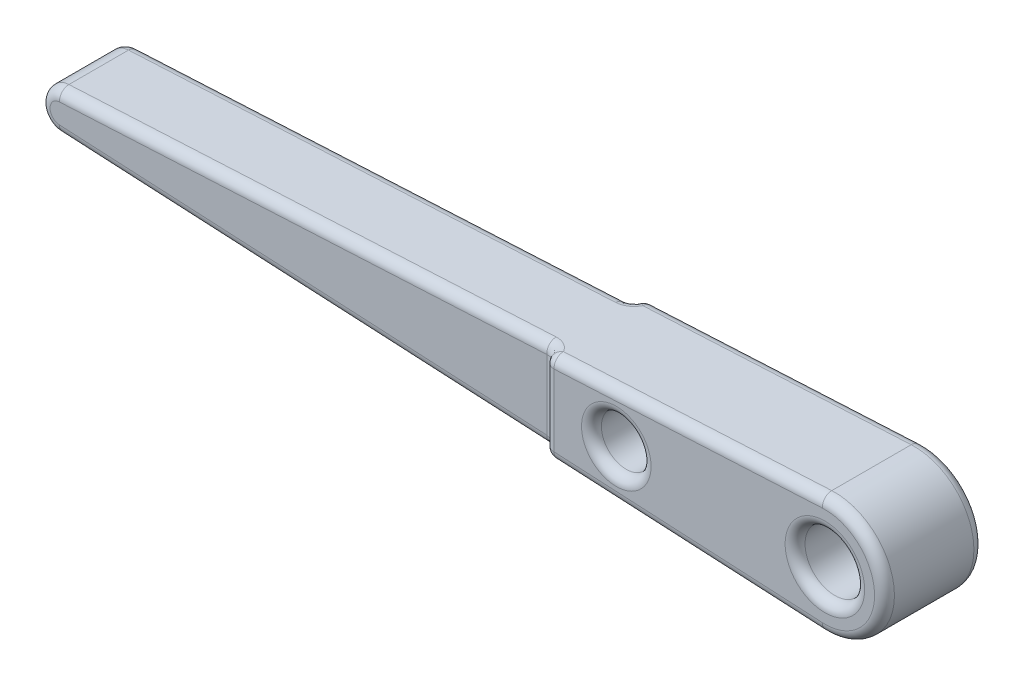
ISO-10303-21;
HEADER;
FILE_DESCRIPTION(('STEP AP214'),'2;1');
FILE_NAME('part.step','',(''),(''),'','','');
FILE_SCHEMA(('AUTOMOTIVE_DESIGN { 1 0 10303 214 1 1 1 1 }'));
ENDSEC;
DATA;
#1=APPLICATION_CONTEXT('core data for automotive mechanical design processes');
#2=APPLICATION_PROTOCOL_DEFINITION('international standard','automotive_design',2000,#1);
#3=PRODUCT_CONTEXT('',#1,'mechanical');
#4=PRODUCT('Part','Part','',(#3));
#5=PRODUCT_RELATED_PRODUCT_CATEGORY('part','',(#4));
#6=PRODUCT_DEFINITION_FORMATION('','',#4);
#7=PRODUCT_DEFINITION_CONTEXT('part definition',#1,'design');
#8=PRODUCT_DEFINITION('design','',#6,#7);
#9=PRODUCT_DEFINITION_SHAPE('','',#8);
#10=(LENGTH_UNIT() NAMED_UNIT(*) SI_UNIT(.MILLI.,.METRE.));
#11=(NAMED_UNIT(*) PLANE_ANGLE_UNIT() SI_UNIT($,.RADIAN.));
#12=(NAMED_UNIT(*) SI_UNIT($,.STERADIAN.) SOLID_ANGLE_UNIT());
#13=UNCERTAINTY_MEASURE_WITH_UNIT(LENGTH_MEASURE(1.E-05),#10,'distance_accuracy_value','');
#14=(GEOMETRIC_REPRESENTATION_CONTEXT(3) GLOBAL_UNCERTAINTY_ASSIGNED_CONTEXT((#13)) GLOBAL_UNIT_ASSIGNED_CONTEXT((#10,
#11,#12)) REPRESENTATION_CONTEXT('',''));
#15=CARTESIAN_POINT('',(0.,0.,0.));
#16=DIRECTION('',(0.,0.,1.));
#17=DIRECTION('',(1.,0.,0.));
#18=AXIS2_PLACEMENT_3D('',#15,#16,#17);
#19=CARTESIAN_POINT('',(-0.153846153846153,-2.9960526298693,2.));
#20=DIRECTION('',(0.0512820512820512,0.998684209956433,0.));
#21=DIRECTION('',(-0.998684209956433,0.0512820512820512,0.));
#22=AXIS2_PLACEMENT_3D('',#19,#20,#21);
#23=PLANE('',#22);
#24=CARTESIAN_POINT('',(-14.525641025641,-2.25806647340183,-2.5));
#25=DIRECTION('',(0.0512820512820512,0.998684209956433,0.));
#26=DIRECTION('',(0.998684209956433,-0.0512820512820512,0.));
#27=AXIS2_PLACEMENT_3D('',#24,#25,#26);
#28=ELLIPSE('',#27,1.00131752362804,1.);
#29=CARTESIAN_POINT('',(-13.6596156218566,-2.30253654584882,-2.));
#30=VERTEX_POINT('',#29);
#31=CARTESIAN_POINT('',(-14.525641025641,-2.25806647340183,-1.5));
#32=VERTEX_POINT('',#31);
#33=EDGE_CURVE('E221',#30,#32,#28,.F.);
#34=ORIENTED_EDGE('',*,*,#33,.F.);
#35=DIRECTION('',(0.998684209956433,-0.0512820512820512,0.));
#36=VECTOR('',#35,1.);
#37=CARTESIAN_POINT('',(-0.153846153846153,-2.9960526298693,-2.));
#38=LINE('',#37,#36);
#39=CARTESIAN_POINT('',(-0.153846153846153,-2.9960526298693,-2.));
#40=VERTEX_POINT('',#39);
#41=EDGE_CURVE('E389',#30,#40,#38,.T.);
#42=ORIENTED_EDGE('',*,*,#41,.T.);
#43=DIRECTION('',(0.,0.,-1.));
#44=VECTOR('',#43,1.);
#45=CARTESIAN_POINT('',(-0.153846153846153,-2.9960526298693,2.));
#46=LINE('',#45,#44);
#47=CARTESIAN_POINT('',(-0.153846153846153,-2.9960526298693,2.));
#48=VERTEX_POINT('',#47);
#49=EDGE_CURVE('E335',#48,#40,#46,.T.);
#50=ORIENTED_EDGE('',*,*,#49,.F.);
#51=DIRECTION('',(0.998684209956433,-0.0512820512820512,0.));
#52=VECTOR('',#51,1.);
#53=CARTESIAN_POINT('',(-13.525641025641,-2.30941608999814,2.));
#54=LINE('',#53,#52);
#55=CARTESIAN_POINT('',(-13.6596156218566,-2.30253654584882,2.));
#56=VERTEX_POINT('',#55);
#57=EDGE_CURVE('E398',#48,#56,#54,.F.);
#58=ORIENTED_EDGE('',*,*,#57,.T.);
#59=CARTESIAN_POINT('',(-14.525641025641,-2.25806647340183,2.5));
#60=DIRECTION('',(0.0512820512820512,0.998684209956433,0.));
#61=DIRECTION('',(-0.998684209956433,0.0512820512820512,0.));
#62=AXIS2_PLACEMENT_3D('',#59,#60,#61);
#63=ELLIPSE('',#62,1.00131752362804,1.);
#64=CARTESIAN_POINT('',(-14.525641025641,-2.25806647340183,1.5));
#65=VERTEX_POINT('',#64);
#66=EDGE_CURVE('E218',#65,#56,#63,.F.);
#67=ORIENTED_EDGE('',*,*,#66,.F.);
#68=DIRECTION('',(0.998684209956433,-0.0512820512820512,0.));
#69=VECTOR('',#68,1.);
#70=CARTESIAN_POINT('',(-39.0512820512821,-0.998684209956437,1.5));
#71=LINE('',#70,#69);
#72=CARTESIAN_POINT('',(-39.0512820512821,-0.998684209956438,1.5));
#73=VERTEX_POINT('',#72);
#74=EDGE_CURVE('E216',#65,#73,#71,.F.);
#75=ORIENTED_EDGE('',*,*,#74,.T.);
#76=DIRECTION('',(0.,0.,-1.));
#77=VECTOR('',#76,1.);
#78=CARTESIAN_POINT('',(-39.0512820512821,-0.998684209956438,2.));
#79=LINE('',#78,#77);
#80=CARTESIAN_POINT('',(-39.0512820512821,-0.998684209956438,-1.5));
#81=VERTEX_POINT('',#80);
#82=EDGE_CURVE('E168',#73,#81,#79,.T.);
#83=ORIENTED_EDGE('',*,*,#82,.T.);
#84=DIRECTION('',(0.998684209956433,-0.0512820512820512,0.));
#85=VECTOR('',#84,1.);
#86=CARTESIAN_POINT('',(-0.153846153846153,-2.9960526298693,-1.5));
#87=LINE('',#86,#85);
#88=EDGE_CURVE('E223',#81,#32,#87,.T.);
#89=ORIENTED_EDGE('',*,*,#88,.T.);
#90=EDGE_LOOP('',(#34,#42,#50,#58,#67,#75,#83,#89));
#91=FACE_BOUND('',#90,.T.);
#92=ADVANCED_FACE('F33',(#91),#23,.F.);
#93=CARTESIAN_POINT('',(-0.153846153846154,2.9960526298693,2.));
#94=DIRECTION('',(0.0512820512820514,-0.998684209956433,0.));
#95=DIRECTION('',(0.998684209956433,0.0512820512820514,0.));
#96=AXIS2_PLACEMENT_3D('',#93,#94,#95);
#97=PLANE('',#96);
#98=DIRECTION('',(0.,0.,-1.));
#99=VECTOR('',#98,1.);
#100=CARTESIAN_POINT('',(-0.153846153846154,2.9960526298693,2.));
#101=LINE('',#100,#99);
#102=CARTESIAN_POINT('',(-0.153846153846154,2.9960526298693,2.));
#103=VERTEX_POINT('',#102);
#104=CARTESIAN_POINT('',(-0.153846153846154,2.9960526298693,-2.));
#105=VERTEX_POINT('',#104);
#106=EDGE_CURVE('E184',#103,#105,#101,.T.);
#107=ORIENTED_EDGE('',*,*,#106,.T.);
#108=DIRECTION('',(-0.998684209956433,-0.0512820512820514,0.));
#109=VECTOR('',#108,1.);
#110=CARTESIAN_POINT('',(-0.153846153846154,2.9960526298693,-2.));
#111=LINE('',#110,#109);
#112=CARTESIAN_POINT('',(-13.6596156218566,2.30253654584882,-2.));
#113=VERTEX_POINT('',#112);
#114=EDGE_CURVE('E11',#105,#113,#111,.T.);
#115=ORIENTED_EDGE('',*,*,#114,.T.);
#116=CARTESIAN_POINT('',(-14.525641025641,2.25806647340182,-2.5));
#117=DIRECTION('',(0.0512820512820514,-0.998684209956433,0.));
#118=DIRECTION('',(-0.998684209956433,-0.0512820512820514,0.));
#119=AXIS2_PLACEMENT_3D('',#116,#117,#118);
#120=ELLIPSE('',#119,1.00131752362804,1.);
#121=CARTESIAN_POINT('',(-14.525641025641,2.25806647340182,-1.5));
#122=VERTEX_POINT('',#121);
#123=EDGE_CURVE('E202',#122,#113,#120,.F.);
#124=ORIENTED_EDGE('',*,*,#123,.F.);
#125=DIRECTION('',(-0.998684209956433,-0.0512820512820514,0.));
#126=VECTOR('',#125,1.);
#127=CARTESIAN_POINT('',(-0.153846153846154,2.9960526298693,-1.5));
#128=LINE('',#127,#126);
#129=CARTESIAN_POINT('',(-39.0512820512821,0.998684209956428,-1.5));
#130=VERTEX_POINT('',#129);
#131=EDGE_CURVE('E183',#122,#130,#128,.T.);
#132=ORIENTED_EDGE('',*,*,#131,.T.);
#133=DIRECTION('',(0.,0.,-1.));
#134=VECTOR('',#133,1.);
#135=CARTESIAN_POINT('',(-39.0512820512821,0.998684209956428,2.));
#136=LINE('',#135,#134);
#137=CARTESIAN_POINT('',(-39.0512820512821,0.998684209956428,1.5));
#138=VERTEX_POINT('',#137);
#139=EDGE_CURVE('E165',#138,#130,#136,.T.);
#140=ORIENTED_EDGE('',*,*,#139,.F.);
#141=DIRECTION('',(-0.998684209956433,-0.0512820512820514,0.));
#142=VECTOR('',#141,1.);
#143=CARTESIAN_POINT('',(-14.,2.28505793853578,1.5));
#144=LINE('',#143,#142);
#145=CARTESIAN_POINT('',(-14.525641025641,2.25806647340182,1.5));
#146=VERTEX_POINT('',#145);
#147=EDGE_CURVE('E180',#138,#146,#144,.F.);
#148=ORIENTED_EDGE('',*,*,#147,.T.);
#149=CARTESIAN_POINT('',(-14.525641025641,2.25806647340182,2.5));
#150=DIRECTION('',(0.0512820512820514,-0.998684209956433,0.));
#151=DIRECTION('',(0.998684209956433,0.0512820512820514,0.));
#152=AXIS2_PLACEMENT_3D('',#149,#150,#151);
#153=ELLIPSE('',#152,1.00131752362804,1.);
#154=CARTESIAN_POINT('',(-13.6596156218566,2.30253654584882,2.));
#155=VERTEX_POINT('',#154);
#156=EDGE_CURVE('E200',#155,#146,#153,.F.);
#157=ORIENTED_EDGE('',*,*,#156,.F.);
#158=DIRECTION('',(-0.998684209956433,-0.0512820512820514,0.));
#159=VECTOR('',#158,1.);
#160=CARTESIAN_POINT('',(-0.153846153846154,2.9960526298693,2.));
#161=LINE('',#160,#159);
#162=EDGE_CURVE('E42',#155,#103,#161,.F.);
#163=ORIENTED_EDGE('',*,*,#162,.T.);
#164=EDGE_LOOP('',(#107,#115,#124,#132,#140,#148,#157,#163));
#165=FACE_BOUND('',#164,.T.);
#166=ADVANCED_FACE('F178',(#165),#97,.F.);
#167=CARTESIAN_POINT('',(0.,0.,2.));
#168=DIRECTION('',(0.,0.,1.));
#169=DIRECTION('',(1.,0.,0.));
#170=AXIS2_PLACEMENT_3D('',#167,#168,#169);
#171=PLANE('',#170);
#172=DIRECTION('',(-0.998684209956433,-0.0512820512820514,0.));
#173=VECTOR('',#172,1.);
#174=CARTESIAN_POINT('',(-39.025641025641,0.499342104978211,2.));
#175=LINE('',#174,#173);
#176=CARTESIAN_POINT('',(-14.5,1.75872436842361,2.));
#177=VERTEX_POINT('',#176);
#178=CARTESIAN_POINT('',(-39.025641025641,0.499342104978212,2.));
#179=VERTEX_POINT('',#178);
#180=EDGE_CURVE('E252',#177,#179,#175,.T.);
#181=ORIENTED_EDGE('',*,*,#180,.T.);
#182=CARTESIAN_POINT('',(-39.,0.,2.));
#183=DIRECTION('',(0.,0.,1.));
#184=DIRECTION('',(1.,0.,0.));
#185=AXIS2_PLACEMENT_3D('',#182,#183,#184);
#186=CIRCLE('',#185,0.5);
#187=CARTESIAN_POINT('',(-39.025641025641,-0.499342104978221,2.));
#188=VERTEX_POINT('',#187);
#189=EDGE_CURVE('E191',#179,#188,#186,.T.);
#190=ORIENTED_EDGE('',*,*,#189,.T.);
#191=DIRECTION('',(0.998684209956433,-0.0512820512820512,0.));
#192=VECTOR('',#191,1.);
#193=CARTESIAN_POINT('',(-13.974358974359,-1.78571583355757,2.));
#194=LINE('',#193,#192);
#195=CARTESIAN_POINT('',(-14.5,-1.75872436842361,2.));
#196=VERTEX_POINT('',#195);
#197=EDGE_CURVE('E248',#188,#196,#194,.T.);
#198=ORIENTED_EDGE('',*,*,#197,.T.);
#199=DIRECTION('',(0.,1.,0.));
#200=VECTOR('',#199,1.);
#201=CARTESIAN_POINT('',(-14.5,0.,2.));
#202=LINE('',#201,#200);
#203=EDGE_CURVE('E250',#196,#177,#202,.T.);
#204=ORIENTED_EDGE('',*,*,#203,.T.);
#205=EDGE_LOOP('',(#181,#190,#198,#204));
#206=FACE_BOUND('',#205,.T.);
#207=ADVANCED_FACE('F281',(#206),#171,.T.);
#208=CARTESIAN_POINT('',(0.,0.,-2.));
#209=DIRECTION('',(0.,0.,1.));
#210=DIRECTION('',(1.,0.,0.));
#211=AXIS2_PLACEMENT_3D('',#208,#209,#210);
#212=PLANE('',#211);
#213=CARTESIAN_POINT('',(-39.,0.,-2.));
#214=DIRECTION('',(0.,0.,1.));
#215=DIRECTION('',(1.,0.,0.));
#216=AXIS2_PLACEMENT_3D('',#213,#214,#215);
#217=CIRCLE('',#216,0.5);
#218=CARTESIAN_POINT('',(-39.025641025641,-0.499342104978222,-2.));
#219=VERTEX_POINT('',#218);
#220=CARTESIAN_POINT('',(-39.025641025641,0.499342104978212,-2.));
#221=VERTEX_POINT('',#220);
#222=EDGE_CURVE('E243',#219,#221,#217,.F.);
#223=ORIENTED_EDGE('',*,*,#222,.T.);
#224=DIRECTION('',(-0.998684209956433,-0.0512820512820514,0.));
#225=VECTOR('',#224,1.);
#226=CARTESIAN_POINT('',(-0.128205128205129,2.49671052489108,-2.));
#227=LINE('',#226,#225);
#228=CARTESIAN_POINT('',(-14.5,1.75872436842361,-2.));
#229=VERTEX_POINT('',#228);
#230=EDGE_CURVE('E173',#221,#229,#227,.F.);
#231=ORIENTED_EDGE('',*,*,#230,.T.);
#232=DIRECTION('',(0.,1.,0.));
#233=VECTOR('',#232,1.);
#234=CARTESIAN_POINT('',(-14.5,-2.28505793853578,-2.));
#235=LINE('',#234,#233);
#236=CARTESIAN_POINT('',(-14.5,-1.75872436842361,-2.));
#237=VERTEX_POINT('',#236);
#238=EDGE_CURVE('E238',#229,#237,#235,.F.);
#239=ORIENTED_EDGE('',*,*,#238,.T.);
#240=DIRECTION('',(0.998684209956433,-0.0512820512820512,0.));
#241=VECTOR('',#240,1.);
#242=CARTESIAN_POINT('',(-0.128205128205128,-2.49671052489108,-2.));
#243=LINE('',#242,#241);
#244=EDGE_CURVE('E241',#237,#219,#243,.F.);
#245=ORIENTED_EDGE('',*,*,#244,.T.);
#246=EDGE_LOOP('',(#223,#231,#239,#245));
#247=FACE_BOUND('',#246,.T.);
#248=ADVANCED_FACE('F319',(#247),#212,.F.);
#249=CARTESIAN_POINT('',(0.,0.,2.));
#250=DIRECTION('',(0.,0.,-1.));
#251=DIRECTION('',(-1.,0.,0.));
#252=AXIS2_PLACEMENT_3D('',#249,#250,#251);
#253=CYLINDRICAL_SURFACE('',#252,3.);
#254=ORIENTED_EDGE('',*,*,#49,.T.);
#255=CARTESIAN_POINT('',(0.,0.,-2.));
#256=DIRECTION('',(0.,0.,1.));
#257=DIRECTION('',(1.,0.,0.));
#258=AXIS2_PLACEMENT_3D('',#255,#256,#257);
#259=CIRCLE('',#258,3.);
#260=EDGE_CURVE('E425',#40,#105,#259,.T.);
#261=ORIENTED_EDGE('',*,*,#260,.T.);
#262=ORIENTED_EDGE('',*,*,#106,.F.);
#263=CARTESIAN_POINT('',(0.,0.,2.));
#264=DIRECTION('',(0.,0.,1.));
#265=DIRECTION('',(1.,0.,0.));
#266=AXIS2_PLACEMENT_3D('',#263,#264,#265);
#267=CIRCLE('',#266,3.);
#268=EDGE_CURVE('E255',#103,#48,#267,.F.);
#269=ORIENTED_EDGE('',*,*,#268,.T.);
#270=EDGE_LOOP('',(#254,#261,#262,#269));
#271=FACE_BOUND('',#270,.T.);
#272=ADVANCED_FACE('F275',(#271),#253,.T.);
#273=CARTESIAN_POINT('',(-39.,0.,2.));
#274=DIRECTION('',(0.,0.,-1.));
#275=DIRECTION('',(-1.,0.,0.));
#276=AXIS2_PLACEMENT_3D('',#273,#274,#275);
#277=CYLINDRICAL_SURFACE('',#276,1.);
#278=ORIENTED_EDGE('',*,*,#139,.T.);
#279=CARTESIAN_POINT('',(-39.,0.,-1.5));
#280=DIRECTION('',(0.,0.,1.));
#281=DIRECTION('',(1.,0.,0.));
#282=AXIS2_PLACEMENT_3D('',#279,#280,#281);
#283=CIRCLE('',#282,1.);
#284=EDGE_CURVE('E172',#130,#81,#283,.T.);
#285=ORIENTED_EDGE('',*,*,#284,.T.);
#286=ORIENTED_EDGE('',*,*,#82,.F.);
#287=CARTESIAN_POINT('',(-39.,0.,1.5));
#288=DIRECTION('',(0.,0.,1.));
#289=DIRECTION('',(1.,0.,0.));
#290=AXIS2_PLACEMENT_3D('',#287,#288,#289);
#291=CIRCLE('',#290,1.);
#292=EDGE_CURVE('E162',#73,#138,#291,.F.);
#293=ORIENTED_EDGE('',*,*,#292,.T.);
#294=EDGE_LOOP('',(#278,#285,#286,#293));
#295=FACE_BOUND('',#294,.T.);
#296=ADVANCED_FACE('F164',(#295),#277,.T.);
#297=CARTESIAN_POINT('',(0.,0.,-2.5));
#298=DIRECTION('',(0.,0.,1.));
#299=DIRECTION('',(1.,0.,0.));
#300=AXIS2_PLACEMENT_3D('',#297,#298,#299);
#301=PLANE('',#300);
#302=DIRECTION('',(-0.998684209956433,-0.0512820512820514,0.));
#303=VECTOR('',#302,1.);
#304=CARTESIAN_POINT('',(-0.128205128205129,2.49671052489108,-2.5));
#305=LINE('',#304,#303);
#306=CARTESIAN_POINT('',(-13.6339745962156,1.8031944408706,-2.5));
#307=VERTEX_POINT('',#306);
#308=CARTESIAN_POINT('',(-0.128205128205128,2.49671052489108,-2.5));
#309=VERTEX_POINT('',#308);
#310=EDGE_CURVE('E448',#307,#309,#305,.F.);
#311=ORIENTED_EDGE('',*,*,#310,.T.);
#312=CARTESIAN_POINT('',(0.,0.,-2.5));
#313=DIRECTION('',(0.,0.,1.));
#314=DIRECTION('',(1.,0.,0.));
#315=AXIS2_PLACEMENT_3D('',#312,#313,#314);
#316=CIRCLE('',#315,2.5);
#317=CARTESIAN_POINT('',(-0.128205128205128,-2.49671052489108,-2.5));
#318=VERTEX_POINT('',#317);
#319=EDGE_CURVE('E442',#309,#318,#316,.F.);
#320=ORIENTED_EDGE('',*,*,#319,.T.);
#321=DIRECTION('',(0.998684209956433,-0.0512820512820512,0.));
#322=VECTOR('',#321,1.);
#323=CARTESIAN_POINT('',(-0.128205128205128,-2.49671052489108,-2.5));
#324=LINE('',#323,#322);
#325=CARTESIAN_POINT('',(-13.6339745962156,-1.8031944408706,-2.5));
#326=VERTEX_POINT('',#325);
#327=EDGE_CURVE('E387',#318,#326,#324,.F.);
#328=ORIENTED_EDGE('',*,*,#327,.T.);
#329=DIRECTION('',(0.,-1.,0.));
#330=VECTOR('',#329,1.);
#331=CARTESIAN_POINT('',(-13.6339745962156,0.,-2.5));
#332=LINE('',#331,#330);
#333=EDGE_CURVE('E446',#326,#307,#332,.F.);
#334=ORIENTED_EDGE('',*,*,#333,.T.);
#335=EDGE_LOOP('',(#311,#320,#328,#334));
#336=FACE_BOUND('',#335,.T.);
#337=CARTESIAN_POINT('',(0.,0.,-2.5));
#338=DIRECTION('',(0.,0.,1.));
#339=DIRECTION('',(1.,0.,0.));
#340=AXIS2_PLACEMENT_3D('',#337,#338,#339);
#341=CIRCLE('',#340,2.);
#342=CARTESIAN_POINT('',(2.,0.,-2.5));
#343=VERTEX_POINT('',#342);
#344=EDGE_CURVE('E204',#343,#343,#341,.T.);
#345=ORIENTED_EDGE('',*,*,#344,.T.);
#346=EDGE_LOOP('',(#345));
#347=FACE_BOUND('',#346,.T.);
#348=CARTESIAN_POINT('',(-10.5,0.,-2.5));
#349=DIRECTION('',(0.,0.,1.));
#350=DIRECTION('',(1.,0.,0.));
#351=AXIS2_PLACEMENT_3D('',#348,#349,#350);
#352=CIRCLE('',#351,1.75);
#353=CARTESIAN_POINT('',(-8.75,0.,-2.5));
#354=VERTEX_POINT('',#353);
#355=EDGE_CURVE('E426',#354,#354,#352,.T.);
#356=ORIENTED_EDGE('',*,*,#355,.T.);
#357=EDGE_LOOP('',(#356));
#358=FACE_BOUND('',#357,.T.);
#359=ADVANCED_FACE('F451',(#336,#347,#358),#301,.F.);
#360=CARTESIAN_POINT('',(0.,0.,2.));
#361=DIRECTION('',(0.,0.,-1.));
#362=DIRECTION('',(-1.,0.,0.));
#363=AXIS2_PLACEMENT_3D('',#360,#361,#362);
#364=CYLINDRICAL_SURFACE('',#363,1.5);
#365=CARTESIAN_POINT('',(0.,0.,2.));
#366=DIRECTION('',(0.,0.,1.));
#367=DIRECTION('',(1.,0.,0.));
#368=AXIS2_PLACEMENT_3D('',#365,#366,#367);
#369=CIRCLE('',#368,1.5);
#370=CARTESIAN_POINT('',(1.5,0.,2.));
#371=VERTEX_POINT('',#370);
#372=EDGE_CURVE('E229',#371,#371,#369,.T.);
#373=ORIENTED_EDGE('',*,*,#372,.T.);
#374=EDGE_LOOP('',(#373));
#375=FACE_BOUND('',#374,.T.);
#376=CARTESIAN_POINT('',(0.,0.,-2.));
#377=DIRECTION('',(0.,0.,1.));
#378=DIRECTION('',(1.,0.,0.));
#379=AXIS2_PLACEMENT_3D('',#376,#377,#378);
#380=CIRCLE('',#379,1.5);
#381=CARTESIAN_POINT('',(1.5,0.,-2.));
#382=VERTEX_POINT('',#381);
#383=EDGE_CURVE('E226',#382,#382,#380,.F.);
#384=ORIENTED_EDGE('',*,*,#383,.T.);
#385=EDGE_LOOP('',(#384));
#386=FACE_BOUND('',#385,.T.);
#387=ADVANCED_FACE('F494',(#375,#386),#364,.F.);
#388=CARTESIAN_POINT('',(-10.5,0.,2.));
#389=DIRECTION('',(0.,0.,-1.));
#390=DIRECTION('',(-1.,0.,0.));
#391=AXIS2_PLACEMENT_3D('',#388,#389,#390);
#392=CYLINDRICAL_SURFACE('',#391,1.25);
#393=CARTESIAN_POINT('',(-10.5,0.,2.));
#394=DIRECTION('',(0.,0.,1.));
#395=DIRECTION('',(1.,0.,0.));
#396=AXIS2_PLACEMENT_3D('',#393,#394,#395);
#397=CIRCLE('',#396,1.25);
#398=CARTESIAN_POINT('',(-9.25,0.,2.));
#399=VERTEX_POINT('',#398);
#400=EDGE_CURVE('E235',#399,#399,#397,.T.);
#401=ORIENTED_EDGE('',*,*,#400,.T.);
#402=EDGE_LOOP('',(#401));
#403=FACE_BOUND('',#402,.T.);
#404=CARTESIAN_POINT('',(-10.5,0.,-2.));
#405=DIRECTION('',(0.,0.,1.));
#406=DIRECTION('',(1.,0.,0.));
#407=AXIS2_PLACEMENT_3D('',#404,#405,#406);
#408=CIRCLE('',#407,1.25);
#409=CARTESIAN_POINT('',(-9.25,0.,-2.));
#410=VERTEX_POINT('',#409);
#411=EDGE_CURVE('E232',#410,#410,#408,.F.);
#412=ORIENTED_EDGE('',*,*,#411,.T.);
#413=EDGE_LOOP('',(#412));
#414=FACE_BOUND('',#413,.T.);
#415=ADVANCED_FACE('F497',(#403,#414),#392,.F.);
#416=CARTESIAN_POINT('',(0.,0.,2.5));
#417=DIRECTION('',(0.,0.,1.));
#418=DIRECTION('',(1.,0.,0.));
#419=AXIS2_PLACEMENT_3D('',#416,#417,#418);
#420=PLANE('',#419);
#421=DIRECTION('',(0.998684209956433,-0.0512820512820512,0.));
#422=VECTOR('',#421,1.);
#423=CARTESIAN_POINT('',(-0.128205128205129,-2.49671052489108,2.5));
#424=LINE('',#423,#422);
#425=CARTESIAN_POINT('',(-13.6339745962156,-1.8031944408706,2.5));
#426=VERTEX_POINT('',#425);
#427=CARTESIAN_POINT('',(-0.128205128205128,-2.49671052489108,2.5));
#428=VERTEX_POINT('',#427);
#429=EDGE_CURVE('E407',#426,#428,#424,.T.);
#430=ORIENTED_EDGE('',*,*,#429,.T.);
#431=CARTESIAN_POINT('',(0.,0.,2.5));
#432=DIRECTION('',(0.,0.,1.));
#433=DIRECTION('',(1.,0.,0.));
#434=AXIS2_PLACEMENT_3D('',#431,#432,#433);
#435=CIRCLE('',#434,2.5);
#436=CARTESIAN_POINT('',(-0.128205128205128,2.49671052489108,2.5));
#437=VERTEX_POINT('',#436);
#438=EDGE_CURVE('E409',#428,#437,#435,.T.);
#439=ORIENTED_EDGE('',*,*,#438,.T.);
#440=DIRECTION('',(-0.998684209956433,-0.0512820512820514,0.));
#441=VECTOR('',#440,1.);
#442=CARTESIAN_POINT('',(-13.5,1.81007398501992,2.5));
#443=LINE('',#442,#441);
#444=CARTESIAN_POINT('',(-13.6339745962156,1.8031944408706,2.5));
#445=VERTEX_POINT('',#444);
#446=EDGE_CURVE('E403',#437,#445,#443,.T.);
#447=ORIENTED_EDGE('',*,*,#446,.T.);
#448=DIRECTION('',(0.,-1.,0.));
#449=VECTOR('',#448,1.);
#450=CARTESIAN_POINT('',(-13.6339745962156,-1.81007398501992,2.5));
#451=LINE('',#450,#449);
#452=EDGE_CURVE('E405',#445,#426,#451,.T.);
#453=ORIENTED_EDGE('',*,*,#452,.T.);
#454=EDGE_LOOP('',(#430,#439,#447,#453));
#455=FACE_BOUND('',#454,.T.);
#456=CARTESIAN_POINT('',(0.,0.,2.5));
#457=DIRECTION('',(0.,0.,1.));
#458=DIRECTION('',(1.,0.,0.));
#459=AXIS2_PLACEMENT_3D('',#456,#457,#458);
#460=CIRCLE('',#459,2.);
#461=CARTESIAN_POINT('',(2.,0.,2.5));
#462=VERTEX_POINT('',#461);
#463=EDGE_CURVE('E213',#462,#462,#460,.F.);
#464=ORIENTED_EDGE('',*,*,#463,.T.);
#465=EDGE_LOOP('',(#464));
#466=FACE_BOUND('',#465,.T.);
#467=CARTESIAN_POINT('',(-10.5,0.,2.5));
#468=DIRECTION('',(0.,0.,1.));
#469=DIRECTION('',(1.,0.,0.));
#470=AXIS2_PLACEMENT_3D('',#467,#468,#469);
#471=CIRCLE('',#470,1.75);
#472=CARTESIAN_POINT('',(-8.75,0.,2.5));
#473=VERTEX_POINT('',#472);
#474=EDGE_CURVE('E210',#473,#473,#471,.F.);
#475=ORIENTED_EDGE('',*,*,#474,.T.);
#476=EDGE_LOOP('',(#475));
#477=FACE_BOUND('',#476,.T.);
#478=ADVANCED_FACE('F437',(#455,#466,#477),#420,.T.);
#479=CARTESIAN_POINT('',(-0.128205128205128,-2.49671052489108,-1.5));
#480=DIRECTION('',(0.998684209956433,-0.0512820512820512,0.));
#481=DIRECTION('',(0.0512820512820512,0.998684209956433,0.));
#482=AXIS2_PLACEMENT_3D('',#479,#480,#481);
#483=CYLINDRICAL_SURFACE('',#482,0.5);
#484=CARTESIAN_POINT('',(-14.5,-1.75872436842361,-1.5));
#485=DIRECTION('',(0.998684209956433,-0.0512820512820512,0.));
#486=DIRECTION('',(0.0512820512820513,0.998684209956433,0.));
#487=AXIS2_PLACEMENT_3D('',#484,#485,#486);
#488=CIRCLE('',#487,0.5);
#489=EDGE_CURVE('E332',#32,#237,#488,.T.);
#490=ORIENTED_EDGE('',*,*,#489,.F.);
#491=ORIENTED_EDGE('',*,*,#88,.F.);
#492=CARTESIAN_POINT('',(-39.025641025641,-0.499342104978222,-1.5));
#493=DIRECTION('',(-0.998684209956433,0.0512820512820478,0.));
#494=DIRECTION('',(-0.0512820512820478,-0.998684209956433,0.));
#495=AXIS2_PLACEMENT_3D('',#492,#493,#494);
#496=CIRCLE('',#495,0.5);
#497=EDGE_CURVE('E333',#219,#81,#496,.T.);
#498=ORIENTED_EDGE('',*,*,#497,.F.);
#499=ORIENTED_EDGE('',*,*,#244,.F.);
#500=EDGE_LOOP('',(#490,#491,#498,#499));
#501=FACE_BOUND('',#500,.T.);
#502=ADVANCED_FACE('F291',(#501),#483,.T.);
#503=CARTESIAN_POINT('',(-39.,0.,-1.5));
#504=DIRECTION('',(0.,0.,1.));
#505=DIRECTION('',(1.,0.,0.));
#506=AXIS2_PLACEMENT_3D('',#503,#504,#505);
#507=TOROIDAL_SURFACE('',#506,0.5,0.5);
#508=ORIENTED_EDGE('',*,*,#497,.T.);
#509=ORIENTED_EDGE('',*,*,#284,.F.);
#510=CARTESIAN_POINT('',(-39.025641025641,0.499342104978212,-1.5));
#511=DIRECTION('',(0.998684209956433,0.0512820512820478,0.));
#512=DIRECTION('',(-0.0512820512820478,0.998684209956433,0.));
#513=AXIS2_PLACEMENT_3D('',#510,#511,#512);
#514=CIRCLE('',#513,0.5);
#515=EDGE_CURVE('E471',#221,#130,#514,.T.);
#516=ORIENTED_EDGE('',*,*,#515,.F.);
#517=ORIENTED_EDGE('',*,*,#222,.F.);
#518=EDGE_LOOP('',(#508,#509,#516,#517));
#519=FACE_BOUND('',#518,.T.);
#520=ADVANCED_FACE('F327',(#519),#507,.T.);
#521=CARTESIAN_POINT('',(-14.,-1.81007398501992,-2.5));
#522=CARTESIAN_POINT('',(-14.,-2.28505793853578,-2.5));
#523=CARTESIAN_POINT('',(-13.525641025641,-2.30941608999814,-2.5));
#524=CARTESIAN_POINT('',(-14.,-1.81007398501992,-2.52181674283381));
#525=CARTESIAN_POINT('',(-14.,-2.28505793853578,-2.52288093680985));
#526=CARTESIAN_POINT('',(-13.525641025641,-2.30941608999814,-2.54363348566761));
#527=CARTESIAN_POINT('',(-14.0014299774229,-1.8099271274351,-2.54363348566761));
#528=CARTESIAN_POINT('',(-14.0015704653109,-2.28497729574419,-2.54576506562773));
#529=CARTESIAN_POINT('',(-13.5285009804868,-2.30926923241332,-2.58726697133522));
#530=CARTESIAN_POINT('',(-14.0071252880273,-1.80934222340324,-2.58689366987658));
#531=CARTESIAN_POINT('',(-14.0078171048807,-2.28465653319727,-2.59108372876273));
#532=CARTESIAN_POINT('',(-13.5398916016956,-2.30868432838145,-2.67378733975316));
#533=CARTESIAN_POINT('',(-14.011390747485,-1.80890416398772,-2.60833709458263));
#534=CARTESIAN_POINT('',(-14.0124951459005,-2.28441631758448,-2.61352439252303));
#535=CARTESIAN_POINT('',(-13.548422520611,-2.30824626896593,-2.71667418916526));
#536=CARTESIAN_POINT('',(-14.0226839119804,-1.80774436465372,-2.65048376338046));
#537=CARTESIAN_POINT('',(-14.0248560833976,-2.28378158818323,-2.65752411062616));
#538=CARTESIAN_POINT('',(-13.5710088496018,-2.30708646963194,-2.80096752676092));
#539=CARTESIAN_POINT('',(-14.0297118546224,-1.80702260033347,-2.67118694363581));
#540=CARTESIAN_POINT('',(-14.032542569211,-2.28338689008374,-2.67908855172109));
#541=CARTESIAN_POINT('',(-13.5850647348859,-2.30636470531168,-2.84237388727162));
#542=CARTESIAN_POINT('',(-14.0464096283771,-1.80530775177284,-2.71149894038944));
#543=CARTESIAN_POINT('',(-14.0507568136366,-2.28245159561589,-2.72092531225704));
#544=CARTESIAN_POINT('',(-13.6184602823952,-2.30464985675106,-2.92299788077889));
#545=CARTESIAN_POINT('',(-14.0560797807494,-1.80431463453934,-2.73110762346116));
#546=CARTESIAN_POINT('',(-14.0612896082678,-2.28191074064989,-2.741201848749));
#547=CARTESIAN_POINT('',(-13.6378005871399,-2.30365673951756,-2.96221524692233));
#548=CARTESIAN_POINT('',(-14.0778964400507,-1.80207408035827,-2.76889519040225));
#549=CARTESIAN_POINT('',(-14.0849747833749,-2.28069451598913,-2.78008339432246));
#550=CARTESIAN_POINT('',(-13.6814339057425,-2.30141618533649,-3.03779038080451));
#551=CARTESIAN_POINT('',(-14.0900433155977,-1.80082660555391,-2.78707386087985));
#552=CARTESIAN_POINT('',(-14.0981332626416,-2.28001883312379,-2.79869111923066));
#553=CARTESIAN_POINT('',(-13.7057276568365,-2.30016871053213,-3.07414772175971));
#554=CARTESIAN_POINT('',(-14.1166055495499,-1.79809868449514,-2.82169044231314));
#555=CARTESIAN_POINT('',(-14.1267962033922,-2.27854700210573,-2.83389534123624));
#556=CARTESIAN_POINT('',(-13.7588521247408,-2.29744078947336,-3.14338088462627));
#557=CARTESIAN_POINT('',(-14.1310212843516,-1.7966181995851,-2.83812806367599));
#558=CARTESIAN_POINT('',(-14.142307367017,-2.27775050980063,-2.8504928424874));
#559=CARTESIAN_POINT('',(-13.7876835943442,-2.29596030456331,-3.17625612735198));
#560=CARTESIAN_POINT('',(-14.161874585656,-1.79344958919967,-2.86898136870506));
#561=CARTESIAN_POINT('',(-14.1753576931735,-2.27605338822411,-2.88138394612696));
#562=CARTESIAN_POINT('',(-13.8493901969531,-2.29279169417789,-3.23796273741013));
#563=CARTESIAN_POINT('',(-14.1783124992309,-1.79176142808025,-2.88339670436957));
#564=CARTESIAN_POINT('',(-14.1929036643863,-2.27515240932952,-2.89567676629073));
#565=CARTESIAN_POINT('',(-13.8822660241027,-2.29110353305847,-3.26679340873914));
#566=CARTESIAN_POINT('',(-14.2129289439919,-1.78820634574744,-2.90995883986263));
#567=CARTESIAN_POINT('',(-14.2296698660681,-2.27326447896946,-2.92171868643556));
#568=CARTESIAN_POINT('',(-13.9514989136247,-2.28754845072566,-3.31991767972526));
#569=CARTESIAN_POINT('',(-14.2311077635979,-1.78633939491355,-2.9221052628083));
#570=CARTESIAN_POINT('',(-14.2488965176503,-2.27227719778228,-2.93346528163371));
#571=CARTESIAN_POINT('',(-13.9878565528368,-2.28568149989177,-3.3442105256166));
#572=CARTESIAN_POINT('',(-14.2688950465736,-1.78245866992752,-2.9439217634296));
#573=CARTESIAN_POINT('',(-14.2886439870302,-2.27023618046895,-2.95423191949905));
#574=CARTESIAN_POINT('',(-14.0634311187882,-2.28180077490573,-3.38784352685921));
#575=CARTESIAN_POINT('',(-14.2885037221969,-1.78044487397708,-2.9535914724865));
#576=CARTESIAN_POINT('',(-14.30917038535,-2.26918215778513,-2.96324792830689));
#577=CARTESIAN_POINT('',(-14.1026484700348,-2.2797869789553,-3.40718294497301));
#578=CARTESIAN_POINT('',(-14.3288152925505,-1.77630490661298,-2.97028907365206));
#579=CARTESIAN_POINT('',(-14.351120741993,-2.26702802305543,-2.97842989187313));
#580=CARTESIAN_POINT('',(-14.183271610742,-2.27564701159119,-3.44057814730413));
#581=CARTESIAN_POINT('',(-14.3495183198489,-1.77417872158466,-2.97731664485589));
#582=CARTESIAN_POINT('',(-14.3725490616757,-2.26592768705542,-2.98459058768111));
#583=CARTESIAN_POINT('',(-14.2246776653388,-2.27352082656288,-3.45463328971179));
#584=CARTESIAN_POINT('',(-14.3916644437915,-1.76985034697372,-2.98860966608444));
#585=CARTESIAN_POINT('',(-14.4159000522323,-2.26370163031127,-2.99399825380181));
#586=CARTESIAN_POINT('',(-14.3089699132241,-2.26919245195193,-3.47721933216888));
#587=CARTESIAN_POINT('',(-14.4131076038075,-1.76764815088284,-2.99287487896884));
#588=CARTESIAN_POINT('',(-14.4378255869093,-2.26257576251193,-2.99723912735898));
#589=CARTESIAN_POINT('',(-14.3518562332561,-2.26699025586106,-3.48574975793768));
#590=CARTESIAN_POINT('',(-14.4563671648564,-1.76320542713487,-2.99857010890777));
#591=CARTESIAN_POINT('',(-14.4817707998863,-2.26031919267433,-3.00080199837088));
#592=CARTESIAN_POINT('',(-14.4383753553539,-2.26254753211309,-3.49714021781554));
#593=CARTESIAN_POINT('',(-14.4781835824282,-1.76096489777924,-3.));
#594=CARTESIAN_POINT('',(-14.5037916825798,-2.2591884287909,-3.00111749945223));
#595=CARTESIAN_POINT('',(-14.4820081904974,-2.26030700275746,-3.5));
#596=CARTESIAN_POINT('',(-14.5218164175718,-1.75648383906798,-3.));
#597=CARTESIAN_POINT('',(-14.5475393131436,-2.25694200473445,-2.99887999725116));
#598=CARTESIAN_POINT('',(-14.5692738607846,-2.25582594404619,-3.5));
#599=CARTESIAN_POINT('',(-14.5436328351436,-1.75424330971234,-2.99857010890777));
#600=CARTESIAN_POINT('',(-14.5692655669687,-2.25582636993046,-2.99632055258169));
#601=CARTESIAN_POINT('',(-14.6129066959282,-2.25358541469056,-3.49714021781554));
#602=CARTESIAN_POINT('',(-14.5868923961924,-1.74980058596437,-2.99287487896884));
#603=CARTESIAN_POINT('',(-14.6120555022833,-2.25362912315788,-2.98843457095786));
#604=CARTESIAN_POINT('',(-14.6994258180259,-2.24914269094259,-3.48574975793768));
#605=CARTESIAN_POINT('',(-14.6083355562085,-1.7475983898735,-2.98860966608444));
#606=CARTESIAN_POINT('',(-14.6331170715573,-2.25254761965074,-2.98310208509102));
#607=CARTESIAN_POINT('',(-14.742312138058,-2.24694049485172,-3.47721933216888));
#608=CARTESIAN_POINT('',(-14.6504816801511,-1.74327001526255,-2.97731664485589));
#609=CARTESIAN_POINT('',(-14.6742356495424,-2.25043619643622,-2.96981679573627));
#610=CARTESIAN_POINT('',(-14.8266043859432,-2.24261212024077,-3.45463328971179));
#611=CARTESIAN_POINT('',(-14.6711847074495,-1.74114383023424,-2.97028907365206));
#612=CARTESIAN_POINT('',(-14.6942891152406,-2.24940645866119,-2.96185892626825));
#613=CARTESIAN_POINT('',(-14.8680104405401,-2.24048593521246,-3.44057814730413));
#614=CARTESIAN_POINT('',(-14.7114962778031,-1.73700386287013,-2.9535914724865));
#615=CARTESIAN_POINT('',(-14.7330810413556,-2.24741450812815,-2.94350849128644));
#616=CARTESIAN_POINT('',(-14.9486335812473,-2.23634596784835,-3.40718294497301));
#617=CARTESIAN_POINT('',(-14.7311049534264,-1.7349900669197,-2.9439217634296));
#618=CARTESIAN_POINT('',(-14.7518148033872,-2.24645253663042,-2.93311206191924));
#619=CARTESIAN_POINT('',(-14.9878509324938,-2.23433217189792,-3.38784352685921));
#620=CARTESIAN_POINT('',(-14.7688922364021,-1.73110934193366,-2.9221052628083));
#621=CARTESIAN_POINT('',(-14.7876918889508,-2.24461026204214,-2.91010202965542));
#622=CARTESIAN_POINT('',(-15.0634254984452,-2.23045144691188,-3.3442105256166));
#623=CARTESIAN_POINT('',(-14.7870710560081,-1.72924239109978,-2.90995883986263));
#624=CARTESIAN_POINT('',(-14.804829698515,-2.24373024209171,-2.89748599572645));
#625=CARTESIAN_POINT('',(-15.0997831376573,-2.22858449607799,-3.31991767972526));
#626=CARTESIAN_POINT('',(-14.8216875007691,-1.72568730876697,-2.88339670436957));
#627=CARTESIAN_POINT('',(-14.8372763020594,-2.24206412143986,-2.87027923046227));
#628=CARTESIAN_POINT('',(-15.1690160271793,-2.22502941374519,-3.26679340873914));
#629=CARTESIAN_POINT('',(-14.838125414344,-1.72399914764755,-2.86898136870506));
#630=CARTESIAN_POINT('',(-14.8525791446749,-2.24127832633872,-2.85568763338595));
#631=CARTESIAN_POINT('',(-15.201891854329,-2.22334125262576,-3.23796273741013));
#632=CARTESIAN_POINT('',(-14.8689787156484,-1.72083053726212,-2.83812806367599));
#633=CARTESIAN_POINT('',(-14.8811544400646,-2.23981099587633,-2.82479063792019));
#634=CARTESIAN_POINT('',(-15.2635984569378,-2.22017264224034,-3.17625612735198));
#635=CARTESIAN_POINT('',(-14.8833944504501,-1.71935005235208,-2.82169044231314));
#636=CARTESIAN_POINT('',(-14.8944208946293,-2.23912976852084,-2.80848597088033));
#637=CARTESIAN_POINT('',(-15.2924299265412,-2.2186921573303,-3.14338088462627));
#638=CARTESIAN_POINT('',(-14.9099566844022,-1.71662213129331,-2.78707386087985));
#639=CARTESIAN_POINT('',(-14.9187583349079,-2.2378800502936,-2.77443639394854));
#640=CARTESIAN_POINT('',(-15.3455543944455,-2.21596423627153,-3.07414772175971));
#641=CARTESIAN_POINT('',(-14.9221035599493,-1.71537465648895,-2.76889519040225));
#642=CARTESIAN_POINT('',(-14.9298236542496,-2.23731185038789,-2.75669374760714));
#643=CARTESIAN_POINT('',(-15.3698481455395,-2.21471676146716,-3.03779038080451));
#644=CARTESIAN_POINT('',(-14.9439202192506,-1.71313410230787,-2.73110762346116));
#645=CARTESIAN_POINT('',(-14.9496282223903,-2.23629489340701,-2.72004972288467));
#646=CARTESIAN_POINT('',(-15.4134814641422,-2.21247620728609,-2.96221524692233));
#647=CARTESIAN_POINT('',(-14.9535903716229,-1.71214098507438,-2.71149894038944));
#648=CARTESIAN_POINT('',(-14.9583624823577,-2.23584639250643,-2.70115198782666));
#649=CARTESIAN_POINT('',(-15.4328217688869,-2.2114830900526,-2.92299788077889));
#650=CARTESIAN_POINT('',(-14.9702881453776,-1.71042613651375,-2.67118694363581));
#651=CARTESIAN_POINT('',(-14.9734064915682,-2.2350738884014,-2.66248373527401));
#652=CARTESIAN_POINT('',(-15.4662173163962,-2.20976824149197,-2.84237388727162));
#653=CARTESIAN_POINT('',(-14.9773160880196,-1.70970437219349,-2.65048376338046));
#654=CARTESIAN_POINT('',(-14.9797122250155,-2.23475009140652,-2.64271801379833));
#655=CARTESIAN_POINT('',(-15.4802732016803,-2.20904647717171,-2.80096752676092));
#656=CARTESIAN_POINT('',(-14.988609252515,-1.7085445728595,-2.60833709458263));
#657=CARTESIAN_POINT('',(-14.9898305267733,-2.23423052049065,-2.60260186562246));
#658=CARTESIAN_POINT('',(-15.502859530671,-2.20788667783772,-2.71667418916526));
#659=CARTESIAN_POINT('',(-14.9928747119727,-1.70810651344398,-2.58689366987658));
#660=CARTESIAN_POINT('',(-14.9936402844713,-2.23403489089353,-2.58225710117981));
#661=CARTESIAN_POINT('',(-15.5113904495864,-2.2074486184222,-2.67378733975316));
#662=CARTESIAN_POINT('',(-14.9985700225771,-1.70752160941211,-2.54363348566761));
#663=CARTESIAN_POINT('',(-14.9987257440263,-2.23377375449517,-2.54127182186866));
#664=CARTESIAN_POINT('',(-15.5227810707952,-2.20686371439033,-2.58726697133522));
#665=CARTESIAN_POINT('',(-15.,-1.7073747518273,-2.52181674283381));
#666=CARTESIAN_POINT('',(-15.,-2.23370832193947,-2.52063750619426));
#667=CARTESIAN_POINT('',(-15.525641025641,-2.20671685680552,-2.54363348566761));
#668=CARTESIAN_POINT('',(-15.,-1.7073747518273,-2.47818325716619));
#669=CARTESIAN_POINT('',(-15.,-2.23370832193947,-2.47936249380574));
#670=CARTESIAN_POINT('',(-15.525641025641,-2.20671685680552,-2.45636651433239));
#671=CARTESIAN_POINT('',(-14.9985700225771,-1.70752160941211,-2.45636651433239));
#672=CARTESIAN_POINT('',(-14.9987257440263,-2.23377375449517,-2.45872817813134));
#673=CARTESIAN_POINT('',(-15.5227810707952,-2.20686371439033,-2.41273302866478));
#674=CARTESIAN_POINT('',(-14.9928747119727,-1.70810651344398,-2.41310633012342));
#675=CARTESIAN_POINT('',(-14.9936402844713,-2.23403489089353,-2.41774289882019));
#676=CARTESIAN_POINT('',(-15.5113904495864,-2.2074486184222,-2.32621266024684));
#677=CARTESIAN_POINT('',(-14.988609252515,-1.7085445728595,-2.39166290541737));
#678=CARTESIAN_POINT('',(-14.9898305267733,-2.23423052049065,-2.39739813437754));
#679=CARTESIAN_POINT('',(-15.502859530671,-2.20788667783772,-2.28332581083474));
#680=CARTESIAN_POINT('',(-14.9773160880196,-1.70970437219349,-2.34951623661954));
#681=CARTESIAN_POINT('',(-14.9797122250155,-2.23475009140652,-2.35728198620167));
#682=CARTESIAN_POINT('',(-15.4802732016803,-2.20904647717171,-2.19903247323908));
#683=CARTESIAN_POINT('',(-14.9702881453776,-1.71042613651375,-2.32881305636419));
#684=CARTESIAN_POINT('',(-14.9734064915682,-2.2350738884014,-2.33751626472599));
#685=CARTESIAN_POINT('',(-15.4662173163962,-2.20976824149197,-2.15762611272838));
#686=CARTESIAN_POINT('',(-14.9535903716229,-1.71214098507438,-2.28850105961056));
#687=CARTESIAN_POINT('',(-14.9583624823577,-2.23584639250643,-2.29884801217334));
#688=CARTESIAN_POINT('',(-15.4328217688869,-2.2114830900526,-2.07700211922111));
#689=CARTESIAN_POINT('',(-14.9439202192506,-1.71313410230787,-2.26889237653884));
#690=CARTESIAN_POINT('',(-14.9496282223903,-2.23629489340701,-2.27995027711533));
#691=CARTESIAN_POINT('',(-15.4134814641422,-2.21247620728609,-2.03778475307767));
#692=CARTESIAN_POINT('',(-14.9221035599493,-1.71537465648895,-2.23110480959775));
#693=CARTESIAN_POINT('',(-14.9298236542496,-2.23731185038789,-2.24330625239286));
#694=CARTESIAN_POINT('',(-15.3698481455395,-2.21471676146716,-1.96220961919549));
#695=CARTESIAN_POINT('',(-14.9099566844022,-1.71662213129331,-2.21292613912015));
#696=CARTESIAN_POINT('',(-14.9187583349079,-2.2378800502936,-2.22556360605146));
#697=CARTESIAN_POINT('',(-15.3455543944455,-2.21596423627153,-1.92585227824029));
#698=CARTESIAN_POINT('',(-14.8833944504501,-1.71935005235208,-2.17830955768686));
#699=CARTESIAN_POINT('',(-14.8944208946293,-2.23912976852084,-2.19151402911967));
#700=CARTESIAN_POINT('',(-15.2924299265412,-2.2186921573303,-1.85661911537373));
#701=CARTESIAN_POINT('',(-14.8689787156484,-1.72083053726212,-2.16187193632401));
#702=CARTESIAN_POINT('',(-14.8811544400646,-2.23981099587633,-2.17520936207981));
#703=CARTESIAN_POINT('',(-15.2635984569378,-2.22017264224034,-1.82374387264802));
#704=CARTESIAN_POINT('',(-14.838125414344,-1.72399914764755,-2.13101863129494));
#705=CARTESIAN_POINT('',(-14.8525791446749,-2.24127832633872,-2.14431236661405));
#706=CARTESIAN_POINT('',(-15.201891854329,-2.22334125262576,-1.76203726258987));
#707=CARTESIAN_POINT('',(-14.8216875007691,-1.72568730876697,-2.11660329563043));
#708=CARTESIAN_POINT('',(-14.8372763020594,-2.24206412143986,-2.12972076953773));
#709=CARTESIAN_POINT('',(-15.1690160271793,-2.22502941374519,-1.73320659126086));
#710=CARTESIAN_POINT('',(-14.7870710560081,-1.72924239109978,-2.09004116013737));
#711=CARTESIAN_POINT('',(-14.804829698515,-2.24373024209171,-2.10251400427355));
#712=CARTESIAN_POINT('',(-15.0997831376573,-2.22858449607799,-1.68008232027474));
#713=CARTESIAN_POINT('',(-14.7688922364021,-1.73110934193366,-2.0778947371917));
#714=CARTESIAN_POINT('',(-14.7876918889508,-2.24461026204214,-2.08989797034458));
#715=CARTESIAN_POINT('',(-15.0634254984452,-2.23045144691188,-1.6557894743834));
#716=CARTESIAN_POINT('',(-14.7311049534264,-1.7349900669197,-2.0560782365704));
#717=CARTESIAN_POINT('',(-14.7518148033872,-2.24645253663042,-2.06688793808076));
#718=CARTESIAN_POINT('',(-14.9878509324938,-2.23433217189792,-1.61215647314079));
#719=CARTESIAN_POINT('',(-14.7114962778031,-1.73700386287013,-2.0464085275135));
#720=CARTESIAN_POINT('',(-14.7330810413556,-2.24741450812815,-2.05649150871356));
#721=CARTESIAN_POINT('',(-14.9486335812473,-2.23634596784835,-1.59281705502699));
#722=CARTESIAN_POINT('',(-14.6711847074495,-1.74114383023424,-2.02971092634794));
#723=CARTESIAN_POINT('',(-14.6942891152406,-2.24940645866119,-2.03814107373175));
#724=CARTESIAN_POINT('',(-14.8680104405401,-2.24048593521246,-1.55942185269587));
#725=CARTESIAN_POINT('',(-14.6504816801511,-1.74327001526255,-2.02268335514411));
#726=CARTESIAN_POINT('',(-14.6742356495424,-2.25043619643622,-2.03018320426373));
#727=CARTESIAN_POINT('',(-14.8266043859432,-2.24261212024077,-1.54536671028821));
#728=CARTESIAN_POINT('',(-14.6083355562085,-1.7475983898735,-2.01139033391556));
#729=CARTESIAN_POINT('',(-14.6331170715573,-2.25254761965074,-2.01689791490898));
#730=CARTESIAN_POINT('',(-14.742312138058,-2.24694049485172,-1.52278066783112));
#731=CARTESIAN_POINT('',(-14.5868923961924,-1.74980058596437,-2.00712512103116));
#732=CARTESIAN_POINT('',(-14.6120555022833,-2.25362912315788,-2.01156542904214));
#733=CARTESIAN_POINT('',(-14.6994258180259,-2.24914269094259,-1.51425024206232));
#734=CARTESIAN_POINT('',(-14.5436328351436,-1.75424330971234,-2.00142989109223));
#735=CARTESIAN_POINT('',(-14.5692655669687,-2.25582636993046,-2.00367944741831));
#736=CARTESIAN_POINT('',(-14.6129066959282,-2.25358541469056,-1.50285978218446));
#737=CARTESIAN_POINT('',(-14.5218164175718,-1.75648383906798,-2.));
#738=CARTESIAN_POINT('',(-14.5475393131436,-2.25694200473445,-2.00112000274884));
#739=CARTESIAN_POINT('',(-14.5692738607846,-2.25582594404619,-1.5));
#740=CARTESIAN_POINT('',(-14.4781835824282,-1.76096489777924,-2.));
#741=CARTESIAN_POINT('',(-14.5037916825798,-2.2591884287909,-1.99888250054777));
#742=CARTESIAN_POINT('',(-14.4820081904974,-2.26030700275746,-1.5));
#743=CARTESIAN_POINT('',(-14.4563671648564,-1.76320542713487,-2.00142989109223));
#744=CARTESIAN_POINT('',(-14.4817707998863,-2.26031919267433,-1.99919800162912));
#745=CARTESIAN_POINT('',(-14.4383753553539,-2.26254753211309,-1.50285978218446));
#746=CARTESIAN_POINT('',(-14.4131076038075,-1.76764815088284,-2.00712512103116));
#747=CARTESIAN_POINT('',(-14.4378255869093,-2.26257576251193,-2.00276087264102));
#748=CARTESIAN_POINT('',(-14.3518562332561,-2.26699025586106,-1.51425024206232));
#749=CARTESIAN_POINT('',(-14.3916644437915,-1.76985034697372,-2.01139033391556));
#750=CARTESIAN_POINT('',(-14.4159000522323,-2.26370163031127,-2.00600174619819));
#751=CARTESIAN_POINT('',(-14.3089699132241,-2.26919245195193,-1.52278066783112));
#752=CARTESIAN_POINT('',(-14.3495183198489,-1.77417872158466,-2.02268335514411));
#753=CARTESIAN_POINT('',(-14.3725490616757,-2.26592768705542,-2.01540941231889));
#754=CARTESIAN_POINT('',(-14.2246776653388,-2.27352082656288,-1.54536671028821));
#755=CARTESIAN_POINT('',(-14.3288152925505,-1.77630490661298,-2.02971092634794));
#756=CARTESIAN_POINT('',(-14.351120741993,-2.26702802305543,-2.02157010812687));
#757=CARTESIAN_POINT('',(-14.183271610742,-2.27564701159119,-1.55942185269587));
#758=CARTESIAN_POINT('',(-14.2885037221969,-1.78044487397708,-2.0464085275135));
#759=CARTESIAN_POINT('',(-14.30917038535,-2.26918215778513,-2.03675207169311));
#760=CARTESIAN_POINT('',(-14.1026484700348,-2.2797869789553,-1.59281705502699));
#761=CARTESIAN_POINT('',(-14.2688950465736,-1.78245866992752,-2.0560782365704));
#762=CARTESIAN_POINT('',(-14.2886439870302,-2.27023618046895,-2.04576808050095));
#763=CARTESIAN_POINT('',(-14.0634311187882,-2.28180077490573,-1.61215647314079));
#764=CARTESIAN_POINT('',(-14.2311077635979,-1.78633939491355,-2.0778947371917));
#765=CARTESIAN_POINT('',(-14.2488965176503,-2.27227719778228,-2.06653471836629));
#766=CARTESIAN_POINT('',(-13.9878565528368,-2.28568149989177,-1.6557894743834));
#767=CARTESIAN_POINT('',(-14.2129289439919,-1.78820634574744,-2.09004116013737));
#768=CARTESIAN_POINT('',(-14.2296698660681,-2.27326447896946,-2.07828131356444));
#769=CARTESIAN_POINT('',(-13.9514989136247,-2.28754845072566,-1.68008232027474));
#770=CARTESIAN_POINT('',(-14.1783124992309,-1.79176142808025,-2.11660329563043));
#771=CARTESIAN_POINT('',(-14.1929036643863,-2.27515240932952,-2.10432323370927));
#772=CARTESIAN_POINT('',(-13.8822660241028,-2.29110353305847,-1.73320659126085));
#773=CARTESIAN_POINT('',(-14.161874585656,-1.79344958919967,-2.13101863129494));
#774=CARTESIAN_POINT('',(-14.1753576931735,-2.27605338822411,-2.11861605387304));
#775=CARTESIAN_POINT('',(-13.8493901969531,-2.29279169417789,-1.76203726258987));
#776=CARTESIAN_POINT('',(-14.1310212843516,-1.7966181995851,-2.16187193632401));
#777=CARTESIAN_POINT('',(-14.142307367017,-2.27775050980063,-2.1495071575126));
#778=CARTESIAN_POINT('',(-13.7876835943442,-2.29596030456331,-1.82374387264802));
#779=CARTESIAN_POINT('',(-14.1166055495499,-1.79809868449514,-2.17830955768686));
#780=CARTESIAN_POINT('',(-14.1267962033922,-2.27854700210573,-2.16610465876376));
#781=CARTESIAN_POINT('',(-13.7588521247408,-2.29744078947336,-1.85661911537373));
#782=CARTESIAN_POINT('',(-14.0900433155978,-1.80082660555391,-2.21292613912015));
#783=CARTESIAN_POINT('',(-14.0981332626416,-2.28001883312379,-2.20130888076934));
#784=CARTESIAN_POINT('',(-13.7057276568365,-2.30016871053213,-1.92585227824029));
#785=CARTESIAN_POINT('',(-14.0778964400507,-1.80207408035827,-2.23110480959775));
#786=CARTESIAN_POINT('',(-14.0849747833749,-2.28069451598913,-2.21991660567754));
#787=CARTESIAN_POINT('',(-13.6814339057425,-2.30141618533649,-1.96220961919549));
#788=CARTESIAN_POINT('',(-14.0560797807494,-1.80431463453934,-2.26889237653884));
#789=CARTESIAN_POINT('',(-14.0612896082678,-2.28191074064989,-2.258798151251));
#790=CARTESIAN_POINT('',(-13.6378005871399,-2.30365673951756,-2.03778475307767));
#791=CARTESIAN_POINT('',(-14.0464096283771,-1.80530775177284,-2.28850105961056));
#792=CARTESIAN_POINT('',(-14.0507568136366,-2.28245159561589,-2.27907468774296));
#793=CARTESIAN_POINT('',(-13.6184602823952,-2.30464985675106,-2.07700211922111));
#794=CARTESIAN_POINT('',(-14.0297118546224,-1.80702260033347,-2.32881305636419));
#795=CARTESIAN_POINT('',(-14.032542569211,-2.28338689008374,-2.32091144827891));
#796=CARTESIAN_POINT('',(-13.5850647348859,-2.30636470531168,-2.15762611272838));
#797=CARTESIAN_POINT('',(-14.0226839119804,-1.80774436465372,-2.34951623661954));
#798=CARTESIAN_POINT('',(-14.0248560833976,-2.28378158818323,-2.34247588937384));
#799=CARTESIAN_POINT('',(-13.5710088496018,-2.30708646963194,-2.19903247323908));
#800=CARTESIAN_POINT('',(-14.011390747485,-1.80890416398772,-2.39166290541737));
#801=CARTESIAN_POINT('',(-14.0124951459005,-2.28441631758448,-2.38647560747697));
#802=CARTESIAN_POINT('',(-13.548422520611,-2.30824626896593,-2.28332581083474));
#803=CARTESIAN_POINT('',(-14.0071252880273,-1.80934222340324,-2.41310633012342));
#804=CARTESIAN_POINT('',(-14.0078171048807,-2.28465653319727,-2.40891627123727));
#805=CARTESIAN_POINT('',(-13.5398916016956,-2.30868432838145,-2.32621266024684));
#806=CARTESIAN_POINT('',(-14.0014299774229,-1.8099271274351,-2.45636651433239));
#807=CARTESIAN_POINT('',(-14.0015704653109,-2.28497729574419,-2.45423493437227));
#808=CARTESIAN_POINT('',(-13.5285009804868,-2.30926923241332,-2.41273302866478));
#809=CARTESIAN_POINT('',(-14.,-1.81007398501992,-2.47818325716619));
#810=CARTESIAN_POINT('',(-14.,-2.28505793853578,-2.47711906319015));
#811=CARTESIAN_POINT('',(-13.525641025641,-2.30941608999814,-2.45636651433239));
#812=CARTESIAN_POINT('',(-14.,-1.81007398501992,-2.5));
#813=CARTESIAN_POINT('',(-14.,-2.28505793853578,-2.5));
#814=CARTESIAN_POINT('',(-13.525641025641,-2.30941608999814,-2.5));
#815=(BOUNDED_SURFACE() B_SPLINE_SURFACE(3,2,((#521,#522,#523),(#524,#525,#526),(#527,#528,
#529),(#530,#531,#532),(#533,#534,#535),(#536,#537,#538),(#539,#540,#541),(#542,#543,#544),
(#545,#546,#547),(#548,#549,#550),(#551,#552,#553),(#554,#555,#556),(#557,#558,#559),(#560,#561,
#562),(#563,#564,#565),(#566,#567,#568),(#569,#570,#571),(#572,#573,#574),(#575,#576,#577),
(#578,#579,#580),(#581,#582,#583),(#584,#585,#586),(#587,#588,#589),(#590,#591,#592),(#593,#594,
#595),(#596,#597,#598),(#599,#600,#601),(#602,#603,#604),(#605,#606,#607),(#608,#609,#610),
(#611,#612,#613),(#614,#615,#616),(#617,#618,#619),(#620,#621,#622),(#623,#624,#625),(#626,#627,
#628),(#629,#630,#631),(#632,#633,#634),(#635,#636,#637),(#638,#639,#640),(#641,#642,#643),
(#644,#645,#646),(#647,#648,#649),(#650,#651,#652),(#653,#654,#655),(#656,#657,#658),(#659,#660,
#661),(#662,#663,#664),(#665,#666,#667),(#668,#669,#670),(#671,#672,#673),(#674,#675,#676),
(#677,#678,#679),(#680,#681,#682),(#683,#684,#685),(#686,#687,#688),(#689,#690,#691),(#692,#693,
#694),(#695,#696,#697),(#698,#699,#700),(#701,#702,#703),(#704,#705,#706),(#707,#708,#709),
(#710,#711,#712),(#713,#714,#715),(#716,#717,#718),(#719,#720,#721),(#722,#723,#724),(#725,#726,
#727),(#728,#729,#730),(#731,#732,#733),(#734,#735,#736),(#737,#738,#739),(#740,#741,#742),
(#743,#744,#745),(#746,#747,#748),(#749,#750,#751),(#752,#753,#754),(#755,#756,#757),(#758,#759,
#760),(#761,#762,#763),(#764,#765,#766),(#767,#768,#769),(#770,#771,#772),(#773,#774,#775),
(#776,#777,#778),(#779,#780,#781),(#782,#783,#784),(#785,#786,#787),(#788,#789,#790),(#791,#792,
#793),(#794,#795,#796),(#797,#798,#799),(#800,#801,#802),(#803,#804,#805),(#806,#807,#808),
(#809,#810,#811),(#812,#813,#814)),.UNSPECIFIED.,.T.,.F.,.F.) B_SPLINE_SURFACE_WITH_KNOTS((4,2,
2,2,2,2,2,2,2,2,2,2,2,2,2,2,2,2,2,2,2,2,2,2,2,2,2,2,2,2,2,2,2,2,2,2,2,2,2,2,2,2,2,2,2,2,2,2,4),
(3,3),(0.,0.130806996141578,0.261619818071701,0.392443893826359,0.523283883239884,
0.654143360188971,0.785024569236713,0.915928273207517,1.0468537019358,1.17779860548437,
1.30875940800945,1.43973145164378,1.57070931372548,1.70168717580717,1.8326592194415,
1.96362002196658,2.09456492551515,2.22549035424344,2.35639405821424,2.48727526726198,
2.61813474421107,2.74897473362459,2.87979880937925,3.01061163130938,3.14141862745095,
3.27222562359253,3.40303844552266,3.53386252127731,3.66470251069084,3.79556198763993,
3.92644319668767,4.05734690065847,4.18827232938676,4.31921723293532,4.45017803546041,
4.58115007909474,4.71212794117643,4.84310580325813,4.97407784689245,5.10503864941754,
5.2359835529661,5.36690898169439,5.49781268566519,5.62869389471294,5.75955337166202,
5.89039336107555,6.02121743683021,6.15203025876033,6.28283725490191),(0.,1.),
.UNSPECIFIED.) GEOMETRIC_REPRESENTATION_ITEM() RATIONAL_B_SPLINE_SURFACE(((1.,0.725011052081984,
1.),(1.,0.725011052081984,1.),(1.,0.724960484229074,1.),(1.,0.724759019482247,1.),(1.,
0.724608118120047,1.),(1.,0.724208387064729,1.),(1.,0.723959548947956,1.),(1.,0.723367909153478,
1.),(1.,0.723025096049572,1.),(1.,0.722250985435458,1.),(1.,0.721819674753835,1.),(1.,
0.720875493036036,1.),(1.,0.720362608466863,1.),(1.,0.719263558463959,1.),(1.,0.718677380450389,
1.),(1.,0.717441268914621,1.),(1.,0.716791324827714,1.),(1.,0.71543832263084,1.),(1.,
0.714735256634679,1.),(1.,0.713287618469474,1.),(1.,0.712543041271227,1.),(1.,0.711024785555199,
1.),(1.,0.710251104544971,1.),(1.,0.708687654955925,1.),(1.,0.707897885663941,1.),(1.,
0.706315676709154,1.),(1.,0.705523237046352,1.),(1.,0.703949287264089,1.),(1.,0.703167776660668,
1.),(1.,0.701629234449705,1.),(1.,0.700872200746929,1.),(1.,0.699395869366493,1.),(1.,
0.698676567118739,1.),(1.,0.697288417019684,1.),(1.,0.696619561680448,1.),(1.,0.695344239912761,
1.),(1.,0.69473776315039,1.),(1.,0.693598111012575,1.),(1.,0.693064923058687,1.),(1.,
0.692081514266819,1.),(1.,0.691631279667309,1.),(1.,0.690821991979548,1.),(1.,0.690462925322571,
1.),(1.,0.689842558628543,1.),(1.,0.689581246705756,1.),(1.,0.68916119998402,1.),(1.,
0.689002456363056,1.),(1.,0.688790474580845,1.),(1.,0.688737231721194,1.),(1.,0.688737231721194,
1.),(1.,0.688790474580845,1.),(1.,0.689002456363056,1.),(1.,0.68916119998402,1.),(1.,
0.689581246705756,1.),(1.,0.689842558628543,1.),(1.,0.690462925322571,1.),(1.,0.690821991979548,
1.),(1.,0.691631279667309,1.),(1.,0.692081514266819,1.),(1.,0.693064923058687,1.),(1.,
0.693598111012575,1.),(1.,0.69473776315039,1.),(1.,0.695344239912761,1.),(1.,0.696619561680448,
1.),(1.,0.697288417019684,1.),(1.,0.698676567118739,1.),(1.,0.699395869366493,1.),(1.,
0.700872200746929,1.),(1.,0.701629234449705,1.),(1.,0.703167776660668,1.),(1.,0.703949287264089,
1.),(1.,0.705523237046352,1.),(1.,0.706315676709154,1.),(1.,0.707897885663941,1.),(1.,
0.708687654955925,1.),(1.,0.710251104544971,1.),(1.,0.711024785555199,1.),(1.,0.712543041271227,
1.),(1.,0.713287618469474,1.),(1.,0.714735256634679,1.),(1.,0.71543832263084,1.),(1.,
0.716791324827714,1.),(1.,0.717441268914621,1.),(1.,0.718677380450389,1.),(1.,0.719263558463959,
1.),(1.,0.720362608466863,1.),(1.,0.720875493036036,1.),(1.,0.721819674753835,1.),(1.,
0.722250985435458,1.),(1.,0.723025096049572,1.),(1.,0.723367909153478,1.),(1.,0.723959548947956,
1.),(1.,0.724208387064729,1.),(1.,0.724608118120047,1.),(1.,0.724759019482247,1.),(1.,
0.724960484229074,1.),(1.,0.725011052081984,1.),(1.,0.725011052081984,1.))) REPRESENTATION_ITEM('') SURFACE());
#816=CARTESIAN_POINT('',(-14.5,-1.75872436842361,-2.5));
#817=DIRECTION('',(-0.102161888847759,-0.99476778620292,0.));
#818=DIRECTION('',(0.99476778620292,-0.102161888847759,0.));
#819=AXIS2_PLACEMENT_3D('',#816,#817,#818);
#820=ELLIPSE('',#819,0.502629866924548,0.5);
#821=CARTESIAN_POINT('',(-14.0669872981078,-1.8031944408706,-2.25));
#822=VERTEX_POINT('',#821);
#823=EDGE_CURVE('E262',#822,#237,#820,.T.);
#824=ORIENTED_EDGE('',*,*,#823,.F.);
#825=CARTESIAN_POINT('',(-13.6339745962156,-1.8031944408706,-2.));
#826=DIRECTION('',(-0.499835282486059,0.0256663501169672,0.865740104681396));
#827=DIRECTION('',(0.866025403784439,0.,0.5));
#828=AXIS2_PLACEMENT_3D('',#825,#826,#827);
#829=CIRCLE('',#828,0.5);
#830=EDGE_CURVE('E391',#822,#30,#829,.T.);
#831=ORIENTED_EDGE('',*,*,#830,.T.);
#832=ORIENTED_EDGE('',*,*,#33,.T.);
#833=ORIENTED_EDGE('',*,*,#489,.T.);
#834=EDGE_LOOP('',(#824,#831,#832,#833));
#835=FACE_BOUND('',#834,.T.);
#836=ADVANCED_FACE('F323',(#835),#815,.T.);
#837=CARTESIAN_POINT('',(-0.128205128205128,2.49671052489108,-1.5));
#838=DIRECTION('',(-0.998684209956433,-0.0512820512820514,0.));
#839=DIRECTION('',(0.0512820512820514,-0.998684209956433,0.));
#840=AXIS2_PLACEMENT_3D('',#837,#838,#839);
#841=CYLINDRICAL_SURFACE('',#840,0.5);
#842=ORIENTED_EDGE('',*,*,#515,.T.);
#843=ORIENTED_EDGE('',*,*,#131,.F.);
#844=CARTESIAN_POINT('',(-14.5,1.75872436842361,-1.5));
#845=DIRECTION('',(0.998684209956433,0.0512820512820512,0.));
#846=DIRECTION('',(-0.0512820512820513,0.998684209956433,0.));
#847=AXIS2_PLACEMENT_3D('',#844,#845,#846);
#848=CIRCLE('',#847,0.5);
#849=EDGE_CURVE('E258',#229,#122,#848,.T.);
#850=ORIENTED_EDGE('',*,*,#849,.F.);
#851=ORIENTED_EDGE('',*,*,#230,.F.);
#852=EDGE_LOOP('',(#842,#843,#850,#851));
#853=FACE_BOUND('',#852,.T.);
#854=ADVANCED_FACE('F326',(#853),#841,.T.);
#855=CARTESIAN_POINT('',(-14.5,2.28505793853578,-2.5));
#856=DIRECTION('',(0.,-1.,0.));
#857=DIRECTION('',(1.,0.,0.));
#858=AXIS2_PLACEMENT_3D('',#855,#856,#857);
#859=CYLINDRICAL_SURFACE('',#858,0.5);
#860=CARTESIAN_POINT('',(-14.5,1.75872436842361,-2.5));
#861=DIRECTION('',(-0.102161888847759,0.99476778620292,0.));
#862=DIRECTION('',(-0.99476778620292,-0.102161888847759,0.));
#863=AXIS2_PLACEMENT_3D('',#860,#861,#862);
#864=ELLIPSE('',#863,0.502629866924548,0.5);
#865=CARTESIAN_POINT('',(-14.0669872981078,1.8031944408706,-2.25));
#866=VERTEX_POINT('',#865);
#867=EDGE_CURVE('E256',#866,#229,#864,.F.);
#868=ORIENTED_EDGE('',*,*,#867,.F.);
#869=DIRECTION('',(0.,-1.,0.));
#870=VECTOR('',#869,1.);
#871=CARTESIAN_POINT('',(-14.0669872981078,2.28505793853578,-2.25));
#872=LINE('',#871,#870);
#873=EDGE_CURVE('E394',#866,#822,#872,.T.);
#874=ORIENTED_EDGE('',*,*,#873,.T.);
#875=ORIENTED_EDGE('',*,*,#823,.T.);
#876=ORIENTED_EDGE('',*,*,#238,.F.);
#877=EDGE_LOOP('',(#868,#874,#875,#876));
#878=FACE_BOUND('',#877,.T.);
#879=ADVANCED_FACE('F273',(#878),#859,.F.);
#880=CARTESIAN_POINT('',(-15.,1.7073747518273,-2.5));
#881=CARTESIAN_POINT('',(-15.,2.23370832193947,-2.5));
#882=CARTESIAN_POINT('',(-15.525641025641,2.20671685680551,-2.5));
#883=CARTESIAN_POINT('',(-15.,1.7073747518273,-2.52181674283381));
#884=CARTESIAN_POINT('',(-15.,2.23370832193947,-2.52063750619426));
#885=CARTESIAN_POINT('',(-15.525641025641,2.20671685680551,-2.54363348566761));
#886=CARTESIAN_POINT('',(-14.9985700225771,1.70752160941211,-2.54363348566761));
#887=CARTESIAN_POINT('',(-14.9987257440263,2.23377375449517,-2.54127182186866));
#888=CARTESIAN_POINT('',(-15.5227810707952,2.20686371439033,-2.58726697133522));
#889=CARTESIAN_POINT('',(-14.9928747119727,1.70810651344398,-2.58689366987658));
#890=CARTESIAN_POINT('',(-14.9936402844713,2.23403489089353,-2.58225710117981));
#891=CARTESIAN_POINT('',(-15.5113904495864,2.20744861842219,-2.67378733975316));
#892=CARTESIAN_POINT('',(-14.988609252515,1.7085445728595,-2.60833709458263));
#893=CARTESIAN_POINT('',(-14.9898305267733,2.23423052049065,-2.60260186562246));
#894=CARTESIAN_POINT('',(-15.502859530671,2.20788667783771,-2.71667418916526));
#895=CARTESIAN_POINT('',(-14.9773160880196,1.70970437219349,-2.65048376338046));
#896=CARTESIAN_POINT('',(-14.9797122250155,2.23475009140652,-2.64271801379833));
#897=CARTESIAN_POINT('',(-15.4802732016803,2.20904647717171,-2.80096752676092));
#898=CARTESIAN_POINT('',(-14.9702881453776,1.71042613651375,-2.67118694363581));
#899=CARTESIAN_POINT('',(-14.9734064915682,2.23507388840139,-2.66248373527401));
#900=CARTESIAN_POINT('',(-15.4662173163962,2.20976824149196,-2.84237388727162));
#901=CARTESIAN_POINT('',(-14.9535903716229,1.71214098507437,-2.71149894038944));
#902=CARTESIAN_POINT('',(-14.9583624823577,2.23584639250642,-2.70115198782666));
#903=CARTESIAN_POINT('',(-15.4328217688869,2.21148309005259,-2.92299788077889));
#904=CARTESIAN_POINT('',(-14.9439202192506,1.71313410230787,-2.73110762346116));
#905=CARTESIAN_POINT('',(-14.9496282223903,2.236294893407,-2.72004972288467));
#906=CARTESIAN_POINT('',(-15.4134814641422,2.21247620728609,-2.96221524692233));
#907=CARTESIAN_POINT('',(-14.9221035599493,1.71537465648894,-2.76889519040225));
#908=CARTESIAN_POINT('',(-14.9298236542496,2.23731185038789,-2.75669374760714));
#909=CARTESIAN_POINT('',(-15.3698481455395,2.21471676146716,-3.03779038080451));
#910=CARTESIAN_POINT('',(-14.9099566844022,1.71662213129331,-2.78707386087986));
#911=CARTESIAN_POINT('',(-14.9187583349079,2.2378800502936,-2.77443639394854));
#912=CARTESIAN_POINT('',(-15.3455543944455,2.21596423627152,-3.07414772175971));
#913=CARTESIAN_POINT('',(-14.8833944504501,1.71935005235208,-2.82169044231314));
#914=CARTESIAN_POINT('',(-14.8944208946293,2.23912976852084,-2.80848597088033));
#915=CARTESIAN_POINT('',(-15.2924299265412,2.21869215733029,-3.14338088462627));
#916=CARTESIAN_POINT('',(-14.8689787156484,1.72083053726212,-2.83812806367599));
#917=CARTESIAN_POINT('',(-14.8811544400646,2.23981099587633,-2.82479063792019));
#918=CARTESIAN_POINT('',(-15.2635984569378,2.22017264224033,-3.17625612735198));
#919=CARTESIAN_POINT('',(-14.838125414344,1.72399914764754,-2.86898136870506));
#920=CARTESIAN_POINT('',(-14.8525791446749,2.24127832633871,-2.85568763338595));
#921=CARTESIAN_POINT('',(-15.201891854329,2.22334125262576,-3.23796273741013));
#922=CARTESIAN_POINT('',(-14.8216875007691,1.72568730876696,-2.88339670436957));
#923=CARTESIAN_POINT('',(-14.8372763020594,2.24206412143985,-2.87027923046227));
#924=CARTESIAN_POINT('',(-15.1690160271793,2.22502941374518,-3.26679340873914));
#925=CARTESIAN_POINT('',(-14.7870710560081,1.72924239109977,-2.90995883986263));
#926=CARTESIAN_POINT('',(-14.804829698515,2.24373024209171,-2.89748599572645));
#927=CARTESIAN_POINT('',(-15.0997831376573,2.22858449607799,-3.31991767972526));
#928=CARTESIAN_POINT('',(-14.7688922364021,1.73110934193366,-2.9221052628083));
#929=CARTESIAN_POINT('',(-14.7876918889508,2.24461026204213,-2.91010202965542));
#930=CARTESIAN_POINT('',(-15.0634254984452,2.23045144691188,-3.3442105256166));
#931=CARTESIAN_POINT('',(-14.7311049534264,1.7349900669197,-2.9439217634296));
#932=CARTESIAN_POINT('',(-14.7518148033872,2.24645253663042,-2.93311206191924));
#933=CARTESIAN_POINT('',(-14.9878509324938,2.23433217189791,-3.38784352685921));
#934=CARTESIAN_POINT('',(-14.7114962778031,1.73700386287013,-2.9535914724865));
#935=CARTESIAN_POINT('',(-14.7330810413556,2.24741450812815,-2.94350849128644));
#936=CARTESIAN_POINT('',(-14.9486335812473,2.23634596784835,-3.40718294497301));
#937=CARTESIAN_POINT('',(-14.6711847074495,1.74114383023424,-2.97028907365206));
#938=CARTESIAN_POINT('',(-14.6942891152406,2.24940645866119,-2.96185892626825));
#939=CARTESIAN_POINT('',(-14.8680104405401,2.24048593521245,-3.44057814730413));
#940=CARTESIAN_POINT('',(-14.6504816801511,1.74327001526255,-2.97731664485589));
#941=CARTESIAN_POINT('',(-14.6742356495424,2.25043619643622,-2.96981679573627));
#942=CARTESIAN_POINT('',(-14.8266043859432,2.24261212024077,-3.45463328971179));
#943=CARTESIAN_POINT('',(-14.6083355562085,1.7475983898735,-2.98860966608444));
#944=CARTESIAN_POINT('',(-14.6331170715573,2.25254761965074,-2.98310208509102));
#945=CARTESIAN_POINT('',(-14.742312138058,2.24694049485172,-3.47721933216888));
#946=CARTESIAN_POINT('',(-14.5868923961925,1.74980058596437,-2.99287487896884));
#947=CARTESIAN_POINT('',(-14.6120555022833,2.25362912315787,-2.98843457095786));
#948=CARTESIAN_POINT('',(-14.6994258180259,2.24914269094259,-3.48574975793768));
#949=CARTESIAN_POINT('',(-14.5436328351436,1.75424330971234,-2.99857010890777));
#950=CARTESIAN_POINT('',(-14.5692655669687,2.25582636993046,-2.99632055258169));
#951=CARTESIAN_POINT('',(-14.6129066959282,2.25358541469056,-3.49714021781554));
#952=CARTESIAN_POINT('',(-14.5218164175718,1.75648383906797,-3.));
#953=CARTESIAN_POINT('',(-14.5475393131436,2.25694200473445,-2.99887999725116));
#954=CARTESIAN_POINT('',(-14.5692738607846,2.25582594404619,-3.5));
#955=CARTESIAN_POINT('',(-14.4781835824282,1.76096489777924,-3.));
#956=CARTESIAN_POINT('',(-14.5037916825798,2.2591884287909,-3.00111749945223));
#957=CARTESIAN_POINT('',(-14.4820081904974,2.26030700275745,-3.5));
#958=CARTESIAN_POINT('',(-14.4563671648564,1.76320542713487,-2.99857010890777));
#959=CARTESIAN_POINT('',(-14.4817707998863,2.26031919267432,-3.00080199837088));
#960=CARTESIAN_POINT('',(-14.4383753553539,2.26254753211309,-3.49714021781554));
#961=CARTESIAN_POINT('',(-14.4131076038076,1.76764815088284,-2.99287487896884));
#962=CARTESIAN_POINT('',(-14.4378255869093,2.26257576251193,-2.99723912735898));
#963=CARTESIAN_POINT('',(-14.3518562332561,2.26699025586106,-3.48574975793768));
#964=CARTESIAN_POINT('',(-14.3916644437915,1.76985034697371,-2.98860966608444));
#965=CARTESIAN_POINT('',(-14.4159000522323,2.26370163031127,-2.99399825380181));
#966=CARTESIAN_POINT('',(-14.3089699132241,2.26919245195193,-3.47721933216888));
#967=CARTESIAN_POINT('',(-14.3495183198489,1.77417872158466,-2.97731664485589));
#968=CARTESIAN_POINT('',(-14.3725490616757,2.26592768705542,-2.9845905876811));
#969=CARTESIAN_POINT('',(-14.2246776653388,2.27352082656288,-3.45463328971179));
#970=CARTESIAN_POINT('',(-14.3288152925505,1.77630490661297,-2.97028907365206));
#971=CARTESIAN_POINT('',(-14.351120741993,2.26702802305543,-2.97842989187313));
#972=CARTESIAN_POINT('',(-14.183271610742,2.27564701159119,-3.44057814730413));
#973=CARTESIAN_POINT('',(-14.2885037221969,1.78044487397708,-2.9535914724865));
#974=CARTESIAN_POINT('',(-14.30917038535,2.26918215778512,-2.96324792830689));
#975=CARTESIAN_POINT('',(-14.1026484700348,2.2797869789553,-3.40718294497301));
#976=CARTESIAN_POINT('',(-14.2688950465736,1.78245866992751,-2.9439217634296));
#977=CARTESIAN_POINT('',(-14.2886439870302,2.27023618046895,-2.95423191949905));
#978=CARTESIAN_POINT('',(-14.0634311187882,2.28180077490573,-3.38784352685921));
#979=CARTESIAN_POINT('',(-14.2311077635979,1.78633939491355,-2.9221052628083));
#980=CARTESIAN_POINT('',(-14.2488965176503,2.27227719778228,-2.93346528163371));
#981=CARTESIAN_POINT('',(-13.9878565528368,2.28568149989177,-3.3442105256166));
#982=CARTESIAN_POINT('',(-14.2129289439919,1.78820634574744,-2.90995883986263));
#983=CARTESIAN_POINT('',(-14.2296698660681,2.27326447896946,-2.92171868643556));
#984=CARTESIAN_POINT('',(-13.9514989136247,2.28754845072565,-3.31991767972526));
#985=CARTESIAN_POINT('',(-14.1783124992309,1.79176142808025,-2.88339670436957));
#986=CARTESIAN_POINT('',(-14.1929036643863,2.27515240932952,-2.89567676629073));
#987=CARTESIAN_POINT('',(-13.8822660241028,2.29110353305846,-3.26679340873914));
#988=CARTESIAN_POINT('',(-14.161874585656,1.79344958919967,-2.86898136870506));
#989=CARTESIAN_POINT('',(-14.1753576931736,2.2760533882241,-2.88138394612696));
#990=CARTESIAN_POINT('',(-13.8493901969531,2.29279169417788,-3.23796273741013));
#991=CARTESIAN_POINT('',(-14.1310212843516,1.79661819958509,-2.83812806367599));
#992=CARTESIAN_POINT('',(-14.142307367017,2.27775050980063,-2.8504928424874));
#993=CARTESIAN_POINT('',(-13.7876835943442,2.29596030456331,-3.17625612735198));
#994=CARTESIAN_POINT('',(-14.1166055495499,1.79809868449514,-2.82169044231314));
#995=CARTESIAN_POINT('',(-14.1267962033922,2.27854700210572,-2.83389534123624));
#996=CARTESIAN_POINT('',(-13.7588521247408,2.29744078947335,-3.14338088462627));
#997=CARTESIAN_POINT('',(-14.0900433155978,1.80082660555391,-2.78707386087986));
#998=CARTESIAN_POINT('',(-14.0981332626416,2.28001883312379,-2.79869111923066));
#999=CARTESIAN_POINT('',(-13.7057276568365,2.30016871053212,-3.07414772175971));
#1000=CARTESIAN_POINT('',(-14.0778964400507,1.80207408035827,-2.76889519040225));
#1001=CARTESIAN_POINT('',(-14.0849747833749,2.28069451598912,-2.78008339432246));
#1002=CARTESIAN_POINT('',(-13.6814339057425,2.30141618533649,-3.03779038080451));
#1003=CARTESIAN_POINT('',(-14.0560797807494,1.80431463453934,-2.73110762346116));
#1004=CARTESIAN_POINT('',(-14.0612896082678,2.28191074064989,-2.741201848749));
#1005=CARTESIAN_POINT('',(-13.6378005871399,2.30365673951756,-2.96221524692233));
#1006=CARTESIAN_POINT('',(-14.0464096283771,1.80530775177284,-2.71149894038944));
#1007=CARTESIAN_POINT('',(-14.0507568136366,2.28245159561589,-2.72092531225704));
#1008=CARTESIAN_POINT('',(-13.6184602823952,2.30464985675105,-2.92299788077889));
#1009=CARTESIAN_POINT('',(-14.0297118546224,1.80702260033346,-2.67118694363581));
#1010=CARTESIAN_POINT('',(-14.032542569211,2.28338689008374,-2.67908855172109));
#1011=CARTESIAN_POINT('',(-13.5850647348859,2.30636470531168,-2.84237388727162));
#1012=CARTESIAN_POINT('',(-14.0226839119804,1.80774436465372,-2.65048376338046));
#1013=CARTESIAN_POINT('',(-14.0248560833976,2.28378158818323,-2.65752411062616));
#1014=CARTESIAN_POINT('',(-13.5710088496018,2.30708646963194,-2.80096752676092));
#1015=CARTESIAN_POINT('',(-14.011390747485,1.80890416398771,-2.60833709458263));
#1016=CARTESIAN_POINT('',(-14.0124951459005,2.28441631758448,-2.61352439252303));
#1017=CARTESIAN_POINT('',(-13.548422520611,2.30824626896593,-2.71667418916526));
#1018=CARTESIAN_POINT('',(-14.0071252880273,1.80934222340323,-2.58689366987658));
#1019=CARTESIAN_POINT('',(-14.0078171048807,2.28465653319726,-2.59108372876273));
#1020=CARTESIAN_POINT('',(-13.5398916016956,2.30868432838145,-2.67378733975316));
#1021=CARTESIAN_POINT('',(-14.0014299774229,1.8099271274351,-2.54363348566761));
#1022=CARTESIAN_POINT('',(-14.0015704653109,2.28497729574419,-2.54576506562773));
#1023=CARTESIAN_POINT('',(-13.5285009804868,2.30926923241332,-2.58726697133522));
#1024=CARTESIAN_POINT('',(-14.,1.81007398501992,-2.52181674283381));
#1025=CARTESIAN_POINT('',(-14.,2.28505793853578,-2.52288093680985));
#1026=CARTESIAN_POINT('',(-13.525641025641,2.30941608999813,-2.54363348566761));
#1027=CARTESIAN_POINT('',(-14.,1.81007398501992,-2.47818325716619));
#1028=CARTESIAN_POINT('',(-14.,2.28505793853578,-2.47711906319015));
#1029=CARTESIAN_POINT('',(-13.525641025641,2.30941608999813,-2.45636651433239));
#1030=CARTESIAN_POINT('',(-14.0014299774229,1.8099271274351,-2.45636651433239));
#1031=CARTESIAN_POINT('',(-14.0015704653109,2.28497729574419,-2.45423493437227));
#1032=CARTESIAN_POINT('',(-13.5285009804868,2.30926923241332,-2.41273302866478));
#1033=CARTESIAN_POINT('',(-14.0071252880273,1.80934222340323,-2.41310633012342));
#1034=CARTESIAN_POINT('',(-14.0078171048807,2.28465653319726,-2.40891627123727));
#1035=CARTESIAN_POINT('',(-13.5398916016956,2.30868432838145,-2.32621266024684));
#1036=CARTESIAN_POINT('',(-14.011390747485,1.80890416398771,-2.39166290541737));
#1037=CARTESIAN_POINT('',(-14.0124951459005,2.28441631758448,-2.38647560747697));
#1038=CARTESIAN_POINT('',(-13.548422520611,2.30824626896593,-2.28332581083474));
#1039=CARTESIAN_POINT('',(-14.0226839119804,1.80774436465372,-2.34951623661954));
#1040=CARTESIAN_POINT('',(-14.0248560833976,2.28378158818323,-2.34247588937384));
#1041=CARTESIAN_POINT('',(-13.5710088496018,2.30708646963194,-2.19903247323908));
#1042=CARTESIAN_POINT('',(-14.0297118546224,1.80702260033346,-2.32881305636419));
#1043=CARTESIAN_POINT('',(-14.032542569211,2.28338689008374,-2.32091144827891));
#1044=CARTESIAN_POINT('',(-13.5850647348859,2.30636470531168,-2.15762611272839));
#1045=CARTESIAN_POINT('',(-14.0464096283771,1.80530775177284,-2.28850105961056));
#1046=CARTESIAN_POINT('',(-14.0507568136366,2.28245159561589,-2.27907468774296));
#1047=CARTESIAN_POINT('',(-13.6184602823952,2.30464985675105,-2.07700211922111));
#1048=CARTESIAN_POINT('',(-14.0560797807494,1.80431463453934,-2.26889237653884));
#1049=CARTESIAN_POINT('',(-14.0612896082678,2.28191074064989,-2.258798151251));
#1050=CARTESIAN_POINT('',(-13.6378005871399,2.30365673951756,-2.03778475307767));
#1051=CARTESIAN_POINT('',(-14.0778964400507,1.80207408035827,-2.23110480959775));
#1052=CARTESIAN_POINT('',(-14.0849747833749,2.28069451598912,-2.21991660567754));
#1053=CARTESIAN_POINT('',(-13.6814339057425,2.30141618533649,-1.96220961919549));
#1054=CARTESIAN_POINT('',(-14.0900433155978,1.80082660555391,-2.21292613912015));
#1055=CARTESIAN_POINT('',(-14.0981332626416,2.28001883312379,-2.20130888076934));
#1056=CARTESIAN_POINT('',(-13.7057276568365,2.30016871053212,-1.92585227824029));
#1057=CARTESIAN_POINT('',(-14.1166055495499,1.79809868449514,-2.17830955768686));
#1058=CARTESIAN_POINT('',(-14.1267962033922,2.27854700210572,-2.16610465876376));
#1059=CARTESIAN_POINT('',(-13.7588521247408,2.29744078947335,-1.85661911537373));
#1060=CARTESIAN_POINT('',(-14.1310212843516,1.79661819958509,-2.16187193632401));
#1061=CARTESIAN_POINT('',(-14.142307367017,2.27775050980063,-2.1495071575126));
#1062=CARTESIAN_POINT('',(-13.7876835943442,2.29596030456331,-1.82374387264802));
#1063=CARTESIAN_POINT('',(-14.161874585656,1.79344958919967,-2.13101863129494));
#1064=CARTESIAN_POINT('',(-14.1753576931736,2.2760533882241,-2.11861605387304));
#1065=CARTESIAN_POINT('',(-13.8493901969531,2.29279169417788,-1.76203726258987));
#1066=CARTESIAN_POINT('',(-14.1783124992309,1.79176142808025,-2.11660329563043));
#1067=CARTESIAN_POINT('',(-14.1929036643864,2.27515240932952,-2.10432323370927));
#1068=CARTESIAN_POINT('',(-13.8822660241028,2.29110353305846,-1.73320659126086));
#1069=CARTESIAN_POINT('',(-14.2129289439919,1.78820634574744,-2.09004116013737));
#1070=CARTESIAN_POINT('',(-14.2296698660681,2.27326447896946,-2.07828131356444));
#1071=CARTESIAN_POINT('',(-13.9514989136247,2.28754845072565,-1.68008232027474));
#1072=CARTESIAN_POINT('',(-14.2311077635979,1.78633939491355,-2.0778947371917));
#1073=CARTESIAN_POINT('',(-14.2488965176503,2.27227719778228,-2.06653471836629));
#1074=CARTESIAN_POINT('',(-13.9878565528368,2.28568149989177,-1.6557894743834));
#1075=CARTESIAN_POINT('',(-14.2688950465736,1.78245866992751,-2.0560782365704));
#1076=CARTESIAN_POINT('',(-14.2886439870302,2.27023618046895,-2.04576808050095));
#1077=CARTESIAN_POINT('',(-14.0634311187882,2.28180077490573,-1.61215647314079));
#1078=CARTESIAN_POINT('',(-14.2885037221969,1.78044487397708,-2.0464085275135));
#1079=CARTESIAN_POINT('',(-14.30917038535,2.26918215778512,-2.03675207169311));
#1080=CARTESIAN_POINT('',(-14.1026484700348,2.2797869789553,-1.59281705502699));
#1081=CARTESIAN_POINT('',(-14.3288152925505,1.77630490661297,-2.02971092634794));
#1082=CARTESIAN_POINT('',(-14.351120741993,2.26702802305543,-2.02157010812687));
#1083=CARTESIAN_POINT('',(-14.183271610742,2.27564701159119,-1.55942185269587));
#1084=CARTESIAN_POINT('',(-14.3495183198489,1.77417872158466,-2.02268335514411));
#1085=CARTESIAN_POINT('',(-14.3725490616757,2.26592768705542,-2.0154094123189));
#1086=CARTESIAN_POINT('',(-14.2246776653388,2.27352082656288,-1.54536671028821));
#1087=CARTESIAN_POINT('',(-14.3916644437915,1.76985034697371,-2.01139033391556));
#1088=CARTESIAN_POINT('',(-14.4159000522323,2.26370163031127,-2.00600174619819));
#1089=CARTESIAN_POINT('',(-14.3089699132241,2.26919245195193,-1.52278066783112));
#1090=CARTESIAN_POINT('',(-14.4131076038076,1.76764815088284,-2.00712512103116));
#1091=CARTESIAN_POINT('',(-14.4378255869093,2.26257576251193,-2.00276087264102));
#1092=CARTESIAN_POINT('',(-14.3518562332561,2.26699025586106,-1.51425024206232));
#1093=CARTESIAN_POINT('',(-14.4563671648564,1.76320542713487,-2.00142989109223));
#1094=CARTESIAN_POINT('',(-14.4817707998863,2.26031919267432,-1.99919800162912));
#1095=CARTESIAN_POINT('',(-14.4383753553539,2.26254753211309,-1.50285978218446));
#1096=CARTESIAN_POINT('',(-14.4781835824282,1.76096489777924,-2.));
#1097=CARTESIAN_POINT('',(-14.5037916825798,2.2591884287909,-1.99888250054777));
#1098=CARTESIAN_POINT('',(-14.4820081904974,2.26030700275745,-1.5));
#1099=CARTESIAN_POINT('',(-14.5218164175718,1.75648383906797,-2.));
#1100=CARTESIAN_POINT('',(-14.5475393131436,2.25694200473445,-2.00112000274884));
#1101=CARTESIAN_POINT('',(-14.5692738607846,2.25582594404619,-1.5));
#1102=CARTESIAN_POINT('',(-14.5436328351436,1.75424330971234,-2.00142989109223));
#1103=CARTESIAN_POINT('',(-14.5692655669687,2.25582636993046,-2.00367944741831));
#1104=CARTESIAN_POINT('',(-14.6129066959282,2.25358541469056,-1.50285978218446));
#1105=CARTESIAN_POINT('',(-14.5868923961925,1.74980058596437,-2.00712512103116));
#1106=CARTESIAN_POINT('',(-14.6120555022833,2.25362912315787,-2.01156542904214));
#1107=CARTESIAN_POINT('',(-14.6994258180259,2.24914269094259,-1.51425024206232));
#1108=CARTESIAN_POINT('',(-14.6083355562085,1.7475983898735,-2.01139033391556));
#1109=CARTESIAN_POINT('',(-14.6331170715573,2.25254761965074,-2.01689791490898));
#1110=CARTESIAN_POINT('',(-14.742312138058,2.24694049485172,-1.52278066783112));
#1111=CARTESIAN_POINT('',(-14.6504816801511,1.74327001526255,-2.02268335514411));
#1112=CARTESIAN_POINT('',(-14.6742356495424,2.25043619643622,-2.03018320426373));
#1113=CARTESIAN_POINT('',(-14.8266043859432,2.24261212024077,-1.54536671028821));
#1114=CARTESIAN_POINT('',(-14.6711847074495,1.74114383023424,-2.02971092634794));
#1115=CARTESIAN_POINT('',(-14.6942891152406,2.24940645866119,-2.03814107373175));
#1116=CARTESIAN_POINT('',(-14.8680104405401,2.24048593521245,-1.55942185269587));
#1117=CARTESIAN_POINT('',(-14.7114962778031,1.73700386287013,-2.0464085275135));
#1118=CARTESIAN_POINT('',(-14.7330810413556,2.24741450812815,-2.05649150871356));
#1119=CARTESIAN_POINT('',(-14.9486335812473,2.23634596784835,-1.59281705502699));
#1120=CARTESIAN_POINT('',(-14.7311049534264,1.7349900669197,-2.0560782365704));
#1121=CARTESIAN_POINT('',(-14.7518148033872,2.24645253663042,-2.06688793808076));
#1122=CARTESIAN_POINT('',(-14.9878509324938,2.23433217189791,-1.61215647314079));
#1123=CARTESIAN_POINT('',(-14.7688922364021,1.73110934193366,-2.0778947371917));
#1124=CARTESIAN_POINT('',(-14.7876918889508,2.24461026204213,-2.08989797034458));
#1125=CARTESIAN_POINT('',(-15.0634254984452,2.23045144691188,-1.6557894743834));
#1126=CARTESIAN_POINT('',(-14.7870710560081,1.72924239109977,-2.09004116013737));
#1127=CARTESIAN_POINT('',(-14.804829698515,2.24373024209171,-2.10251400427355));
#1128=CARTESIAN_POINT('',(-15.0997831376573,2.22858449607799,-1.68008232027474));
#1129=CARTESIAN_POINT('',(-14.8216875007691,1.72568730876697,-2.11660329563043));
#1130=CARTESIAN_POINT('',(-14.8372763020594,2.24206412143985,-2.12972076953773));
#1131=CARTESIAN_POINT('',(-15.1690160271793,2.22502941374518,-1.73320659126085));
#1132=CARTESIAN_POINT('',(-14.838125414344,1.72399914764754,-2.13101863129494));
#1133=CARTESIAN_POINT('',(-14.8525791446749,2.24127832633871,-2.14431236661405));
#1134=CARTESIAN_POINT('',(-15.201891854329,2.22334125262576,-1.76203726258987));
#1135=CARTESIAN_POINT('',(-14.8689787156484,1.72083053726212,-2.16187193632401));
#1136=CARTESIAN_POINT('',(-14.8811544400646,2.23981099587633,-2.17520936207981));
#1137=CARTESIAN_POINT('',(-15.2635984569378,2.22017264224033,-1.82374387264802));
#1138=CARTESIAN_POINT('',(-14.8833944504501,1.71935005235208,-2.17830955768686));
#1139=CARTESIAN_POINT('',(-14.8944208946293,2.23912976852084,-2.19151402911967));
#1140=CARTESIAN_POINT('',(-15.2924299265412,2.21869215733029,-1.85661911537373));
#1141=CARTESIAN_POINT('',(-14.9099566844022,1.71662213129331,-2.21292613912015));
#1142=CARTESIAN_POINT('',(-14.9187583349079,2.2378800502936,-2.22556360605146));
#1143=CARTESIAN_POINT('',(-15.3455543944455,2.21596423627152,-1.92585227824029));
#1144=CARTESIAN_POINT('',(-14.9221035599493,1.71537465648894,-2.23110480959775));
#1145=CARTESIAN_POINT('',(-14.9298236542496,2.23731185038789,-2.24330625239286));
#1146=CARTESIAN_POINT('',(-15.3698481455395,2.21471676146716,-1.96220961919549));
#1147=CARTESIAN_POINT('',(-14.9439202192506,1.71313410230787,-2.26889237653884));
#1148=CARTESIAN_POINT('',(-14.9496282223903,2.236294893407,-2.27995027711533));
#1149=CARTESIAN_POINT('',(-15.4134814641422,2.21247620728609,-2.03778475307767));
#1150=CARTESIAN_POINT('',(-14.9535903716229,1.71214098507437,-2.28850105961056));
#1151=CARTESIAN_POINT('',(-14.9583624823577,2.23584639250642,-2.29884801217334));
#1152=CARTESIAN_POINT('',(-15.4328217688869,2.21148309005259,-2.07700211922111));
#1153=CARTESIAN_POINT('',(-14.9702881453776,1.71042613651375,-2.32881305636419));
#1154=CARTESIAN_POINT('',(-14.9734064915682,2.23507388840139,-2.33751626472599));
#1155=CARTESIAN_POINT('',(-15.4662173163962,2.20976824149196,-2.15762611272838));
#1156=CARTESIAN_POINT('',(-14.9773160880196,1.70970437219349,-2.34951623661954));
#1157=CARTESIAN_POINT('',(-14.9797122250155,2.23475009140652,-2.35728198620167));
#1158=CARTESIAN_POINT('',(-15.4802732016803,2.20904647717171,-2.19903247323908));
#1159=CARTESIAN_POINT('',(-14.988609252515,1.7085445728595,-2.39166290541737));
#1160=CARTESIAN_POINT('',(-14.9898305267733,2.23423052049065,-2.39739813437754));
#1161=CARTESIAN_POINT('',(-15.502859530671,2.20788667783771,-2.28332581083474));
#1162=CARTESIAN_POINT('',(-14.9928747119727,1.70810651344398,-2.41310633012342));
#1163=CARTESIAN_POINT('',(-14.9936402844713,2.23403489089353,-2.41774289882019));
#1164=CARTESIAN_POINT('',(-15.5113904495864,2.20744861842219,-2.32621266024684));
#1165=CARTESIAN_POINT('',(-14.9985700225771,1.70752160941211,-2.45636651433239));
#1166=CARTESIAN_POINT('',(-14.9987257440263,2.23377375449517,-2.45872817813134));
#1167=CARTESIAN_POINT('',(-15.5227810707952,2.20686371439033,-2.41273302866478));
#1168=CARTESIAN_POINT('',(-15.,1.7073747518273,-2.47818325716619));
#1169=CARTESIAN_POINT('',(-15.,2.23370832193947,-2.47936249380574));
#1170=CARTESIAN_POINT('',(-15.525641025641,2.20671685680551,-2.45636651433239));
#1171=CARTESIAN_POINT('',(-15.,1.7073747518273,-2.5));
#1172=CARTESIAN_POINT('',(-15.,2.23370832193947,-2.5));
#1173=CARTESIAN_POINT('',(-15.525641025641,2.20671685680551,-2.5));
#1174=(BOUNDED_SURFACE() B_SPLINE_SURFACE(3,2,((#880,#881,#882),(#883,#884,#885),(#886,#887,
#888),(#889,#890,#891),(#892,#893,#894),(#895,#896,#897),(#898,#899,#900),(#901,#902,#903),
(#904,#905,#906),(#907,#908,#909),(#910,#911,#912),(#913,#914,#915),(#916,#917,#918),(#919,#920,
#921),(#922,#923,#924),(#925,#926,#927),(#928,#929,#930),(#931,#932,#933),(#934,#935,#936),
(#937,#938,#939),(#940,#941,#942),(#943,#944,#945),(#946,#947,#948),(#949,#950,#951),(#952,#953,
#954),(#955,#956,#957),(#958,#959,#960),(#961,#962,#963),(#964,#965,#966),(#967,#968,#969),
(#970,#971,#972),(#973,#974,#975),(#976,#977,#978),(#979,#980,#981),(#982,#983,#984),(#985,#986,
#987),(#988,#989,#990),(#991,#992,#993),(#994,#995,#996),(#997,#998,#999),(#1000,#1001,#1002),
(#1003,#1004,#1005),(#1006,#1007,#1008),(#1009,#1010,#1011),(#1012,#1013,#1014),(#1015,#1016,
#1017),(#1018,#1019,#1020),(#1021,#1022,#1023),(#1024,#1025,#1026),(#1027,#1028,#1029),(#1030,
#1031,#1032),(#1033,#1034,#1035),(#1036,#1037,#1038),(#1039,#1040,#1041),(#1042,#1043,#1044),
(#1045,#1046,#1047),(#1048,#1049,#1050),(#1051,#1052,#1053),(#1054,#1055,#1056),(#1057,#1058,
#1059),(#1060,#1061,#1062),(#1063,#1064,#1065),(#1066,#1067,#1068),(#1069,#1070,#1071),(#1072,
#1073,#1074),(#1075,#1076,#1077),(#1078,#1079,#1080),(#1081,#1082,#1083),(#1084,#1085,#1086),
(#1087,#1088,#1089),(#1090,#1091,#1092),(#1093,#1094,#1095),(#1096,#1097,#1098),(#1099,#1100,
#1101),(#1102,#1103,#1104),(#1105,#1106,#1107),(#1108,#1109,#1110),(#1111,#1112,#1113),(#1114,
#1115,#1116),(#1117,#1118,#1119),(#1120,#1121,#1122),(#1123,#1124,#1125),(#1126,#1127,#1128),
(#1129,#1130,#1131),(#1132,#1133,#1134),(#1135,#1136,#1137),(#1138,#1139,#1140),(#1141,#1142,
#1143),(#1144,#1145,#1146),(#1147,#1148,#1149),(#1150,#1151,#1152),(#1153,#1154,#1155),(#1156,
#1157,#1158),(#1159,#1160,#1161),(#1162,#1163,#1164),(#1165,#1166,#1167),(#1168,#1169,#1170),
(#1171,#1172,#1173)),.UNSPECIFIED.,.T.,.F.,.F.) B_SPLINE_SURFACE_WITH_KNOTS((4,2,2,2,2,2,2,2,2,
2,2,2,2,2,2,2,2,2,2,2,2,2,2,2,2,2,2,2,2,2,2,2,2,2,2,2,2,2,2,2,2,2,2,2,2,2,2,2,4),(3,3),(0.,
0.130806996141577,0.261619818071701,0.392443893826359,0.523283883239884,0.654143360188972,
0.785024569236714,0.915928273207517,1.0468537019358,1.17779860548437,1.30875940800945,
1.43973145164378,1.57070931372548,1.70168717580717,1.8326592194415,1.96362002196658,
2.09456492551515,2.22549035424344,2.35639405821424,2.48727526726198,2.61813474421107,
2.74897473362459,2.87979880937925,3.01061163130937,3.14141862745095,3.27222562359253,
3.40303844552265,3.53386252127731,3.66470251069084,3.79556198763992,3.92644319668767,
4.05734690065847,4.18827232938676,4.31921723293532,4.4501780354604,4.58115007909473,
4.71212794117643,4.84310580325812,4.97407784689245,5.10503864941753,5.2359835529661,
5.36690898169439,5.49781268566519,5.62869389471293,5.75955337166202,5.89039336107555,
6.0212174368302,6.15203025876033,6.2828372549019),(0.,1.),
.UNSPECIFIED.) GEOMETRIC_REPRESENTATION_ITEM() RATIONAL_B_SPLINE_SURFACE(((1.,0.688737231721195,
1.),(1.,0.688737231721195,1.),(1.,0.688790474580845,1.),(1.,0.689002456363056,1.),(1.,
0.68916119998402,1.),(1.,0.689581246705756,1.),(1.,0.689842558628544,1.),(1.,0.690462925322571,
1.),(1.,0.690821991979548,1.),(1.,0.691631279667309,1.),(1.,0.692081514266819,1.),(1.,
0.693064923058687,1.),(1.,0.693598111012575,1.),(1.,0.69473776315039,1.),(1.,0.69534423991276,
1.),(1.,0.696619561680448,1.),(1.,0.697288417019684,1.),(1.,0.698676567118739,1.),(1.,
0.699395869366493,1.),(1.,0.700872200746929,1.),(1.,0.701629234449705,1.),(1.,0.703167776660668,
1.),(1.,0.703949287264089,1.),(1.,0.705523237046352,1.),(1.,0.706315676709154,1.),(1.,
0.707897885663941,1.),(1.,0.708687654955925,1.),(1.,0.710251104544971,1.),(1.,0.711024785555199,
1.),(1.,0.712543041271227,1.),(1.,0.713287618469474,1.),(1.,0.714735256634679,1.),(1.,
0.715438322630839,1.),(1.,0.716791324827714,1.),(1.,0.717441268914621,1.),(1.,0.718677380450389,
1.),(1.,0.719263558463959,1.),(1.,0.720362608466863,1.),(1.,0.720875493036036,1.),(1.,
0.721819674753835,1.),(1.,0.722250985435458,1.),(1.,0.723025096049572,1.),(1.,0.723367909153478,
1.),(1.,0.723959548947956,1.),(1.,0.724208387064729,1.),(1.,0.724608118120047,1.),(1.,
0.724759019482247,1.),(1.,0.724960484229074,1.),(1.,0.725011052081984,1.),(1.,0.725011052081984,
1.),(1.,0.724960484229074,1.),(1.,0.724759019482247,1.),(1.,0.724608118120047,1.),(1.,
0.724208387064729,1.),(1.,0.723959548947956,1.),(1.,0.723367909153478,1.),(1.,0.723025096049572,
1.),(1.,0.722250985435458,1.),(1.,0.721819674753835,1.),(1.,0.720875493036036,1.),(1.,
0.720362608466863,1.),(1.,0.719263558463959,1.),(1.,0.718677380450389,1.),(1.,0.717441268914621,
1.),(1.,0.716791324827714,1.),(1.,0.715438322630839,1.),(1.,0.714735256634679,1.),(1.,
0.713287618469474,1.),(1.,0.712543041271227,1.),(1.,0.711024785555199,1.),(1.,0.710251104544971,
1.),(1.,0.708687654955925,1.),(1.,0.707897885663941,1.),(1.,0.706315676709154,1.),(1.,
0.705523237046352,1.),(1.,0.703949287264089,1.),(1.,0.703167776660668,1.),(1.,0.701629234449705,
1.),(1.,0.700872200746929,1.),(1.,0.699395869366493,1.),(1.,0.698676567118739,1.),(1.,
0.697288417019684,1.),(1.,0.696619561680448,1.),(1.,0.695344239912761,1.),(1.,0.69473776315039,
1.),(1.,0.693598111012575,1.),(1.,0.693064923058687,1.),(1.,0.692081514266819,1.),(1.,
0.691631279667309,1.),(1.,0.690821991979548,1.),(1.,0.690462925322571,1.),(1.,0.689842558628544,
1.),(1.,0.689581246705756,1.),(1.,0.68916119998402,1.),(1.,0.689002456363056,1.),(1.,
0.688790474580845,1.),(1.,0.688737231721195,1.),(1.,0.688737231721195,1.))) REPRESENTATION_ITEM('') SURFACE());
#1175=ORIENTED_EDGE('',*,*,#123,.T.);
#1176=CARTESIAN_POINT('',(-13.6339745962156,1.8031944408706,-2.));
#1177=DIRECTION('',(0.499835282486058,0.0256663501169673,-0.865740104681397));
#1178=DIRECTION('',(-0.866025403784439,0.,-0.499999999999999));
#1179=AXIS2_PLACEMENT_3D('',#1176,#1177,#1178);
#1180=CIRCLE('',#1179,0.5);
#1181=EDGE_CURVE('E396',#113,#866,#1180,.F.);
#1182=ORIENTED_EDGE('',*,*,#1181,.T.);
#1183=ORIENTED_EDGE('',*,*,#867,.T.);
#1184=ORIENTED_EDGE('',*,*,#849,.T.);
#1185=EDGE_LOOP('',(#1175,#1182,#1183,#1184));
#1186=FACE_BOUND('',#1185,.T.);
#1187=ADVANCED_FACE('F267',(#1186),#1174,.T.);
#1188=CARTESIAN_POINT('',(-0.128205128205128,-2.49671052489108,1.5));
#1189=DIRECTION('',(-0.998684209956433,0.0512820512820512,0.));
#1190=DIRECTION('',(-0.0512820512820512,-0.998684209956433,0.));
#1191=AXIS2_PLACEMENT_3D('',#1188,#1189,#1190);
#1192=CYLINDRICAL_SURFACE('',#1191,0.5);
#1193=CARTESIAN_POINT('',(-39.025641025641,-0.499342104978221,1.5));
#1194=DIRECTION('',(-0.998684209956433,0.0512820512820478,0.));
#1195=DIRECTION('',(-0.0512820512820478,-0.998684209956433,0.));
#1196=AXIS2_PLACEMENT_3D('',#1193,#1194,#1195);
#1197=CIRCLE('',#1196,0.5);
#1198=EDGE_CURVE('E301',#73,#188,#1197,.T.);
#1199=ORIENTED_EDGE('',*,*,#1198,.F.);
#1200=ORIENTED_EDGE('',*,*,#74,.F.);
#1201=CARTESIAN_POINT('',(-14.5,-1.75872436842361,1.5));
#1202=DIRECTION('',(0.998684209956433,-0.0512820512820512,0.));
#1203=DIRECTION('',(0.0512820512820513,0.998684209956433,0.));
#1204=AXIS2_PLACEMENT_3D('',#1201,#1202,#1203);
#1205=CIRCLE('',#1204,0.5);
#1206=EDGE_CURVE('E259',#196,#65,#1205,.T.);
#1207=ORIENTED_EDGE('',*,*,#1206,.F.);
#1208=ORIENTED_EDGE('',*,*,#197,.F.);
#1209=EDGE_LOOP('',(#1199,#1200,#1207,#1208));
#1210=FACE_BOUND('',#1209,.T.);
#1211=ADVANCED_FACE('F272',(#1210),#1192,.T.);
#1212=CARTESIAN_POINT('',(-15.,-1.7073747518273,2.5));
#1213=CARTESIAN_POINT('',(-15.,-2.23370832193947,2.5));
#1214=CARTESIAN_POINT('',(-15.525641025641,-2.20671685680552,2.5));
#1215=CARTESIAN_POINT('',(-15.,-1.7073747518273,2.52181674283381));
#1216=CARTESIAN_POINT('',(-15.,-2.23370832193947,2.52063750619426));
#1217=CARTESIAN_POINT('',(-15.525641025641,-2.20671685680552,2.54363348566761));
#1218=CARTESIAN_POINT('',(-14.9985700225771,-1.70752160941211,2.54363348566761));
#1219=CARTESIAN_POINT('',(-14.9987257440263,-2.23377375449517,2.54127182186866));
#1220=CARTESIAN_POINT('',(-15.5227810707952,-2.20686371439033,2.58726697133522));
#1221=CARTESIAN_POINT('',(-14.9928747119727,-1.70810651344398,2.58689366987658));
#1222=CARTESIAN_POINT('',(-14.9936402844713,-2.23403489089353,2.58225710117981));
#1223=CARTESIAN_POINT('',(-15.5113904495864,-2.2074486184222,2.67378733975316));
#1224=CARTESIAN_POINT('',(-14.988609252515,-1.7085445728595,2.60833709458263));
#1225=CARTESIAN_POINT('',(-14.9898305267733,-2.23423052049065,2.60260186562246));
#1226=CARTESIAN_POINT('',(-15.502859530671,-2.20788667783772,2.71667418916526));
#1227=CARTESIAN_POINT('',(-14.9773160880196,-1.70970437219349,2.65048376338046));
#1228=CARTESIAN_POINT('',(-14.9797122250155,-2.23475009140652,2.64271801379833));
#1229=CARTESIAN_POINT('',(-15.4802732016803,-2.20904647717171,2.80096752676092));
#1230=CARTESIAN_POINT('',(-14.9702881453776,-1.71042613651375,2.67118694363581));
#1231=CARTESIAN_POINT('',(-14.9734064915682,-2.2350738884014,2.66248373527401));
#1232=CARTESIAN_POINT('',(-15.4662173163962,-2.20976824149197,2.84237388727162));
#1233=CARTESIAN_POINT('',(-14.9535903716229,-1.71214098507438,2.71149894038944));
#1234=CARTESIAN_POINT('',(-14.9583624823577,-2.23584639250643,2.70115198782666));
#1235=CARTESIAN_POINT('',(-15.4328217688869,-2.2114830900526,2.92299788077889));
#1236=CARTESIAN_POINT('',(-14.9439202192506,-1.71313410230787,2.73110762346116));
#1237=CARTESIAN_POINT('',(-14.9496282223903,-2.23629489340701,2.72004972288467));
#1238=CARTESIAN_POINT('',(-15.4134814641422,-2.21247620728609,2.96221524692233));
#1239=CARTESIAN_POINT('',(-14.9221035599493,-1.71537465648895,2.76889519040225));
#1240=CARTESIAN_POINT('',(-14.9298236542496,-2.23731185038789,2.75669374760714));
#1241=CARTESIAN_POINT('',(-15.3698481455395,-2.21471676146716,3.03779038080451));
#1242=CARTESIAN_POINT('',(-14.9099566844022,-1.71662213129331,2.78707386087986));
#1243=CARTESIAN_POINT('',(-14.9187583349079,-2.2378800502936,2.77443639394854));
#1244=CARTESIAN_POINT('',(-15.3455543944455,-2.21596423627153,3.07414772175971));
#1245=CARTESIAN_POINT('',(-14.8833944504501,-1.71935005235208,2.82169044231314));
#1246=CARTESIAN_POINT('',(-14.8944208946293,-2.23912976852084,2.80848597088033));
#1247=CARTESIAN_POINT('',(-15.2924299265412,-2.2186921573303,3.14338088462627));
#1248=CARTESIAN_POINT('',(-14.8689787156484,-1.72083053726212,2.83812806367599));
#1249=CARTESIAN_POINT('',(-14.8811544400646,-2.23981099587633,2.82479063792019));
#1250=CARTESIAN_POINT('',(-15.2635984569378,-2.22017264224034,3.17625612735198));
#1251=CARTESIAN_POINT('',(-14.838125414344,-1.72399914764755,2.86898136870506));
#1252=CARTESIAN_POINT('',(-14.8525791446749,-2.24127832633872,2.85568763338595));
#1253=CARTESIAN_POINT('',(-15.201891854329,-2.22334125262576,3.23796273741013));
#1254=CARTESIAN_POINT('',(-14.8216875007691,-1.72568730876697,2.88339670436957));
#1255=CARTESIAN_POINT('',(-14.8372763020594,-2.24206412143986,2.87027923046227));
#1256=CARTESIAN_POINT('',(-15.1690160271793,-2.22502941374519,3.26679340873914));
#1257=CARTESIAN_POINT('',(-14.7870710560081,-1.72924239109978,2.90995883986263));
#1258=CARTESIAN_POINT('',(-14.804829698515,-2.24373024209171,2.89748599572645));
#1259=CARTESIAN_POINT('',(-15.0997831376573,-2.22858449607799,3.31991767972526));
#1260=CARTESIAN_POINT('',(-14.7688922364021,-1.73110934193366,2.9221052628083));
#1261=CARTESIAN_POINT('',(-14.7876918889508,-2.24461026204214,2.91010202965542));
#1262=CARTESIAN_POINT('',(-15.0634254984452,-2.23045144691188,3.3442105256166));
#1263=CARTESIAN_POINT('',(-14.7311049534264,-1.7349900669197,2.9439217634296));
#1264=CARTESIAN_POINT('',(-14.7518148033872,-2.24645253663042,2.93311206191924));
#1265=CARTESIAN_POINT('',(-14.9878509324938,-2.23433217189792,3.38784352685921));
#1266=CARTESIAN_POINT('',(-14.7114962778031,-1.73700386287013,2.9535914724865));
#1267=CARTESIAN_POINT('',(-14.7330810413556,-2.24741450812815,2.94350849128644));
#1268=CARTESIAN_POINT('',(-14.9486335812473,-2.23634596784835,3.40718294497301));
#1269=CARTESIAN_POINT('',(-14.6711847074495,-1.74114383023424,2.97028907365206));
#1270=CARTESIAN_POINT('',(-14.6942891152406,-2.24940645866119,2.96185892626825));
#1271=CARTESIAN_POINT('',(-14.8680104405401,-2.24048593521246,3.44057814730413));
#1272=CARTESIAN_POINT('',(-14.6504816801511,-1.74327001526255,2.97731664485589));
#1273=CARTESIAN_POINT('',(-14.6742356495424,-2.25043619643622,2.96981679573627));
#1274=CARTESIAN_POINT('',(-14.8266043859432,-2.24261212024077,3.45463328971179));
#1275=CARTESIAN_POINT('',(-14.6083355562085,-1.7475983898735,2.98860966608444));
#1276=CARTESIAN_POINT('',(-14.6331170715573,-2.25254761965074,2.98310208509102));
#1277=CARTESIAN_POINT('',(-14.742312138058,-2.24694049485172,3.47721933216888));
#1278=CARTESIAN_POINT('',(-14.5868923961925,-1.74980058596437,2.99287487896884));
#1279=CARTESIAN_POINT('',(-14.6120555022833,-2.25362912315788,2.98843457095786));
#1280=CARTESIAN_POINT('',(-14.6994258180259,-2.24914269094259,3.48574975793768));
#1281=CARTESIAN_POINT('',(-14.5436328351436,-1.75424330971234,2.99857010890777));
#1282=CARTESIAN_POINT('',(-14.5692655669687,-2.25582636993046,2.99632055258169));
#1283=CARTESIAN_POINT('',(-14.6129066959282,-2.25358541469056,3.49714021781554));
#1284=CARTESIAN_POINT('',(-14.5218164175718,-1.75648383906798,3.));
#1285=CARTESIAN_POINT('',(-14.5475393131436,-2.25694200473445,2.99887999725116));
#1286=CARTESIAN_POINT('',(-14.5692738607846,-2.25582594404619,3.5));
#1287=CARTESIAN_POINT('',(-14.4781835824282,-1.76096489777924,3.));
#1288=CARTESIAN_POINT('',(-14.5037916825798,-2.2591884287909,3.00111749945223));
#1289=CARTESIAN_POINT('',(-14.4820081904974,-2.26030700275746,3.5));
#1290=CARTESIAN_POINT('',(-14.4563671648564,-1.76320542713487,2.99857010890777));
#1291=CARTESIAN_POINT('',(-14.4817707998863,-2.26031919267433,3.00080199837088));
#1292=CARTESIAN_POINT('',(-14.4383753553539,-2.26254753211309,3.49714021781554));
#1293=CARTESIAN_POINT('',(-14.4131076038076,-1.76764815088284,2.99287487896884));
#1294=CARTESIAN_POINT('',(-14.4378255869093,-2.26257576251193,2.99723912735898));
#1295=CARTESIAN_POINT('',(-14.3518562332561,-2.26699025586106,3.48574975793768));
#1296=CARTESIAN_POINT('',(-14.3916644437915,-1.76985034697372,2.98860966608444));
#1297=CARTESIAN_POINT('',(-14.4159000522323,-2.26370163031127,2.99399825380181));
#1298=CARTESIAN_POINT('',(-14.3089699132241,-2.26919245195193,3.47721933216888));
#1299=CARTESIAN_POINT('',(-14.3495183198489,-1.77417872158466,2.97731664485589));
#1300=CARTESIAN_POINT('',(-14.3725490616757,-2.26592768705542,2.98459058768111));
#1301=CARTESIAN_POINT('',(-14.2246776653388,-2.27352082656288,3.45463328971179));
#1302=CARTESIAN_POINT('',(-14.3288152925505,-1.77630490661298,2.97028907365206));
#1303=CARTESIAN_POINT('',(-14.351120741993,-2.26702802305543,2.97842989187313));
#1304=CARTESIAN_POINT('',(-14.183271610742,-2.27564701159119,3.44057814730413));
#1305=CARTESIAN_POINT('',(-14.2885037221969,-1.78044487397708,2.9535914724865));
#1306=CARTESIAN_POINT('',(-14.30917038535,-2.26918215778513,2.96324792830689));
#1307=CARTESIAN_POINT('',(-14.1026484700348,-2.2797869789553,3.40718294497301));
#1308=CARTESIAN_POINT('',(-14.2688950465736,-1.78245866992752,2.9439217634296));
#1309=CARTESIAN_POINT('',(-14.2886439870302,-2.27023618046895,2.95423191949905));
#1310=CARTESIAN_POINT('',(-14.0634311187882,-2.28180077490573,3.38784352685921));
#1311=CARTESIAN_POINT('',(-14.2311077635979,-1.78633939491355,2.9221052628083));
#1312=CARTESIAN_POINT('',(-14.2488965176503,-2.27227719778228,2.93346528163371));
#1313=CARTESIAN_POINT('',(-13.9878565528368,-2.28568149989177,3.3442105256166));
#1314=CARTESIAN_POINT('',(-14.2129289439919,-1.78820634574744,2.90995883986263));
#1315=CARTESIAN_POINT('',(-14.2296698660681,-2.27326447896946,2.92171868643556));
#1316=CARTESIAN_POINT('',(-13.9514989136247,-2.28754845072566,3.31991767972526));
#1317=CARTESIAN_POINT('',(-14.1783124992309,-1.79176142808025,2.88339670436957));
#1318=CARTESIAN_POINT('',(-14.1929036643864,-2.27515240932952,2.89567676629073));
#1319=CARTESIAN_POINT('',(-13.8822660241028,-2.29110353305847,3.26679340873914));
#1320=CARTESIAN_POINT('',(-14.161874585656,-1.79344958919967,2.86898136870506));
#1321=CARTESIAN_POINT('',(-14.1753576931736,-2.27605338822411,2.88138394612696));
#1322=CARTESIAN_POINT('',(-13.8493901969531,-2.29279169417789,3.23796273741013));
#1323=CARTESIAN_POINT('',(-14.1310212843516,-1.7966181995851,2.83812806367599));
#1324=CARTESIAN_POINT('',(-14.142307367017,-2.27775050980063,2.8504928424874));
#1325=CARTESIAN_POINT('',(-13.7876835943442,-2.29596030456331,3.17625612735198));
#1326=CARTESIAN_POINT('',(-14.1166055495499,-1.79809868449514,2.82169044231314));
#1327=CARTESIAN_POINT('',(-14.1267962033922,-2.27854700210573,2.83389534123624));
#1328=CARTESIAN_POINT('',(-13.7588521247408,-2.29744078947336,3.14338088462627));
#1329=CARTESIAN_POINT('',(-14.0900433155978,-1.80082660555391,2.78707386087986));
#1330=CARTESIAN_POINT('',(-14.0981332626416,-2.28001883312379,2.79869111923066));
#1331=CARTESIAN_POINT('',(-13.7057276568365,-2.30016871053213,3.07414772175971));
#1332=CARTESIAN_POINT('',(-14.0778964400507,-1.80207408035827,2.76889519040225));
#1333=CARTESIAN_POINT('',(-14.0849747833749,-2.28069451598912,2.78008339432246));
#1334=CARTESIAN_POINT('',(-13.6814339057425,-2.30141618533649,3.03779038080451));
#1335=CARTESIAN_POINT('',(-14.0560797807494,-1.80431463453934,2.73110762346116));
#1336=CARTESIAN_POINT('',(-14.0612896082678,-2.28191074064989,2.741201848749));
#1337=CARTESIAN_POINT('',(-13.6378005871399,-2.30365673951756,2.96221524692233));
#1338=CARTESIAN_POINT('',(-14.0464096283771,-1.80530775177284,2.71149894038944));
#1339=CARTESIAN_POINT('',(-14.0507568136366,-2.28245159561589,2.72092531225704));
#1340=CARTESIAN_POINT('',(-13.6184602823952,-2.30464985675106,2.92299788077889));
#1341=CARTESIAN_POINT('',(-14.0297118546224,-1.80702260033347,2.67118694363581));
#1342=CARTESIAN_POINT('',(-14.032542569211,-2.28338689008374,2.67908855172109));
#1343=CARTESIAN_POINT('',(-13.5850647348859,-2.30636470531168,2.84237388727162));
#1344=CARTESIAN_POINT('',(-14.0226839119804,-1.80774436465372,2.65048376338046));
#1345=CARTESIAN_POINT('',(-14.0248560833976,-2.28378158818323,2.65752411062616));
#1346=CARTESIAN_POINT('',(-13.5710088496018,-2.30708646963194,2.80096752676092));
#1347=CARTESIAN_POINT('',(-14.011390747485,-1.80890416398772,2.60833709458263));
#1348=CARTESIAN_POINT('',(-14.0124951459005,-2.28441631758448,2.61352439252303));
#1349=CARTESIAN_POINT('',(-13.548422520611,-2.30824626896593,2.71667418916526));
#1350=CARTESIAN_POINT('',(-14.0071252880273,-1.80934222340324,2.58689366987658));
#1351=CARTESIAN_POINT('',(-14.0078171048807,-2.28465653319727,2.59108372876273));
#1352=CARTESIAN_POINT('',(-13.5398916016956,-2.30868432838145,2.67378733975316));
#1353=CARTESIAN_POINT('',(-14.0014299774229,-1.8099271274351,2.54363348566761));
#1354=CARTESIAN_POINT('',(-14.0015704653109,-2.28497729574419,2.54576506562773));
#1355=CARTESIAN_POINT('',(-13.5285009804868,-2.30926923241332,2.58726697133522));
#1356=CARTESIAN_POINT('',(-14.,-1.81007398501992,2.52181674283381));
#1357=CARTESIAN_POINT('',(-14.,-2.28505793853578,2.52288093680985));
#1358=CARTESIAN_POINT('',(-13.525641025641,-2.30941608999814,2.54363348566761));
#1359=CARTESIAN_POINT('',(-14.,-1.81007398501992,2.47818325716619));
#1360=CARTESIAN_POINT('',(-14.,-2.28505793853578,2.47711906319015));
#1361=CARTESIAN_POINT('',(-13.525641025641,-2.30941608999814,2.45636651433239));
#1362=CARTESIAN_POINT('',(-14.0014299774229,-1.8099271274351,2.45636651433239));
#1363=CARTESIAN_POINT('',(-14.0015704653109,-2.28497729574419,2.45423493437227));
#1364=CARTESIAN_POINT('',(-13.5285009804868,-2.30926923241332,2.41273302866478));
#1365=CARTESIAN_POINT('',(-14.0071252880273,-1.80934222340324,2.41310633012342));
#1366=CARTESIAN_POINT('',(-14.0078171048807,-2.28465653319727,2.40891627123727));
#1367=CARTESIAN_POINT('',(-13.5398916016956,-2.30868432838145,2.32621266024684));
#1368=CARTESIAN_POINT('',(-14.011390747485,-1.80890416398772,2.39166290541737));
#1369=CARTESIAN_POINT('',(-14.0124951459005,-2.28441631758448,2.38647560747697));
#1370=CARTESIAN_POINT('',(-13.548422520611,-2.30824626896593,2.28332581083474));
#1371=CARTESIAN_POINT('',(-14.0226839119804,-1.80774436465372,2.34951623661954));
#1372=CARTESIAN_POINT('',(-14.0248560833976,-2.28378158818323,2.34247588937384));
#1373=CARTESIAN_POINT('',(-13.5710088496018,-2.30708646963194,2.19903247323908));
#1374=CARTESIAN_POINT('',(-14.0297118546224,-1.80702260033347,2.32881305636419));
#1375=CARTESIAN_POINT('',(-14.032542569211,-2.28338689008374,2.32091144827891));
#1376=CARTESIAN_POINT('',(-13.5850647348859,-2.30636470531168,2.15762611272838));
#1377=CARTESIAN_POINT('',(-14.0464096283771,-1.80530775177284,2.28850105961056));
#1378=CARTESIAN_POINT('',(-14.0507568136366,-2.28245159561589,2.27907468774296));
#1379=CARTESIAN_POINT('',(-13.6184602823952,-2.30464985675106,2.07700211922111));
#1380=CARTESIAN_POINT('',(-14.0560797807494,-1.80431463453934,2.26889237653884));
#1381=CARTESIAN_POINT('',(-14.0612896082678,-2.28191074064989,2.258798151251));
#1382=CARTESIAN_POINT('',(-13.6378005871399,-2.30365673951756,2.03778475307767));
#1383=CARTESIAN_POINT('',(-14.0778964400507,-1.80207408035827,2.23110480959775));
#1384=CARTESIAN_POINT('',(-14.0849747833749,-2.28069451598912,2.21991660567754));
#1385=CARTESIAN_POINT('',(-13.6814339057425,-2.30141618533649,1.96220961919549));
#1386=CARTESIAN_POINT('',(-14.0900433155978,-1.80082660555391,2.21292613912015));
#1387=CARTESIAN_POINT('',(-14.0981332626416,-2.28001883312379,2.20130888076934));
#1388=CARTESIAN_POINT('',(-13.7057276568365,-2.30016871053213,1.92585227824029));
#1389=CARTESIAN_POINT('',(-14.1166055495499,-1.79809868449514,2.17830955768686));
#1390=CARTESIAN_POINT('',(-14.1267962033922,-2.27854700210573,2.16610465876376));
#1391=CARTESIAN_POINT('',(-13.7588521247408,-2.29744078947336,1.85661911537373));
#1392=CARTESIAN_POINT('',(-14.1310212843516,-1.7966181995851,2.16187193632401));
#1393=CARTESIAN_POINT('',(-14.142307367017,-2.27775050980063,2.1495071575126));
#1394=CARTESIAN_POINT('',(-13.7876835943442,-2.29596030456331,1.82374387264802));
#1395=CARTESIAN_POINT('',(-14.161874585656,-1.79344958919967,2.13101863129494));
#1396=CARTESIAN_POINT('',(-14.1753576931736,-2.27605338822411,2.11861605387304));
#1397=CARTESIAN_POINT('',(-13.8493901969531,-2.29279169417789,1.76203726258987));
#1398=CARTESIAN_POINT('',(-14.1783124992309,-1.79176142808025,2.11660329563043));
#1399=CARTESIAN_POINT('',(-14.1929036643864,-2.27515240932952,2.10432323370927));
#1400=CARTESIAN_POINT('',(-13.8822660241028,-2.29110353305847,1.73320659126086));
#1401=CARTESIAN_POINT('',(-14.2129289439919,-1.78820634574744,2.09004116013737));
#1402=CARTESIAN_POINT('',(-14.2296698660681,-2.27326447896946,2.07828131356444));
#1403=CARTESIAN_POINT('',(-13.9514989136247,-2.28754845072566,1.68008232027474));
#1404=CARTESIAN_POINT('',(-14.2311077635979,-1.78633939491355,2.0778947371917));
#1405=CARTESIAN_POINT('',(-14.2488965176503,-2.27227719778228,2.06653471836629));
#1406=CARTESIAN_POINT('',(-13.9878565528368,-2.28568149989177,1.6557894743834));
#1407=CARTESIAN_POINT('',(-14.2688950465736,-1.78245866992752,2.0560782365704));
#1408=CARTESIAN_POINT('',(-14.2886439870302,-2.27023618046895,2.04576808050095));
#1409=CARTESIAN_POINT('',(-14.0634311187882,-2.28180077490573,1.61215647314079));
#1410=CARTESIAN_POINT('',(-14.2885037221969,-1.78044487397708,2.0464085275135));
#1411=CARTESIAN_POINT('',(-14.30917038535,-2.26918215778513,2.03675207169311));
#1412=CARTESIAN_POINT('',(-14.1026484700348,-2.2797869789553,1.59281705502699));
#1413=CARTESIAN_POINT('',(-14.3288152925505,-1.77630490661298,2.02971092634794));
#1414=CARTESIAN_POINT('',(-14.351120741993,-2.26702802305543,2.02157010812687));
#1415=CARTESIAN_POINT('',(-14.183271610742,-2.27564701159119,1.55942185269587));
#1416=CARTESIAN_POINT('',(-14.3495183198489,-1.77417872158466,2.02268335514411));
#1417=CARTESIAN_POINT('',(-14.3725490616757,-2.26592768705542,2.01540941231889));
#1418=CARTESIAN_POINT('',(-14.2246776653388,-2.27352082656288,1.54536671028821));
#1419=CARTESIAN_POINT('',(-14.3916644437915,-1.76985034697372,2.01139033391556));
#1420=CARTESIAN_POINT('',(-14.4159000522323,-2.26370163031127,2.00600174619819));
#1421=CARTESIAN_POINT('',(-14.3089699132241,-2.26919245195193,1.52278066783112));
#1422=CARTESIAN_POINT('',(-14.4131076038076,-1.76764815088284,2.00712512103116));
#1423=CARTESIAN_POINT('',(-14.4378255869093,-2.26257576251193,2.00276087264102));
#1424=CARTESIAN_POINT('',(-14.3518562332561,-2.26699025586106,1.51425024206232));
#1425=CARTESIAN_POINT('',(-14.4563671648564,-1.76320542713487,2.00142989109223));
#1426=CARTESIAN_POINT('',(-14.4817707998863,-2.26031919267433,1.99919800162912));
#1427=CARTESIAN_POINT('',(-14.4383753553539,-2.26254753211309,1.50285978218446));
#1428=CARTESIAN_POINT('',(-14.4781835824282,-1.76096489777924,2.));
#1429=CARTESIAN_POINT('',(-14.5037916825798,-2.2591884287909,1.99888250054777));
#1430=CARTESIAN_POINT('',(-14.4820081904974,-2.26030700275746,1.5));
#1431=CARTESIAN_POINT('',(-14.5218164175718,-1.75648383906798,2.));
#1432=CARTESIAN_POINT('',(-14.5475393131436,-2.25694200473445,2.00112000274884));
#1433=CARTESIAN_POINT('',(-14.5692738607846,-2.25582594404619,1.5));
#1434=CARTESIAN_POINT('',(-14.5436328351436,-1.75424330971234,2.00142989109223));
#1435=CARTESIAN_POINT('',(-14.5692655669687,-2.25582636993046,2.00367944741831));
#1436=CARTESIAN_POINT('',(-14.6129066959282,-2.25358541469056,1.50285978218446));
#1437=CARTESIAN_POINT('',(-14.5868923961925,-1.74980058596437,2.00712512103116));
#1438=CARTESIAN_POINT('',(-14.6120555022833,-2.25362912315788,2.01156542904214));
#1439=CARTESIAN_POINT('',(-14.6994258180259,-2.24914269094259,1.51425024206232));
#1440=CARTESIAN_POINT('',(-14.6083355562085,-1.7475983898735,2.01139033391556));
#1441=CARTESIAN_POINT('',(-14.6331170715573,-2.25254761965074,2.01689791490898));
#1442=CARTESIAN_POINT('',(-14.742312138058,-2.24694049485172,1.52278066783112));
#1443=CARTESIAN_POINT('',(-14.6504816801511,-1.74327001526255,2.02268335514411));
#1444=CARTESIAN_POINT('',(-14.6742356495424,-2.25043619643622,2.03018320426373));
#1445=CARTESIAN_POINT('',(-14.8266043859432,-2.24261212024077,1.54536671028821));
#1446=CARTESIAN_POINT('',(-14.6711847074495,-1.74114383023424,2.02971092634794));
#1447=CARTESIAN_POINT('',(-14.6942891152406,-2.24940645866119,2.03814107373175));
#1448=CARTESIAN_POINT('',(-14.8680104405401,-2.24048593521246,1.55942185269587));
#1449=CARTESIAN_POINT('',(-14.7114962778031,-1.73700386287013,2.0464085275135));
#1450=CARTESIAN_POINT('',(-14.7330810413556,-2.24741450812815,2.05649150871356));
#1451=CARTESIAN_POINT('',(-14.9486335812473,-2.23634596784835,1.59281705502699));
#1452=CARTESIAN_POINT('',(-14.7311049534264,-1.7349900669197,2.0560782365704));
#1453=CARTESIAN_POINT('',(-14.7518148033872,-2.24645253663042,2.06688793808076));
#1454=CARTESIAN_POINT('',(-14.9878509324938,-2.23433217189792,1.61215647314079));
#1455=CARTESIAN_POINT('',(-14.7688922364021,-1.73110934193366,2.0778947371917));
#1456=CARTESIAN_POINT('',(-14.7876918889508,-2.24461026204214,2.08989797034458));
#1457=CARTESIAN_POINT('',(-15.0634254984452,-2.23045144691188,1.6557894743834));
#1458=CARTESIAN_POINT('',(-14.7870710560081,-1.72924239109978,2.09004116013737));
#1459=CARTESIAN_POINT('',(-14.804829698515,-2.24373024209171,2.10251400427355));
#1460=CARTESIAN_POINT('',(-15.0997831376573,-2.22858449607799,1.68008232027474));
#1461=CARTESIAN_POINT('',(-14.8216875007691,-1.72568730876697,2.11660329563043));
#1462=CARTESIAN_POINT('',(-14.8372763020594,-2.24206412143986,2.12972076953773));
#1463=CARTESIAN_POINT('',(-15.1690160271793,-2.22502941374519,1.73320659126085));
#1464=CARTESIAN_POINT('',(-14.838125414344,-1.72399914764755,2.13101863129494));
#1465=CARTESIAN_POINT('',(-14.8525791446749,-2.24127832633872,2.14431236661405));
#1466=CARTESIAN_POINT('',(-15.201891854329,-2.22334125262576,1.76203726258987));
#1467=CARTESIAN_POINT('',(-14.8689787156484,-1.72083053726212,2.16187193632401));
#1468=CARTESIAN_POINT('',(-14.8811544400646,-2.23981099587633,2.17520936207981));
#1469=CARTESIAN_POINT('',(-15.2635984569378,-2.22017264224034,1.82374387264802));
#1470=CARTESIAN_POINT('',(-14.8833944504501,-1.71935005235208,2.17830955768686));
#1471=CARTESIAN_POINT('',(-14.8944208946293,-2.23912976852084,2.19151402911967));
#1472=CARTESIAN_POINT('',(-15.2924299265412,-2.2186921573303,1.85661911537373));
#1473=CARTESIAN_POINT('',(-14.9099566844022,-1.71662213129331,2.21292613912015));
#1474=CARTESIAN_POINT('',(-14.9187583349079,-2.2378800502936,2.22556360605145));
#1475=CARTESIAN_POINT('',(-15.3455543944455,-2.21596423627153,1.92585227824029));
#1476=CARTESIAN_POINT('',(-14.9221035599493,-1.71537465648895,2.23110480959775));
#1477=CARTESIAN_POINT('',(-14.9298236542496,-2.23731185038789,2.24330625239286));
#1478=CARTESIAN_POINT('',(-15.3698481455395,-2.21471676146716,1.96220961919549));
#1479=CARTESIAN_POINT('',(-14.9439202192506,-1.71313410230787,2.26889237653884));
#1480=CARTESIAN_POINT('',(-14.9496282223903,-2.23629489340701,2.27995027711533));
#1481=CARTESIAN_POINT('',(-15.4134814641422,-2.21247620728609,2.03778475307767));
#1482=CARTESIAN_POINT('',(-14.9535903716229,-1.71214098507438,2.28850105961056));
#1483=CARTESIAN_POINT('',(-14.9583624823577,-2.23584639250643,2.29884801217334));
#1484=CARTESIAN_POINT('',(-15.4328217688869,-2.2114830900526,2.07700211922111));
#1485=CARTESIAN_POINT('',(-14.9702881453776,-1.71042613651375,2.32881305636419));
#1486=CARTESIAN_POINT('',(-14.9734064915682,-2.2350738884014,2.33751626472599));
#1487=CARTESIAN_POINT('',(-15.4662173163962,-2.20976824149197,2.15762611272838));
#1488=CARTESIAN_POINT('',(-14.9773160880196,-1.70970437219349,2.34951623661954));
#1489=CARTESIAN_POINT('',(-14.9797122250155,-2.23475009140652,2.35728198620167));
#1490=CARTESIAN_POINT('',(-15.4802732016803,-2.20904647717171,2.19903247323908));
#1491=CARTESIAN_POINT('',(-14.988609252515,-1.7085445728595,2.39166290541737));
#1492=CARTESIAN_POINT('',(-14.9898305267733,-2.23423052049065,2.39739813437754));
#1493=CARTESIAN_POINT('',(-15.502859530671,-2.20788667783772,2.28332581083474));
#1494=CARTESIAN_POINT('',(-14.9928747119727,-1.70810651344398,2.41310633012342));
#1495=CARTESIAN_POINT('',(-14.9936402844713,-2.23403489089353,2.41774289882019));
#1496=CARTESIAN_POINT('',(-15.5113904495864,-2.2074486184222,2.32621266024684));
#1497=CARTESIAN_POINT('',(-14.9985700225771,-1.70752160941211,2.45636651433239));
#1498=CARTESIAN_POINT('',(-14.9987257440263,-2.23377375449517,2.45872817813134));
#1499=CARTESIAN_POINT('',(-15.5227810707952,-2.20686371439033,2.41273302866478));
#1500=CARTESIAN_POINT('',(-15.,-1.7073747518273,2.47818325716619));
#1501=CARTESIAN_POINT('',(-15.,-2.23370832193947,2.47936249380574));
#1502=CARTESIAN_POINT('',(-15.525641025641,-2.20671685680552,2.45636651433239));
#1503=CARTESIAN_POINT('',(-15.,-1.7073747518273,2.5));
#1504=CARTESIAN_POINT('',(-15.,-2.23370832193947,2.5));
#1505=CARTESIAN_POINT('',(-15.525641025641,-2.20671685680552,2.5));
#1506=(BOUNDED_SURFACE() B_SPLINE_SURFACE(3,2,((#1212,#1213,#1214),(#1215,#1216,#1217),(#1218,
#1219,#1220),(#1221,#1222,#1223),(#1224,#1225,#1226),(#1227,#1228,#1229),(#1230,#1231,#1232),
(#1233,#1234,#1235),(#1236,#1237,#1238),(#1239,#1240,#1241),(#1242,#1243,#1244),(#1245,#1246,
#1247),(#1248,#1249,#1250),(#1251,#1252,#1253),(#1254,#1255,#1256),(#1257,#1258,#1259),(#1260,
#1261,#1262),(#1263,#1264,#1265),(#1266,#1267,#1268),(#1269,#1270,#1271),(#1272,#1273,#1274),
(#1275,#1276,#1277),(#1278,#1279,#1280),(#1281,#1282,#1283),(#1284,#1285,#1286),(#1287,#1288,
#1289),(#1290,#1291,#1292),(#1293,#1294,#1295),(#1296,#1297,#1298),(#1299,#1300,#1301),(#1302,
#1303,#1304),(#1305,#1306,#1307),(#1308,#1309,#1310),(#1311,#1312,#1313),(#1314,#1315,#1316),
(#1317,#1318,#1319),(#1320,#1321,#1322),(#1323,#1324,#1325),(#1326,#1327,#1328),(#1329,#1330,
#1331),(#1332,#1333,#1334),(#1335,#1336,#1337),(#1338,#1339,#1340),(#1341,#1342,#1343),(#1344,
#1345,#1346),(#1347,#1348,#1349),(#1350,#1351,#1352),(#1353,#1354,#1355),(#1356,#1357,#1358),
(#1359,#1360,#1361),(#1362,#1363,#1364),(#1365,#1366,#1367),(#1368,#1369,#1370),(#1371,#1372,
#1373),(#1374,#1375,#1376),(#1377,#1378,#1379),(#1380,#1381,#1382),(#1383,#1384,#1385),(#1386,
#1387,#1388),(#1389,#1390,#1391),(#1392,#1393,#1394),(#1395,#1396,#1397),(#1398,#1399,#1400),
(#1401,#1402,#1403),(#1404,#1405,#1406),(#1407,#1408,#1409),(#1410,#1411,#1412),(#1413,#1414,
#1415),(#1416,#1417,#1418),(#1419,#1420,#1421),(#1422,#1423,#1424),(#1425,#1426,#1427),(#1428,
#1429,#1430),(#1431,#1432,#1433),(#1434,#1435,#1436),(#1437,#1438,#1439),(#1440,#1441,#1442),
(#1443,#1444,#1445),(#1446,#1447,#1448),(#1449,#1450,#1451),(#1452,#1453,#1454),(#1455,#1456,
#1457),(#1458,#1459,#1460),(#1461,#1462,#1463),(#1464,#1465,#1466),(#1467,#1468,#1469),(#1470,
#1471,#1472),(#1473,#1474,#1475),(#1476,#1477,#1478),(#1479,#1480,#1481),(#1482,#1483,#1484),
(#1485,#1486,#1487),(#1488,#1489,#1490),(#1491,#1492,#1493),(#1494,#1495,#1496),(#1497,#1498,
#1499),(#1500,#1501,#1502),(#1503,#1504,#1505)),.UNSPECIFIED.,.T.,.F.,
.F.) B_SPLINE_SURFACE_WITH_KNOTS((4,2,2,2,2,2,2,2,2,2,2,2,2,2,2,2,2,2,2,2,2,2,2,2,2,2,2,2,2,2,2,
2,2,2,2,2,2,2,2,2,2,2,2,2,2,2,2,2,4),(3,3),(0.,0.130806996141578,0.261619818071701,
0.392443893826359,0.523283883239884,0.654143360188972,0.785024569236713,0.915928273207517,
1.0468537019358,1.17779860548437,1.30875940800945,1.43973145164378,1.57070931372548,
1.70168717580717,1.8326592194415,1.96362002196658,2.09456492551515,2.22549035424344,
2.35639405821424,2.48727526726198,2.61813474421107,2.74897473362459,2.87979880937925,
3.01061163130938,3.14141862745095,3.27222562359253,3.40303844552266,3.53386252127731,
3.66470251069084,3.79556198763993,3.92644319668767,4.05734690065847,4.18827232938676,
4.31921723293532,4.45017803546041,4.58115007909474,4.71212794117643,4.84310580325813,
4.97407784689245,5.10503864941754,5.2359835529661,5.36690898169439,5.49781268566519,
5.62869389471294,5.75955337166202,5.89039336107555,6.02121743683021,6.15203025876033,
6.28283725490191),(0.,1.),
.UNSPECIFIED.) GEOMETRIC_REPRESENTATION_ITEM() RATIONAL_B_SPLINE_SURFACE(((1.,0.688737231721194,
1.),(1.,0.688737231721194,1.),(1.,0.688790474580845,1.),(1.,0.689002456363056,1.),(1.,
0.68916119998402,1.),(1.,0.689581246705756,1.),(1.,0.689842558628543,1.),(1.,0.690462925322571,
1.),(1.,0.690821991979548,1.),(1.,0.691631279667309,1.),(1.,0.692081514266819,1.),(1.,
0.693064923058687,1.),(1.,0.693598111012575,1.),(1.,0.69473776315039,1.),(1.,0.69534423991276,
1.),(1.,0.696619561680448,1.),(1.,0.697288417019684,1.),(1.,0.698676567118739,1.),(1.,
0.699395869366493,1.),(1.,0.700872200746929,1.),(1.,0.701629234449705,1.),(1.,0.703167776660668,
1.),(1.,0.703949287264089,1.),(1.,0.705523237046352,1.),(1.,0.706315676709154,1.),(1.,
0.707897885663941,1.),(1.,0.708687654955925,1.),(1.,0.710251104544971,1.),(1.,0.711024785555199,
1.),(1.,0.712543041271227,1.),(1.,0.713287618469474,1.),(1.,0.714735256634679,1.),(1.,
0.71543832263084,1.),(1.,0.716791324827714,1.),(1.,0.717441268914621,1.),(1.,0.718677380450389,
1.),(1.,0.719263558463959,1.),(1.,0.720362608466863,1.),(1.,0.720875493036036,1.),(1.,
0.721819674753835,1.),(1.,0.722250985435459,1.),(1.,0.723025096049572,1.),(1.,0.723367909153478,
1.),(1.,0.723959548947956,1.),(1.,0.72420838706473,1.),(1.,0.724608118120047,1.),(1.,
0.724759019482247,1.),(1.,0.724960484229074,1.),(1.,0.725011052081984,1.),(1.,0.725011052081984,
1.),(1.,0.724960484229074,1.),(1.,0.724759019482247,1.),(1.,0.724608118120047,1.),(1.,
0.72420838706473,1.),(1.,0.723959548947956,1.),(1.,0.723367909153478,1.),(1.,0.723025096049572,
1.),(1.,0.722250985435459,1.),(1.,0.721819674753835,1.),(1.,0.720875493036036,1.),(1.,
0.720362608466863,1.),(1.,0.719263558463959,1.),(1.,0.718677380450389,1.),(1.,0.717441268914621,
1.),(1.,0.716791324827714,1.),(1.,0.71543832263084,1.),(1.,0.714735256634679,1.),(1.,
0.713287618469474,1.),(1.,0.712543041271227,1.),(1.,0.711024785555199,1.),(1.,0.710251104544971,
1.),(1.,0.708687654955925,1.),(1.,0.707897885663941,1.),(1.,0.706315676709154,1.),(1.,
0.705523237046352,1.),(1.,0.703949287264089,1.),(1.,0.703167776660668,1.),(1.,0.701629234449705,
1.),(1.,0.700872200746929,1.),(1.,0.699395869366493,1.),(1.,0.698676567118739,1.),(1.,
0.697288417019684,1.),(1.,0.696619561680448,1.),(1.,0.69534423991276,1.),(1.,0.69473776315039,
1.),(1.,0.693598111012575,1.),(1.,0.693064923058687,1.),(1.,0.692081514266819,1.),(1.,
0.691631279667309,1.),(1.,0.690821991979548,1.),(1.,0.690462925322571,1.),(1.,0.689842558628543,
1.),(1.,0.689581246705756,1.),(1.,0.68916119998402,1.),(1.,0.689002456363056,1.),(1.,
0.688790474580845,1.),(1.,0.688737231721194,1.),(1.,0.688737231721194,1.))) REPRESENTATION_ITEM('') SURFACE());
#1507=ORIENTED_EDGE('',*,*,#66,.T.);
#1508=CARTESIAN_POINT('',(-13.6339745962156,-1.8031944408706,2.));
#1509=DIRECTION('',(0.499835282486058,-0.0256663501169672,0.865740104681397));
#1510=DIRECTION('',(0.866025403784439,0.,-0.499999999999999));
#1511=AXIS2_PLACEMENT_3D('',#1508,#1509,#1510);
#1512=CIRCLE('',#1511,0.5);
#1513=CARTESIAN_POINT('',(-14.0669872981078,-1.8031944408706,2.25));
#1514=VERTEX_POINT('',#1513);
#1515=EDGE_CURVE('E412',#56,#1514,#1512,.F.);
#1516=ORIENTED_EDGE('',*,*,#1515,.T.);
#1517=CARTESIAN_POINT('',(-14.5,-1.75872436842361,2.5));
#1518=DIRECTION('',(-0.10216188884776,-0.99476778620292,0.));
#1519=DIRECTION('',(-0.99476778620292,0.10216188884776,0.));
#1520=AXIS2_PLACEMENT_3D('',#1517,#1518,#1519);
#1521=ELLIPSE('',#1520,0.502629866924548,0.5);
#1522=EDGE_CURVE('E194',#196,#1514,#1521,.T.);
#1523=ORIENTED_EDGE('',*,*,#1522,.F.);
#1524=ORIENTED_EDGE('',*,*,#1206,.T.);
#1525=EDGE_LOOP('',(#1507,#1516,#1523,#1524));
#1526=FACE_BOUND('',#1525,.T.);
#1527=ADVANCED_FACE('F309',(#1526),#1506,.T.);
#1528=CARTESIAN_POINT('',(-39.,0.,1.5));
#1529=DIRECTION('',(0.,0.,1.));
#1530=DIRECTION('',(1.,0.,0.));
#1531=AXIS2_PLACEMENT_3D('',#1528,#1529,#1530);
#1532=TOROIDAL_SURFACE('',#1531,0.5,0.5);
#1533=ORIENTED_EDGE('',*,*,#1198,.T.);
#1534=ORIENTED_EDGE('',*,*,#189,.F.);
#1535=CARTESIAN_POINT('',(-39.025641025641,0.499342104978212,1.5));
#1536=DIRECTION('',(0.998684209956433,0.0512820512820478,0.));
#1537=DIRECTION('',(-0.0512820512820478,0.998684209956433,0.));
#1538=AXIS2_PLACEMENT_3D('',#1535,#1536,#1537);
#1539=CIRCLE('',#1538,0.5);
#1540=EDGE_CURVE('E188',#138,#179,#1539,.T.);
#1541=ORIENTED_EDGE('',*,*,#1540,.F.);
#1542=ORIENTED_EDGE('',*,*,#292,.F.);
#1543=EDGE_LOOP('',(#1533,#1534,#1541,#1542));
#1544=FACE_BOUND('',#1543,.T.);
#1545=ADVANCED_FACE('F189',(#1544),#1532,.T.);
#1546=CARTESIAN_POINT('',(-14.5,0.,2.5));
#1547=DIRECTION('',(0.,1.,0.));
#1548=DIRECTION('',(-1.,0.,0.));
#1549=AXIS2_PLACEMENT_3D('',#1546,#1547,#1548);
#1550=CYLINDRICAL_SURFACE('',#1549,0.5);
#1551=ORIENTED_EDGE('',*,*,#1522,.T.);
#1552=DIRECTION('',(0.,1.,0.));
#1553=VECTOR('',#1552,1.);
#1554=CARTESIAN_POINT('',(-14.0669872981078,0.,2.25));
#1555=LINE('',#1554,#1553);
#1556=CARTESIAN_POINT('',(-14.0669872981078,1.8031944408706,2.25));
#1557=VERTEX_POINT('',#1556);
#1558=EDGE_CURVE('E58',#1514,#1557,#1555,.T.);
#1559=ORIENTED_EDGE('',*,*,#1558,.T.);
#1560=CARTESIAN_POINT('',(-14.5,1.75872436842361,2.5));
#1561=DIRECTION('',(-0.102161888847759,0.99476778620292,0.));
#1562=DIRECTION('',(0.99476778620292,0.102161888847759,0.));
#1563=AXIS2_PLACEMENT_3D('',#1560,#1561,#1562);
#1564=ELLIPSE('',#1563,0.502629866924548,0.5);
#1565=EDGE_CURVE('E195',#177,#1557,#1564,.F.);
#1566=ORIENTED_EDGE('',*,*,#1565,.F.);
#1567=ORIENTED_EDGE('',*,*,#203,.F.);
#1568=EDGE_LOOP('',(#1551,#1559,#1566,#1567));
#1569=FACE_BOUND('',#1568,.T.);
#1570=ADVANCED_FACE('F293',(#1569),#1550,.F.);
#1571=CARTESIAN_POINT('',(-0.128205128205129,2.49671052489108,1.5));
#1572=DIRECTION('',(0.998684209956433,0.0512820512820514,0.));
#1573=DIRECTION('',(-0.0512820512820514,0.998684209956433,0.));
#1574=AXIS2_PLACEMENT_3D('',#1571,#1572,#1573);
#1575=CYLINDRICAL_SURFACE('',#1574,0.5);
#1576=ORIENTED_EDGE('',*,*,#1540,.T.);
#1577=ORIENTED_EDGE('',*,*,#180,.F.);
#1578=CARTESIAN_POINT('',(-14.5,1.75872436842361,1.5));
#1579=DIRECTION('',(0.998684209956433,0.0512820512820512,0.));
#1580=DIRECTION('',(-0.0512820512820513,0.998684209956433,0.));
#1581=AXIS2_PLACEMENT_3D('',#1578,#1579,#1580);
#1582=CIRCLE('',#1581,0.5);
#1583=EDGE_CURVE('E199',#146,#177,#1582,.T.);
#1584=ORIENTED_EDGE('',*,*,#1583,.F.);
#1585=ORIENTED_EDGE('',*,*,#147,.F.);
#1586=EDGE_LOOP('',(#1576,#1577,#1584,#1585));
#1587=FACE_BOUND('',#1586,.T.);
#1588=ADVANCED_FACE('F197',(#1587),#1575,.T.);
#1589=CARTESIAN_POINT('',(-14.,1.81007398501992,2.5));
#1590=CARTESIAN_POINT('',(-14.,2.28505793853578,2.5));
#1591=CARTESIAN_POINT('',(-13.525641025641,2.30941608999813,2.5));
#1592=CARTESIAN_POINT('',(-14.,1.81007398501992,2.52181674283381));
#1593=CARTESIAN_POINT('',(-14.,2.28505793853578,2.52288093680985));
#1594=CARTESIAN_POINT('',(-13.525641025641,2.30941608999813,2.54363348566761));
#1595=CARTESIAN_POINT('',(-14.0014299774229,1.8099271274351,2.54363348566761));
#1596=CARTESIAN_POINT('',(-14.0015704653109,2.28497729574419,2.54576506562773));
#1597=CARTESIAN_POINT('',(-13.5285009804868,2.30926923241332,2.58726697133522));
#1598=CARTESIAN_POINT('',(-14.0071252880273,1.80934222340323,2.58689366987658));
#1599=CARTESIAN_POINT('',(-14.0078171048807,2.28465653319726,2.59108372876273));
#1600=CARTESIAN_POINT('',(-13.5398916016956,2.30868432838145,2.67378733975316));
#1601=CARTESIAN_POINT('',(-14.011390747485,1.80890416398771,2.60833709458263));
#1602=CARTESIAN_POINT('',(-14.0124951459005,2.28441631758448,2.61352439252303));
#1603=CARTESIAN_POINT('',(-13.548422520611,2.30824626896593,2.71667418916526));
#1604=CARTESIAN_POINT('',(-14.0226839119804,1.80774436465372,2.65048376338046));
#1605=CARTESIAN_POINT('',(-14.0248560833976,2.28378158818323,2.65752411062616));
#1606=CARTESIAN_POINT('',(-13.5710088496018,2.30708646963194,2.80096752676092));
#1607=CARTESIAN_POINT('',(-14.0297118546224,1.80702260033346,2.67118694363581));
#1608=CARTESIAN_POINT('',(-14.032542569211,2.28338689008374,2.67908855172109));
#1609=CARTESIAN_POINT('',(-13.5850647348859,2.30636470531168,2.84237388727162));
#1610=CARTESIAN_POINT('',(-14.0464096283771,1.80530775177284,2.71149894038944));
#1611=CARTESIAN_POINT('',(-14.0507568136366,2.28245159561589,2.72092531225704));
#1612=CARTESIAN_POINT('',(-13.6184602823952,2.30464985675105,2.92299788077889));
#1613=CARTESIAN_POINT('',(-14.0560797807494,1.80431463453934,2.73110762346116));
#1614=CARTESIAN_POINT('',(-14.0612896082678,2.28191074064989,2.741201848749));
#1615=CARTESIAN_POINT('',(-13.6378005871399,2.30365673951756,2.96221524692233));
#1616=CARTESIAN_POINT('',(-14.0778964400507,1.80207408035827,2.76889519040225));
#1617=CARTESIAN_POINT('',(-14.0849747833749,2.28069451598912,2.78008339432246));
#1618=CARTESIAN_POINT('',(-13.6814339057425,2.30141618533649,3.03779038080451));
#1619=CARTESIAN_POINT('',(-14.0900433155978,1.80082660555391,2.78707386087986));
#1620=CARTESIAN_POINT('',(-14.0981332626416,2.28001883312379,2.79869111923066));
#1621=CARTESIAN_POINT('',(-13.7057276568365,2.30016871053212,3.07414772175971));
#1622=CARTESIAN_POINT('',(-14.1166055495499,1.79809868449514,2.82169044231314));
#1623=CARTESIAN_POINT('',(-14.1267962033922,2.27854700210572,2.83389534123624));
#1624=CARTESIAN_POINT('',(-13.7588521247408,2.29744078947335,3.14338088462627));
#1625=CARTESIAN_POINT('',(-14.1310212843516,1.79661819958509,2.83812806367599));
#1626=CARTESIAN_POINT('',(-14.142307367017,2.27775050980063,2.8504928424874));
#1627=CARTESIAN_POINT('',(-13.7876835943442,2.29596030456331,3.17625612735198));
#1628=CARTESIAN_POINT('',(-14.161874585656,1.79344958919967,2.86898136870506));
#1629=CARTESIAN_POINT('',(-14.1753576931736,2.2760533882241,2.88138394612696));
#1630=CARTESIAN_POINT('',(-13.8493901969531,2.29279169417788,3.23796273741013));
#1631=CARTESIAN_POINT('',(-14.1783124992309,1.79176142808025,2.88339670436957));
#1632=CARTESIAN_POINT('',(-14.1929036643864,2.27515240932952,2.89567676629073));
#1633=CARTESIAN_POINT('',(-13.8822660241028,2.29110353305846,3.26679340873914));
#1634=CARTESIAN_POINT('',(-14.2129289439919,1.78820634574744,2.90995883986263));
#1635=CARTESIAN_POINT('',(-14.2296698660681,2.27326447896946,2.92171868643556));
#1636=CARTESIAN_POINT('',(-13.9514989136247,2.28754845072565,3.31991767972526));
#1637=CARTESIAN_POINT('',(-14.2311077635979,1.78633939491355,2.9221052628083));
#1638=CARTESIAN_POINT('',(-14.2488965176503,2.27227719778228,2.93346528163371));
#1639=CARTESIAN_POINT('',(-13.9878565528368,2.28568149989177,3.3442105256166));
#1640=CARTESIAN_POINT('',(-14.2688950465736,1.78245866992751,2.9439217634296));
#1641=CARTESIAN_POINT('',(-14.2886439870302,2.27023618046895,2.95423191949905));
#1642=CARTESIAN_POINT('',(-14.0634311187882,2.28180077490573,3.38784352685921));
#1643=CARTESIAN_POINT('',(-14.2885037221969,1.78044487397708,2.9535914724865));
#1644=CARTESIAN_POINT('',(-14.30917038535,2.26918215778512,2.96324792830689));
#1645=CARTESIAN_POINT('',(-14.1026484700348,2.2797869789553,3.40718294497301));
#1646=CARTESIAN_POINT('',(-14.3288152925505,1.77630490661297,2.97028907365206));
#1647=CARTESIAN_POINT('',(-14.351120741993,2.26702802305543,2.97842989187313));
#1648=CARTESIAN_POINT('',(-14.183271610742,2.27564701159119,3.44057814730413));
#1649=CARTESIAN_POINT('',(-14.3495183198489,1.77417872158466,2.97731664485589));
#1650=CARTESIAN_POINT('',(-14.3725490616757,2.26592768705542,2.9845905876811));
#1651=CARTESIAN_POINT('',(-14.2246776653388,2.27352082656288,3.45463328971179));
#1652=CARTESIAN_POINT('',(-14.3916644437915,1.76985034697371,2.98860966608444));
#1653=CARTESIAN_POINT('',(-14.4159000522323,2.26370163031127,2.99399825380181));
#1654=CARTESIAN_POINT('',(-14.3089699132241,2.26919245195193,3.47721933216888));
#1655=CARTESIAN_POINT('',(-14.4131076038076,1.76764815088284,2.99287487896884));
#1656=CARTESIAN_POINT('',(-14.4378255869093,2.26257576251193,2.99723912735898));
#1657=CARTESIAN_POINT('',(-14.3518562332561,2.26699025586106,3.48574975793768));
#1658=CARTESIAN_POINT('',(-14.4563671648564,1.76320542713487,2.99857010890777));
#1659=CARTESIAN_POINT('',(-14.4817707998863,2.26031919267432,3.00080199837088));
#1660=CARTESIAN_POINT('',(-14.4383753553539,2.26254753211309,3.49714021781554));
#1661=CARTESIAN_POINT('',(-14.4781835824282,1.76096489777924,3.));
#1662=CARTESIAN_POINT('',(-14.5037916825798,2.2591884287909,3.00111749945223));
#1663=CARTESIAN_POINT('',(-14.4820081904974,2.26030700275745,3.5));
#1664=CARTESIAN_POINT('',(-14.5218164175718,1.75648383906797,3.));
#1665=CARTESIAN_POINT('',(-14.5475393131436,2.25694200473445,2.99887999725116));
#1666=CARTESIAN_POINT('',(-14.5692738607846,2.25582594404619,3.5));
#1667=CARTESIAN_POINT('',(-14.5436328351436,1.75424330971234,2.99857010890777));
#1668=CARTESIAN_POINT('',(-14.5692655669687,2.25582636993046,2.99632055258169));
#1669=CARTESIAN_POINT('',(-14.6129066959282,2.25358541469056,3.49714021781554));
#1670=CARTESIAN_POINT('',(-14.5868923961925,1.74980058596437,2.99287487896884));
#1671=CARTESIAN_POINT('',(-14.6120555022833,2.25362912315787,2.98843457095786));
#1672=CARTESIAN_POINT('',(-14.6994258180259,2.24914269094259,3.48574975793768));
#1673=CARTESIAN_POINT('',(-14.6083355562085,1.7475983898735,2.98860966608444));
#1674=CARTESIAN_POINT('',(-14.6331170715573,2.25254761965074,2.98310208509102));
#1675=CARTESIAN_POINT('',(-14.742312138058,2.24694049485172,3.47721933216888));
#1676=CARTESIAN_POINT('',(-14.6504816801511,1.74327001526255,2.97731664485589));
#1677=CARTESIAN_POINT('',(-14.6742356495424,2.25043619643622,2.96981679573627));
#1678=CARTESIAN_POINT('',(-14.8266043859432,2.24261212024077,3.45463328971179));
#1679=CARTESIAN_POINT('',(-14.6711847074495,1.74114383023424,2.97028907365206));
#1680=CARTESIAN_POINT('',(-14.6942891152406,2.24940645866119,2.96185892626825));
#1681=CARTESIAN_POINT('',(-14.8680104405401,2.24048593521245,3.44057814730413));
#1682=CARTESIAN_POINT('',(-14.7114962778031,1.73700386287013,2.9535914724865));
#1683=CARTESIAN_POINT('',(-14.7330810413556,2.24741450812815,2.94350849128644));
#1684=CARTESIAN_POINT('',(-14.9486335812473,2.23634596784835,3.40718294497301));
#1685=CARTESIAN_POINT('',(-14.7311049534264,1.7349900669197,2.9439217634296));
#1686=CARTESIAN_POINT('',(-14.7518148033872,2.24645253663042,2.93311206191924));
#1687=CARTESIAN_POINT('',(-14.9878509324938,2.23433217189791,3.38784352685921));
#1688=CARTESIAN_POINT('',(-14.7688922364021,1.73110934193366,2.9221052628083));
#1689=CARTESIAN_POINT('',(-14.7876918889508,2.24461026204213,2.91010202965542));
#1690=CARTESIAN_POINT('',(-15.0634254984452,2.23045144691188,3.3442105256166));
#1691=CARTESIAN_POINT('',(-14.7870710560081,1.72924239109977,2.90995883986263));
#1692=CARTESIAN_POINT('',(-14.804829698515,2.24373024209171,2.89748599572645));
#1693=CARTESIAN_POINT('',(-15.0997831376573,2.22858449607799,3.31991767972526));
#1694=CARTESIAN_POINT('',(-14.8216875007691,1.72568730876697,2.88339670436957));
#1695=CARTESIAN_POINT('',(-14.8372763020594,2.24206412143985,2.87027923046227));
#1696=CARTESIAN_POINT('',(-15.1690160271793,2.22502941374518,3.26679340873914));
#1697=CARTESIAN_POINT('',(-14.838125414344,1.72399914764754,2.86898136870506));
#1698=CARTESIAN_POINT('',(-14.8525791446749,2.24127832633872,2.85568763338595));
#1699=CARTESIAN_POINT('',(-15.201891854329,2.22334125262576,3.23796273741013));
#1700=CARTESIAN_POINT('',(-14.8689787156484,1.72083053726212,2.83812806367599));
#1701=CARTESIAN_POINT('',(-14.8811544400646,2.23981099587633,2.82479063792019));
#1702=CARTESIAN_POINT('',(-15.2635984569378,2.22017264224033,3.17625612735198));
#1703=CARTESIAN_POINT('',(-14.8833944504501,1.71935005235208,2.82169044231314));
#1704=CARTESIAN_POINT('',(-14.8944208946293,2.23912976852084,2.80848597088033));
#1705=CARTESIAN_POINT('',(-15.2924299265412,2.21869215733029,3.14338088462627));
#1706=CARTESIAN_POINT('',(-14.9099566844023,1.71662213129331,2.78707386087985));
#1707=CARTESIAN_POINT('',(-14.9187583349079,2.2378800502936,2.77443639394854));
#1708=CARTESIAN_POINT('',(-15.3455543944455,2.21596423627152,3.07414772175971));
#1709=CARTESIAN_POINT('',(-14.9221035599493,1.71537465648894,2.76889519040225));
#1710=CARTESIAN_POINT('',(-14.9298236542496,2.23731185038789,2.75669374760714));
#1711=CARTESIAN_POINT('',(-15.3698481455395,2.21471676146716,3.03779038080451));
#1712=CARTESIAN_POINT('',(-14.9439202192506,1.71313410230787,2.73110762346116));
#1713=CARTESIAN_POINT('',(-14.9496282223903,2.236294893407,2.72004972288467));
#1714=CARTESIAN_POINT('',(-15.4134814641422,2.21247620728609,2.96221524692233));
#1715=CARTESIAN_POINT('',(-14.9535903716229,1.71214098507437,2.71149894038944));
#1716=CARTESIAN_POINT('',(-14.9583624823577,2.23584639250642,2.70115198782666));
#1717=CARTESIAN_POINT('',(-15.4328217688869,2.21148309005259,2.92299788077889));
#1718=CARTESIAN_POINT('',(-14.9702881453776,1.71042613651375,2.67118694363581));
#1719=CARTESIAN_POINT('',(-14.9734064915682,2.23507388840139,2.66248373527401));
#1720=CARTESIAN_POINT('',(-15.4662173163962,2.20976824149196,2.84237388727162));
#1721=CARTESIAN_POINT('',(-14.9773160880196,1.70970437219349,2.65048376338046));
#1722=CARTESIAN_POINT('',(-14.9797122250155,2.23475009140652,2.64271801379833));
#1723=CARTESIAN_POINT('',(-15.4802732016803,2.20904647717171,2.80096752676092));
#1724=CARTESIAN_POINT('',(-14.988609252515,1.7085445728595,2.60833709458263));
#1725=CARTESIAN_POINT('',(-14.9898305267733,2.23423052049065,2.60260186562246));
#1726=CARTESIAN_POINT('',(-15.502859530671,2.20788667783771,2.71667418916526));
#1727=CARTESIAN_POINT('',(-14.9928747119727,1.70810651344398,2.58689366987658));
#1728=CARTESIAN_POINT('',(-14.9936402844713,2.23403489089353,2.58225710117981));
#1729=CARTESIAN_POINT('',(-15.5113904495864,2.20744861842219,2.67378733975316));
#1730=CARTESIAN_POINT('',(-14.9985700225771,1.70752160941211,2.54363348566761));
#1731=CARTESIAN_POINT('',(-14.9987257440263,2.23377375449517,2.54127182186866));
#1732=CARTESIAN_POINT('',(-15.5227810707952,2.20686371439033,2.58726697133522));
#1733=CARTESIAN_POINT('',(-15.,1.7073747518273,2.52181674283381));
#1734=CARTESIAN_POINT('',(-15.,2.23370832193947,2.52063750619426));
#1735=CARTESIAN_POINT('',(-15.525641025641,2.20671685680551,2.54363348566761));
#1736=CARTESIAN_POINT('',(-15.,1.7073747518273,2.47818325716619));
#1737=CARTESIAN_POINT('',(-15.,2.23370832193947,2.47936249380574));
#1738=CARTESIAN_POINT('',(-15.525641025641,2.20671685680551,2.45636651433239));
#1739=CARTESIAN_POINT('',(-14.9985700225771,1.70752160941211,2.45636651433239));
#1740=CARTESIAN_POINT('',(-14.9987257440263,2.23377375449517,2.45872817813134));
#1741=CARTESIAN_POINT('',(-15.5227810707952,2.20686371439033,2.41273302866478));
#1742=CARTESIAN_POINT('',(-14.9928747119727,1.70810651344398,2.41310633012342));
#1743=CARTESIAN_POINT('',(-14.9936402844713,2.23403489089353,2.41774289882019));
#1744=CARTESIAN_POINT('',(-15.5113904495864,2.20744861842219,2.32621266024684));
#1745=CARTESIAN_POINT('',(-14.988609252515,1.7085445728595,2.39166290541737));
#1746=CARTESIAN_POINT('',(-14.9898305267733,2.23423052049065,2.39739813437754));
#1747=CARTESIAN_POINT('',(-15.502859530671,2.20788667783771,2.28332581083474));
#1748=CARTESIAN_POINT('',(-14.9773160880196,1.70970437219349,2.34951623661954));
#1749=CARTESIAN_POINT('',(-14.9797122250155,2.23475009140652,2.35728198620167));
#1750=CARTESIAN_POINT('',(-15.4802732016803,2.20904647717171,2.19903247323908));
#1751=CARTESIAN_POINT('',(-14.9702881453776,1.71042613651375,2.32881305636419));
#1752=CARTESIAN_POINT('',(-14.9734064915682,2.23507388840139,2.33751626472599));
#1753=CARTESIAN_POINT('',(-15.4662173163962,2.20976824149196,2.15762611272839));
#1754=CARTESIAN_POINT('',(-14.9535903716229,1.71214098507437,2.28850105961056));
#1755=CARTESIAN_POINT('',(-14.9583624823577,2.23584639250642,2.29884801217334));
#1756=CARTESIAN_POINT('',(-15.4328217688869,2.21148309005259,2.07700211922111));
#1757=CARTESIAN_POINT('',(-14.9439202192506,1.71313410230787,2.26889237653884));
#1758=CARTESIAN_POINT('',(-14.9496282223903,2.236294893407,2.27995027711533));
#1759=CARTESIAN_POINT('',(-15.4134814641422,2.21247620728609,2.03778475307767));
#1760=CARTESIAN_POINT('',(-14.9221035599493,1.71537465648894,2.23110480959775));
#1761=CARTESIAN_POINT('',(-14.9298236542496,2.23731185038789,2.24330625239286));
#1762=CARTESIAN_POINT('',(-15.3698481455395,2.21471676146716,1.96220961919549));
#1763=CARTESIAN_POINT('',(-14.9099566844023,1.71662213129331,2.21292613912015));
#1764=CARTESIAN_POINT('',(-14.9187583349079,2.2378800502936,2.22556360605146));
#1765=CARTESIAN_POINT('',(-15.3455543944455,2.21596423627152,1.92585227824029));
#1766=CARTESIAN_POINT('',(-14.8833944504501,1.71935005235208,2.17830955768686));
#1767=CARTESIAN_POINT('',(-14.8944208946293,2.23912976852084,2.19151402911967));
#1768=CARTESIAN_POINT('',(-15.2924299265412,2.21869215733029,1.85661911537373));
#1769=CARTESIAN_POINT('',(-14.8689787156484,1.72083053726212,2.16187193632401));
#1770=CARTESIAN_POINT('',(-14.8811544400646,2.23981099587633,2.17520936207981));
#1771=CARTESIAN_POINT('',(-15.2635984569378,2.22017264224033,1.82374387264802));
#1772=CARTESIAN_POINT('',(-14.838125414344,1.72399914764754,2.13101863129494));
#1773=CARTESIAN_POINT('',(-14.8525791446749,2.24127832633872,2.14431236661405));
#1774=CARTESIAN_POINT('',(-15.201891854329,2.22334125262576,1.76203726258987));
#1775=CARTESIAN_POINT('',(-14.8216875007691,1.72568730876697,2.11660329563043));
#1776=CARTESIAN_POINT('',(-14.8372763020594,2.24206412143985,2.12972076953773));
#1777=CARTESIAN_POINT('',(-15.1690160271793,2.22502941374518,1.73320659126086));
#1778=CARTESIAN_POINT('',(-14.7870710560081,1.72924239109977,2.09004116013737));
#1779=CARTESIAN_POINT('',(-14.804829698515,2.24373024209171,2.10251400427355));
#1780=CARTESIAN_POINT('',(-15.0997831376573,2.22858449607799,1.68008232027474));
#1781=CARTESIAN_POINT('',(-14.7688922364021,1.73110934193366,2.0778947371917));
#1782=CARTESIAN_POINT('',(-14.7876918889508,2.24461026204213,2.08989797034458));
#1783=CARTESIAN_POINT('',(-15.0634254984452,2.23045144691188,1.6557894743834));
#1784=CARTESIAN_POINT('',(-14.7311049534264,1.7349900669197,2.0560782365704));
#1785=CARTESIAN_POINT('',(-14.7518148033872,2.24645253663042,2.06688793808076));
#1786=CARTESIAN_POINT('',(-14.9878509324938,2.23433217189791,1.61215647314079));
#1787=CARTESIAN_POINT('',(-14.7114962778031,1.73700386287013,2.0464085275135));
#1788=CARTESIAN_POINT('',(-14.7330810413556,2.24741450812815,2.05649150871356));
#1789=CARTESIAN_POINT('',(-14.9486335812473,2.23634596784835,1.59281705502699));
#1790=CARTESIAN_POINT('',(-14.6711847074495,1.74114383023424,2.02971092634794));
#1791=CARTESIAN_POINT('',(-14.6942891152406,2.24940645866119,2.03814107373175));
#1792=CARTESIAN_POINT('',(-14.8680104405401,2.24048593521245,1.55942185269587));
#1793=CARTESIAN_POINT('',(-14.6504816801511,1.74327001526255,2.02268335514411));
#1794=CARTESIAN_POINT('',(-14.6742356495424,2.25043619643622,2.03018320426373));
#1795=CARTESIAN_POINT('',(-14.8266043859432,2.24261212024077,1.54536671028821));
#1796=CARTESIAN_POINT('',(-14.6083355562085,1.7475983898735,2.01139033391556));
#1797=CARTESIAN_POINT('',(-14.6331170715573,2.25254761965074,2.01689791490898));
#1798=CARTESIAN_POINT('',(-14.742312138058,2.24694049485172,1.52278066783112));
#1799=CARTESIAN_POINT('',(-14.5868923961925,1.74980058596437,2.00712512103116));
#1800=CARTESIAN_POINT('',(-14.6120555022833,2.25362912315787,2.01156542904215));
#1801=CARTESIAN_POINT('',(-14.6994258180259,2.24914269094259,1.51425024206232));
#1802=CARTESIAN_POINT('',(-14.5436328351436,1.75424330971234,2.00142989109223));
#1803=CARTESIAN_POINT('',(-14.5692655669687,2.25582636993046,2.00367944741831));
#1804=CARTESIAN_POINT('',(-14.6129066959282,2.25358541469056,1.50285978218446));
#1805=CARTESIAN_POINT('',(-14.5218164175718,1.75648383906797,2.));
#1806=CARTESIAN_POINT('',(-14.5475393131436,2.25694200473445,2.00112000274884));
#1807=CARTESIAN_POINT('',(-14.5692738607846,2.25582594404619,1.5));
#1808=CARTESIAN_POINT('',(-14.4781835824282,1.76096489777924,2.));
#1809=CARTESIAN_POINT('',(-14.5037916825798,2.2591884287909,1.99888250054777));
#1810=CARTESIAN_POINT('',(-14.4820081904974,2.26030700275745,1.5));
#1811=CARTESIAN_POINT('',(-14.4563671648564,1.76320542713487,2.00142989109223));
#1812=CARTESIAN_POINT('',(-14.4817707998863,2.26031919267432,1.99919800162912));
#1813=CARTESIAN_POINT('',(-14.4383753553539,2.26254753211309,1.50285978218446));
#1814=CARTESIAN_POINT('',(-14.4131076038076,1.76764815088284,2.00712512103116));
#1815=CARTESIAN_POINT('',(-14.4378255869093,2.26257576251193,2.00276087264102));
#1816=CARTESIAN_POINT('',(-14.3518562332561,2.26699025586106,1.51425024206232));
#1817=CARTESIAN_POINT('',(-14.3916644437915,1.76985034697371,2.01139033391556));
#1818=CARTESIAN_POINT('',(-14.4159000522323,2.26370163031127,2.00600174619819));
#1819=CARTESIAN_POINT('',(-14.3089699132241,2.26919245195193,1.52278066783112));
#1820=CARTESIAN_POINT('',(-14.3495183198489,1.77417872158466,2.02268335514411));
#1821=CARTESIAN_POINT('',(-14.3725490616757,2.26592768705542,2.01540941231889));
#1822=CARTESIAN_POINT('',(-14.2246776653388,2.27352082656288,1.54536671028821));
#1823=CARTESIAN_POINT('',(-14.3288152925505,1.77630490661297,2.02971092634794));
#1824=CARTESIAN_POINT('',(-14.351120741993,2.26702802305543,2.02157010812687));
#1825=CARTESIAN_POINT('',(-14.183271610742,2.27564701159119,1.55942185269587));
#1826=CARTESIAN_POINT('',(-14.2885037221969,1.78044487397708,2.0464085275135));
#1827=CARTESIAN_POINT('',(-14.30917038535,2.26918215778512,2.03675207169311));
#1828=CARTESIAN_POINT('',(-14.1026484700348,2.2797869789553,1.59281705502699));
#1829=CARTESIAN_POINT('',(-14.2688950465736,1.78245866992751,2.0560782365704));
#1830=CARTESIAN_POINT('',(-14.2886439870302,2.27023618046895,2.04576808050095));
#1831=CARTESIAN_POINT('',(-14.0634311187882,2.28180077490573,1.61215647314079));
#1832=CARTESIAN_POINT('',(-14.2311077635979,1.78633939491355,2.0778947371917));
#1833=CARTESIAN_POINT('',(-14.2488965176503,2.27227719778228,2.06653471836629));
#1834=CARTESIAN_POINT('',(-13.9878565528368,2.28568149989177,1.6557894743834));
#1835=CARTESIAN_POINT('',(-14.2129289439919,1.78820634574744,2.09004116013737));
#1836=CARTESIAN_POINT('',(-14.2296698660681,2.27326447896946,2.07828131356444));
#1837=CARTESIAN_POINT('',(-13.9514989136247,2.28754845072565,1.68008232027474));
#1838=CARTESIAN_POINT('',(-14.1783124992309,1.79176142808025,2.11660329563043));
#1839=CARTESIAN_POINT('',(-14.1929036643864,2.27515240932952,2.10432323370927));
#1840=CARTESIAN_POINT('',(-13.8822660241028,2.29110353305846,1.73320659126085));
#1841=CARTESIAN_POINT('',(-14.161874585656,1.79344958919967,2.13101863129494));
#1842=CARTESIAN_POINT('',(-14.1753576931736,2.2760533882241,2.11861605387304));
#1843=CARTESIAN_POINT('',(-13.8493901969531,2.29279169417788,1.76203726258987));
#1844=CARTESIAN_POINT('',(-14.1310212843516,1.79661819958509,2.16187193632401));
#1845=CARTESIAN_POINT('',(-14.142307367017,2.27775050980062,2.1495071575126));
#1846=CARTESIAN_POINT('',(-13.7876835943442,2.29596030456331,1.82374387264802));
#1847=CARTESIAN_POINT('',(-14.1166055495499,1.79809868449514,2.17830955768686));
#1848=CARTESIAN_POINT('',(-14.1267962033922,2.27854700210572,2.16610465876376));
#1849=CARTESIAN_POINT('',(-13.7588521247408,2.29744078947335,1.85661911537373));
#1850=CARTESIAN_POINT('',(-14.0900433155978,1.80082660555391,2.21292613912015));
#1851=CARTESIAN_POINT('',(-14.0981332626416,2.28001883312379,2.20130888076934));
#1852=CARTESIAN_POINT('',(-13.7057276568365,2.30016871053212,1.92585227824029));
#1853=CARTESIAN_POINT('',(-14.0778964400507,1.80207408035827,2.23110480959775));
#1854=CARTESIAN_POINT('',(-14.0849747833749,2.28069451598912,2.21991660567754));
#1855=CARTESIAN_POINT('',(-13.6814339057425,2.30141618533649,1.96220961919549));
#1856=CARTESIAN_POINT('',(-14.0560797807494,1.80431463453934,2.26889237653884));
#1857=CARTESIAN_POINT('',(-14.0612896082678,2.28191074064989,2.258798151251));
#1858=CARTESIAN_POINT('',(-13.6378005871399,2.30365673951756,2.03778475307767));
#1859=CARTESIAN_POINT('',(-14.0464096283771,1.80530775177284,2.28850105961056));
#1860=CARTESIAN_POINT('',(-14.0507568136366,2.28245159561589,2.27907468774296));
#1861=CARTESIAN_POINT('',(-13.6184602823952,2.30464985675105,2.07700211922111));
#1862=CARTESIAN_POINT('',(-14.0297118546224,1.80702260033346,2.32881305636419));
#1863=CARTESIAN_POINT('',(-14.032542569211,2.28338689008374,2.32091144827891));
#1864=CARTESIAN_POINT('',(-13.5850647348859,2.30636470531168,2.15762611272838));
#1865=CARTESIAN_POINT('',(-14.0226839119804,1.80774436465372,2.34951623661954));
#1866=CARTESIAN_POINT('',(-14.0248560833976,2.28378158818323,2.34247588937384));
#1867=CARTESIAN_POINT('',(-13.5710088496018,2.30708646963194,2.19903247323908));
#1868=CARTESIAN_POINT('',(-14.011390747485,1.80890416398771,2.39166290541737));
#1869=CARTESIAN_POINT('',(-14.0124951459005,2.28441631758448,2.38647560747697));
#1870=CARTESIAN_POINT('',(-13.548422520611,2.30824626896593,2.28332581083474));
#1871=CARTESIAN_POINT('',(-14.0071252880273,1.80934222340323,2.41310633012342));
#1872=CARTESIAN_POINT('',(-14.0078171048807,2.28465653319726,2.40891627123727));
#1873=CARTESIAN_POINT('',(-13.5398916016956,2.30868432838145,2.32621266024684));
#1874=CARTESIAN_POINT('',(-14.0014299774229,1.8099271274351,2.45636651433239));
#1875=CARTESIAN_POINT('',(-14.0015704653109,2.28497729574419,2.45423493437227));
#1876=CARTESIAN_POINT('',(-13.5285009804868,2.30926923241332,2.41273302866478));
#1877=CARTESIAN_POINT('',(-14.,1.81007398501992,2.47818325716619));
#1878=CARTESIAN_POINT('',(-14.,2.28505793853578,2.47711906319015));
#1879=CARTESIAN_POINT('',(-13.525641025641,2.30941608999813,2.45636651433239));
#1880=CARTESIAN_POINT('',(-14.,1.81007398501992,2.5));
#1881=CARTESIAN_POINT('',(-14.,2.28505793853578,2.5));
#1882=CARTESIAN_POINT('',(-13.525641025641,2.30941608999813,2.5));
#1883=(BOUNDED_SURFACE() B_SPLINE_SURFACE(3,2,((#1589,#1590,#1591),(#1592,#1593,#1594),(#1595,
#1596,#1597),(#1598,#1599,#1600),(#1601,#1602,#1603),(#1604,#1605,#1606),(#1607,#1608,#1609),
(#1610,#1611,#1612),(#1613,#1614,#1615),(#1616,#1617,#1618),(#1619,#1620,#1621),(#1622,#1623,
#1624),(#1625,#1626,#1627),(#1628,#1629,#1630),(#1631,#1632,#1633),(#1634,#1635,#1636),(#1637,
#1638,#1639),(#1640,#1641,#1642),(#1643,#1644,#1645),(#1646,#1647,#1648),(#1649,#1650,#1651),
(#1652,#1653,#1654),(#1655,#1656,#1657),(#1658,#1659,#1660),(#1661,#1662,#1663),(#1664,#1665,
#1666),(#1667,#1668,#1669),(#1670,#1671,#1672),(#1673,#1674,#1675),(#1676,#1677,#1678),(#1679,
#1680,#1681),(#1682,#1683,#1684),(#1685,#1686,#1687),(#1688,#1689,#1690),(#1691,#1692,#1693),
(#1694,#1695,#1696),(#1697,#1698,#1699),(#1700,#1701,#1702),(#1703,#1704,#1705),(#1706,#1707,
#1708),(#1709,#1710,#1711),(#1712,#1713,#1714),(#1715,#1716,#1717),(#1718,#1719,#1720),(#1721,
#1722,#1723),(#1724,#1725,#1726),(#1727,#1728,#1729),(#1730,#1731,#1732),(#1733,#1734,#1735),
(#1736,#1737,#1738),(#1739,#1740,#1741),(#1742,#1743,#1744),(#1745,#1746,#1747),(#1748,#1749,
#1750),(#1751,#1752,#1753),(#1754,#1755,#1756),(#1757,#1758,#1759),(#1760,#1761,#1762),(#1763,
#1764,#1765),(#1766,#1767,#1768),(#1769,#1770,#1771),(#1772,#1773,#1774),(#1775,#1776,#1777),
(#1778,#1779,#1780),(#1781,#1782,#1783),(#1784,#1785,#1786),(#1787,#1788,#1789),(#1790,#1791,
#1792),(#1793,#1794,#1795),(#1796,#1797,#1798),(#1799,#1800,#1801),(#1802,#1803,#1804),(#1805,
#1806,#1807),(#1808,#1809,#1810),(#1811,#1812,#1813),(#1814,#1815,#1816),(#1817,#1818,#1819),
(#1820,#1821,#1822),(#1823,#1824,#1825),(#1826,#1827,#1828),(#1829,#1830,#1831),(#1832,#1833,
#1834),(#1835,#1836,#1837),(#1838,#1839,#1840),(#1841,#1842,#1843),(#1844,#1845,#1846),(#1847,
#1848,#1849),(#1850,#1851,#1852),(#1853,#1854,#1855),(#1856,#1857,#1858),(#1859,#1860,#1861),
(#1862,#1863,#1864),(#1865,#1866,#1867),(#1868,#1869,#1870),(#1871,#1872,#1873),(#1874,#1875,
#1876),(#1877,#1878,#1879),(#1880,#1881,#1882)),.UNSPECIFIED.,.T.,.F.,
.F.) B_SPLINE_SURFACE_WITH_KNOTS((4,2,2,2,2,2,2,2,2,2,2,2,2,2,2,2,2,2,2,2,2,2,2,2,2,2,2,2,2,2,2,
2,2,2,2,2,2,2,2,2,2,2,2,2,2,2,2,2,4),(3,3),(0.,0.130806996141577,0.261619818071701,
0.392443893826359,0.523283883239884,0.654143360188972,0.785024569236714,0.915928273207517,
1.0468537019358,1.17779860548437,1.30875940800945,1.43973145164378,1.57070931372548,
1.70168717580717,1.8326592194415,1.96362002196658,2.09456492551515,2.22549035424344,
2.35639405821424,2.48727526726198,2.61813474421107,2.74897473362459,2.87979880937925,
3.01061163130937,3.14141862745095,3.27222562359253,3.40303844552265,3.53386252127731,
3.66470251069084,3.79556198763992,3.92644319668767,4.05734690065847,4.18827232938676,
4.31921723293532,4.4501780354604,4.58115007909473,4.71212794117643,4.84310580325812,
4.97407784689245,5.10503864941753,5.2359835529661,5.36690898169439,5.49781268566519,
5.62869389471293,5.75955337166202,5.89039336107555,6.0212174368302,6.15203025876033,
6.2828372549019),(0.,1.),
.UNSPECIFIED.) GEOMETRIC_REPRESENTATION_ITEM() RATIONAL_B_SPLINE_SURFACE(((1.,0.725011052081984,
1.),(1.,0.725011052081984,1.),(1.,0.724960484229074,1.),(1.,0.724759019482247,1.),(1.,
0.724608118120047,1.),(1.,0.724208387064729,1.),(1.,0.723959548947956,1.),(1.,0.723367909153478,
1.),(1.,0.723025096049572,1.),(1.,0.722250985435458,1.),(1.,0.721819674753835,1.),(1.,
0.720875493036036,1.),(1.,0.720362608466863,1.),(1.,0.719263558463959,1.),(1.,0.718677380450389,
1.),(1.,0.717441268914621,1.),(1.,0.716791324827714,1.),(1.,0.715438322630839,1.),(1.,
0.714735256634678,1.),(1.,0.713287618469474,1.),(1.,0.712543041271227,1.),(1.,0.711024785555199,
1.),(1.,0.710251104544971,1.),(1.,0.708687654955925,1.),(1.,0.707897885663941,1.),(1.,
0.706315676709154,1.),(1.,0.705523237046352,1.),(1.,0.703949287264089,1.),(1.,0.703167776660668,
1.),(1.,0.701629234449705,1.),(1.,0.70087220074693,1.),(1.,0.699395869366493,1.),(1.,
0.698676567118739,1.),(1.,0.697288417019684,1.),(1.,0.696619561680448,1.),(1.,0.695344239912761,
1.),(1.,0.69473776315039,1.),(1.,0.693598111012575,1.),(1.,0.693064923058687,1.),(1.,
0.692081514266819,1.),(1.,0.691631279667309,1.),(1.,0.690821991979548,1.),(1.,0.690462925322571,
1.),(1.,0.689842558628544,1.),(1.,0.689581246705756,1.),(1.,0.68916119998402,1.),(1.,
0.689002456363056,1.),(1.,0.688790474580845,1.),(1.,0.688737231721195,1.),(1.,0.688737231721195,
1.),(1.,0.688790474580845,1.),(1.,0.689002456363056,1.),(1.,0.68916119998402,1.),(1.,
0.689581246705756,1.),(1.,0.689842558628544,1.),(1.,0.690462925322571,1.),(1.,0.690821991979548,
1.),(1.,0.691631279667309,1.),(1.,0.692081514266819,1.),(1.,0.693064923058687,1.),(1.,
0.693598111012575,1.),(1.,0.69473776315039,1.),(1.,0.69534423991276,1.),(1.,0.696619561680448,
1.),(1.,0.697288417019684,1.),(1.,0.698676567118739,1.),(1.,0.699395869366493,1.),(1.,
0.700872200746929,1.),(1.,0.701629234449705,1.),(1.,0.703167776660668,1.),(1.,0.703949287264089,
1.),(1.,0.705523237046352,1.),(1.,0.706315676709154,1.),(1.,0.707897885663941,1.),(1.,
0.708687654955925,1.),(1.,0.710251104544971,1.),(1.,0.711024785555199,1.),(1.,0.712543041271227,
1.),(1.,0.713287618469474,1.),(1.,0.714735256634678,1.),(1.,0.715438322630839,1.),(1.,
0.716791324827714,1.),(1.,0.717441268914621,1.),(1.,0.718677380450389,1.),(1.,0.719263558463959,
1.),(1.,0.720362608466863,1.),(1.,0.720875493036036,1.),(1.,0.721819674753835,1.),(1.,
0.722250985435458,1.),(1.,0.723025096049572,1.),(1.,0.723367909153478,1.),(1.,0.723959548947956,
1.),(1.,0.724208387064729,1.),(1.,0.724608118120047,1.),(1.,0.724759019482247,1.),(1.,
0.724960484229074,1.),(1.,0.725011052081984,1.),(1.,0.725011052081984,1.))) REPRESENTATION_ITEM('') SURFACE());
#1884=ORIENTED_EDGE('',*,*,#1565,.T.);
#1885=CARTESIAN_POINT('',(-13.6339745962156,1.8031944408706,2.));
#1886=DIRECTION('',(-0.499835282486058,-0.0256663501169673,-0.865740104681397));
#1887=DIRECTION('',(-0.866025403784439,0.,0.499999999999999));
#1888=AXIS2_PLACEMENT_3D('',#1885,#1886,#1887);
#1889=CIRCLE('',#1888,0.5);
#1890=EDGE_CURVE('E50',#1557,#155,#1889,.T.);
#1891=ORIENTED_EDGE('',*,*,#1890,.T.);
#1892=ORIENTED_EDGE('',*,*,#156,.T.);
#1893=ORIENTED_EDGE('',*,*,#1583,.T.);
#1894=EDGE_LOOP('',(#1884,#1891,#1892,#1893));
#1895=FACE_BOUND('',#1894,.T.);
#1896=ADVANCED_FACE('F285',(#1895),#1883,.T.);
#1897=CARTESIAN_POINT('',(0.,0.,2.));
#1898=DIRECTION('',(0.,0.,1.));
#1899=DIRECTION('',(1.,0.,0.));
#1900=AXIS2_PLACEMENT_3D('',#1897,#1898,#1899);
#1901=TOROIDAL_SURFACE('',#1900,2.,0.5);
#1902=ORIENTED_EDGE('',*,*,#463,.F.);
#1903=EDGE_LOOP('',(#1902));
#1904=FACE_BOUND('',#1903,.T.);
#1905=ORIENTED_EDGE('',*,*,#372,.F.);
#1906=EDGE_LOOP('',(#1905));
#1907=FACE_BOUND('',#1906,.T.);
#1908=ADVANCED_FACE('F290',(#1904,#1907),#1901,.T.);
#1909=CARTESIAN_POINT('',(0.,0.,-2.));
#1910=DIRECTION('',(0.,0.,1.));
#1911=DIRECTION('',(1.,0.,0.));
#1912=AXIS2_PLACEMENT_3D('',#1909,#1910,#1911);
#1913=TOROIDAL_SURFACE('',#1912,2.,0.5);
#1914=ORIENTED_EDGE('',*,*,#383,.F.);
#1915=EDGE_LOOP('',(#1914));
#1916=FACE_BOUND('',#1915,.T.);
#1917=ORIENTED_EDGE('',*,*,#344,.F.);
#1918=EDGE_LOOP('',(#1917));
#1919=FACE_BOUND('',#1918,.T.);
#1920=ADVANCED_FACE('F567',(#1916,#1919),#1913,.T.);
#1921=CARTESIAN_POINT('',(-10.5,0.,2.));
#1922=DIRECTION('',(0.,0.,1.));
#1923=DIRECTION('',(1.,0.,0.));
#1924=AXIS2_PLACEMENT_3D('',#1921,#1922,#1923);
#1925=TOROIDAL_SURFACE('',#1924,1.75,0.5);
#1926=ORIENTED_EDGE('',*,*,#474,.F.);
#1927=EDGE_LOOP('',(#1926));
#1928=FACE_BOUND('',#1927,.T.);
#1929=ORIENTED_EDGE('',*,*,#400,.F.);
#1930=EDGE_LOOP('',(#1929));
#1931=FACE_BOUND('',#1930,.T.);
#1932=ADVANCED_FACE('F574',(#1928,#1931),#1925,.T.);
#1933=CARTESIAN_POINT('',(-10.5,0.,-2.));
#1934=DIRECTION('',(0.,0.,1.));
#1935=DIRECTION('',(1.,0.,0.));
#1936=AXIS2_PLACEMENT_3D('',#1933,#1934,#1935);
#1937=TOROIDAL_SURFACE('',#1936,1.75,0.5);
#1938=ORIENTED_EDGE('',*,*,#411,.F.);
#1939=EDGE_LOOP('',(#1938));
#1940=FACE_BOUND('',#1939,.T.);
#1941=ORIENTED_EDGE('',*,*,#355,.F.);
#1942=EDGE_LOOP('',(#1941));
#1943=FACE_BOUND('',#1942,.T.);
#1944=ADVANCED_FACE('F582',(#1940,#1943),#1937,.T.);
#1945=CARTESIAN_POINT('',(-13.6339745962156,2.28505793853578,-2.));
#1946=DIRECTION('',(0.,-1.,0.));
#1947=DIRECTION('',(1.,0.,0.));
#1948=AXIS2_PLACEMENT_3D('',#1945,#1946,#1947);
#1949=CYLINDRICAL_SURFACE('',#1948,0.5);
#1950=CARTESIAN_POINT('',(-13.6339745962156,-1.8031944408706,-2.));
#1951=DIRECTION('',(0.,-1.,0.));
#1952=DIRECTION('',(0.,0.,-1.));
#1953=AXIS2_PLACEMENT_3D('',#1950,#1951,#1952);
#1954=CIRCLE('',#1953,0.5);
#1955=EDGE_CURVE('E336',#822,#326,#1954,.T.);
#1956=ORIENTED_EDGE('',*,*,#1955,.F.);
#1957=ORIENTED_EDGE('',*,*,#873,.F.);
#1958=CARTESIAN_POINT('',(-13.6339745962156,1.8031944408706,-2.));
#1959=DIRECTION('',(0.,1.,0.));
#1960=DIRECTION('',(-1.,0.,0.));
#1961=AXIS2_PLACEMENT_3D('',#1958,#1959,#1960);
#1962=CIRCLE('',#1961,0.5);
#1963=EDGE_CURVE('E338',#307,#866,#1962,.T.);
#1964=ORIENTED_EDGE('',*,*,#1963,.F.);
#1965=ORIENTED_EDGE('',*,*,#333,.F.);
#1966=EDGE_LOOP('',(#1956,#1957,#1964,#1965));
#1967=FACE_BOUND('',#1966,.T.);
#1968=ADVANCED_FACE('F466',(#1967),#1949,.T.);
#1969=CARTESIAN_POINT('',(-13.6339745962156,-1.8031944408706,-2.));
#1970=DIRECTION('',(0.,0.,1.));
#1971=DIRECTION('',(1.,0.,0.));
#1972=AXIS2_PLACEMENT_3D('',#1969,#1970,#1971);
#1973=SPHERICAL_SURFACE('',#1972,0.5);
#1974=ORIENTED_EDGE('',*,*,#830,.F.);
#1975=ORIENTED_EDGE('',*,*,#1955,.T.);
#1976=CARTESIAN_POINT('',(-13.6339745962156,-1.8031944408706,-2.));
#1977=DIRECTION('',(0.998684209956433,-0.0512820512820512,0.));
#1978=DIRECTION('',(0.0512820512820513,0.998684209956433,0.));
#1979=AXIS2_PLACEMENT_3D('',#1976,#1977,#1978);
#1980=CIRCLE('',#1979,0.5);
#1981=EDGE_CURVE('E346',#30,#326,#1980,.T.);
#1982=ORIENTED_EDGE('',*,*,#1981,.F.);
#1983=EDGE_LOOP('',(#1974,#1975,#1982));
#1984=FACE_BOUND('',#1983,.T.);
#1985=ADVANCED_FACE('F390',(#1984),#1973,.T.);
#1986=CARTESIAN_POINT('',(-13.6339745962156,1.8031944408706,-2.));
#1987=DIRECTION('',(0.,0.,1.));
#1988=DIRECTION('',(1.,0.,0.));
#1989=AXIS2_PLACEMENT_3D('',#1986,#1987,#1988);
#1990=SPHERICAL_SURFACE('',#1989,0.5);
#1991=ORIENTED_EDGE('',*,*,#1963,.T.);
#1992=ORIENTED_EDGE('',*,*,#1181,.F.);
#1993=CARTESIAN_POINT('',(-13.6339745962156,1.8031944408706,-2.));
#1994=DIRECTION('',(0.998684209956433,0.0512820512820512,0.));
#1995=DIRECTION('',(-0.0512820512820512,0.998684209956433,0.));
#1996=AXIS2_PLACEMENT_3D('',#1993,#1994,#1995);
#1997=CIRCLE('',#1996,0.5);
#1998=EDGE_CURVE('E377',#307,#113,#1997,.T.);
#1999=ORIENTED_EDGE('',*,*,#1998,.F.);
#2000=EDGE_LOOP('',(#1991,#1992,#1999));
#2001=FACE_BOUND('',#2000,.T.);
#2002=ADVANCED_FACE('F463',(#2001),#1990,.T.);
#2003=CARTESIAN_POINT('',(-0.128205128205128,-2.49671052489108,-2.));
#2004=DIRECTION('',(0.998684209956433,-0.0512820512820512,0.));
#2005=DIRECTION('',(0.0512820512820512,0.998684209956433,0.));
#2006=AXIS2_PLACEMENT_3D('',#2003,#2004,#2005);
#2007=CYLINDRICAL_SURFACE('',#2006,0.5);
#2008=ORIENTED_EDGE('',*,*,#1981,.T.);
#2009=ORIENTED_EDGE('',*,*,#327,.F.);
#2010=CARTESIAN_POINT('',(-0.128205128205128,-2.49671052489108,-2.));
#2011=DIRECTION('',(0.998684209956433,-0.0512820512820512,0.));
#2012=DIRECTION('',(0.0512820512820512,0.998684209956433,0.));
#2013=AXIS2_PLACEMENT_3D('',#2010,#2011,#2012);
#2014=CIRCLE('',#2013,0.5);
#2015=EDGE_CURVE('E370',#40,#318,#2014,.T.);
#2016=ORIENTED_EDGE('',*,*,#2015,.F.);
#2017=ORIENTED_EDGE('',*,*,#41,.F.);
#2018=EDGE_LOOP('',(#2008,#2009,#2016,#2017));
#2019=FACE_BOUND('',#2018,.T.);
#2020=ADVANCED_FACE('F385',(#2019),#2007,.T.);
#2021=CARTESIAN_POINT('',(-0.128205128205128,2.49671052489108,-2.));
#2022=DIRECTION('',(-0.998684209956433,-0.0512820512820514,0.));
#2023=DIRECTION('',(0.0512820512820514,-0.998684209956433,0.));
#2024=AXIS2_PLACEMENT_3D('',#2021,#2022,#2023);
#2025=CYLINDRICAL_SURFACE('',#2024,0.5);
#2026=ORIENTED_EDGE('',*,*,#1998,.T.);
#2027=ORIENTED_EDGE('',*,*,#114,.F.);
#2028=CARTESIAN_POINT('',(-0.128205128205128,2.49671052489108,-2.));
#2029=DIRECTION('',(0.998684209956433,0.0512820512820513,0.));
#2030=DIRECTION('',(-0.0512820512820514,0.998684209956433,0.));
#2031=AXIS2_PLACEMENT_3D('',#2028,#2029,#2030);
#2032=CIRCLE('',#2031,0.5);
#2033=EDGE_CURVE('E365',#309,#105,#2032,.T.);
#2034=ORIENTED_EDGE('',*,*,#2033,.F.);
#2035=ORIENTED_EDGE('',*,*,#310,.F.);
#2036=EDGE_LOOP('',(#2026,#2027,#2034,#2035));
#2037=FACE_BOUND('',#2036,.T.);
#2038=ADVANCED_FACE('F457',(#2037),#2025,.T.);
#2039=CARTESIAN_POINT('',(0.,0.,-2.));
#2040=DIRECTION('',(0.,0.,1.));
#2041=DIRECTION('',(1.,0.,0.));
#2042=AXIS2_PLACEMENT_3D('',#2039,#2040,#2041);
#2043=TOROIDAL_SURFACE('',#2042,2.5,0.5);
#2044=ORIENTED_EDGE('',*,*,#2015,.T.);
#2045=ORIENTED_EDGE('',*,*,#319,.F.);
#2046=ORIENTED_EDGE('',*,*,#2033,.T.);
#2047=ORIENTED_EDGE('',*,*,#260,.F.);
#2048=EDGE_LOOP('',(#2044,#2045,#2046,#2047));
#2049=FACE_BOUND('',#2048,.T.);
#2050=ADVANCED_FACE('F456',(#2049),#2043,.T.);
#2051=CARTESIAN_POINT('',(-13.6339745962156,0.,2.));
#2052=DIRECTION('',(0.,1.,0.));
#2053=DIRECTION('',(-1.,0.,0.));
#2054=AXIS2_PLACEMENT_3D('',#2051,#2052,#2053);
#2055=CYLINDRICAL_SURFACE('',#2054,0.5);
#2056=CARTESIAN_POINT('',(-13.6339745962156,1.8031944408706,2.));
#2057=DIRECTION('',(0.,1.,0.));
#2058=DIRECTION('',(-1.,0.,0.));
#2059=AXIS2_PLACEMENT_3D('',#2056,#2057,#2058);
#2060=CIRCLE('',#2059,0.5);
#2061=EDGE_CURVE('E359',#1557,#445,#2060,.T.);
#2062=ORIENTED_EDGE('',*,*,#2061,.F.);
#2063=ORIENTED_EDGE('',*,*,#1558,.F.);
#2064=CARTESIAN_POINT('',(-13.6339745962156,-1.8031944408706,2.));
#2065=DIRECTION('',(0.,-1.,0.));
#2066=DIRECTION('',(1.,0.,0.));
#2067=AXIS2_PLACEMENT_3D('',#2064,#2065,#2066);
#2068=CIRCLE('',#2067,0.5);
#2069=EDGE_CURVE('E37',#426,#1514,#2068,.T.);
#2070=ORIENTED_EDGE('',*,*,#2069,.F.);
#2071=ORIENTED_EDGE('',*,*,#452,.F.);
#2072=EDGE_LOOP('',(#2062,#2063,#2070,#2071));
#2073=FACE_BOUND('',#2072,.T.);
#2074=ADVANCED_FACE('F35',(#2073),#2055,.T.);
#2075=CARTESIAN_POINT('',(-13.6339745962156,-1.8031944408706,2.));
#2076=DIRECTION('',(0.,0.,1.));
#2077=DIRECTION('',(1.,0.,0.));
#2078=AXIS2_PLACEMENT_3D('',#2075,#2076,#2077);
#2079=SPHERICAL_SURFACE('',#2078,0.5);
#2080=ORIENTED_EDGE('',*,*,#2069,.T.);
#2081=ORIENTED_EDGE('',*,*,#1515,.F.);
#2082=CARTESIAN_POINT('',(-13.6339745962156,-1.8031944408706,2.));
#2083=DIRECTION('',(0.998684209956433,-0.0512820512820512,0.));
#2084=DIRECTION('',(0.0512820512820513,0.998684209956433,0.));
#2085=AXIS2_PLACEMENT_3D('',#2082,#2083,#2084);
#2086=CIRCLE('',#2085,0.5);
#2087=EDGE_CURVE('E357',#426,#56,#2086,.T.);
#2088=ORIENTED_EDGE('',*,*,#2087,.F.);
#2089=EDGE_LOOP('',(#2080,#2081,#2088));
#2090=FACE_BOUND('',#2089,.T.);
#2091=ADVANCED_FACE('F633',(#2090),#2079,.T.);
#2092=CARTESIAN_POINT('',(-13.6339745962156,1.8031944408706,2.));
#2093=DIRECTION('',(0.,0.,1.));
#2094=DIRECTION('',(1.,0.,0.));
#2095=AXIS2_PLACEMENT_3D('',#2092,#2093,#2094);
#2096=SPHERICAL_SURFACE('',#2095,0.5);
#2097=ORIENTED_EDGE('',*,*,#1890,.F.);
#2098=ORIENTED_EDGE('',*,*,#2061,.T.);
#2099=CARTESIAN_POINT('',(-13.6339745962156,1.8031944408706,2.));
#2100=DIRECTION('',(0.998684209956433,0.0512820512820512,0.));
#2101=DIRECTION('',(-0.0512820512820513,0.998684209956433,0.));
#2102=AXIS2_PLACEMENT_3D('',#2099,#2100,#2101);
#2103=CIRCLE('',#2102,0.5);
#2104=EDGE_CURVE('E354',#155,#445,#2103,.T.);
#2105=ORIENTED_EDGE('',*,*,#2104,.F.);
#2106=EDGE_LOOP('',(#2097,#2098,#2105));
#2107=FACE_BOUND('',#2106,.T.);
#2108=ADVANCED_FACE('F640',(#2107),#2096,.T.);
#2109=CARTESIAN_POINT('',(-0.128205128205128,-2.49671052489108,2.));
#2110=DIRECTION('',(-0.998684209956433,0.0512820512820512,0.));
#2111=DIRECTION('',(-0.0512820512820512,-0.998684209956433,0.));
#2112=AXIS2_PLACEMENT_3D('',#2109,#2110,#2111);
#2113=CYLINDRICAL_SURFACE('',#2112,0.5);
#2114=ORIENTED_EDGE('',*,*,#2087,.T.);
#2115=ORIENTED_EDGE('',*,*,#57,.F.);
#2116=CARTESIAN_POINT('',(-0.128205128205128,-2.49671052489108,2.));
#2117=DIRECTION('',(0.998684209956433,-0.0512820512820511,0.));
#2118=DIRECTION('',(0.0512820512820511,0.998684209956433,0.));
#2119=AXIS2_PLACEMENT_3D('',#2116,#2117,#2118);
#2120=CIRCLE('',#2119,0.5);
#2121=EDGE_CURVE('E352',#428,#48,#2120,.T.);
#2122=ORIENTED_EDGE('',*,*,#2121,.F.);
#2123=ORIENTED_EDGE('',*,*,#429,.F.);
#2124=EDGE_LOOP('',(#2114,#2115,#2122,#2123));
#2125=FACE_BOUND('',#2124,.T.);
#2126=ADVANCED_FACE('F441',(#2125),#2113,.T.);
#2127=CARTESIAN_POINT('',(-0.128205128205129,2.49671052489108,2.));
#2128=DIRECTION('',(0.998684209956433,0.0512820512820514,0.));
#2129=DIRECTION('',(-0.0512820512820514,0.998684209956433,0.));
#2130=AXIS2_PLACEMENT_3D('',#2127,#2128,#2129);
#2131=CYLINDRICAL_SURFACE('',#2130,0.5);
#2132=ORIENTED_EDGE('',*,*,#2104,.T.);
#2133=ORIENTED_EDGE('',*,*,#446,.F.);
#2134=CARTESIAN_POINT('',(-0.128205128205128,2.49671052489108,2.));
#2135=DIRECTION('',(0.998684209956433,0.0512820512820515,0.));
#2136=DIRECTION('',(-0.0512820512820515,0.998684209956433,0.));
#2137=AXIS2_PLACEMENT_3D('',#2134,#2135,#2136);
#2138=CIRCLE('',#2137,0.5);
#2139=EDGE_CURVE('E350',#103,#437,#2138,.T.);
#2140=ORIENTED_EDGE('',*,*,#2139,.F.);
#2141=ORIENTED_EDGE('',*,*,#162,.F.);
#2142=EDGE_LOOP('',(#2132,#2133,#2140,#2141));
#2143=FACE_BOUND('',#2142,.T.);
#2144=ADVANCED_FACE('F434',(#2143),#2131,.T.);
#2145=CARTESIAN_POINT('',(0.,0.,2.));
#2146=DIRECTION('',(0.,0.,1.));
#2147=DIRECTION('',(1.,0.,0.));
#2148=AXIS2_PLACEMENT_3D('',#2145,#2146,#2147);
#2149=TOROIDAL_SURFACE('',#2148,2.5,0.5);
#2150=ORIENTED_EDGE('',*,*,#2121,.T.);
#2151=ORIENTED_EDGE('',*,*,#268,.F.);
#2152=ORIENTED_EDGE('',*,*,#2139,.T.);
#2153=ORIENTED_EDGE('',*,*,#438,.F.);
#2154=EDGE_LOOP('',(#2150,#2151,#2152,#2153));
#2155=FACE_BOUND('',#2154,.T.);
#2156=ADVANCED_FACE('F429',(#2155),#2149,.T.);
#2157=CLOSED_SHELL('',(#92,#166,#207,#248,#272,#296,#359,#387,#415,#478,#502,#520,#836,#854,
#879,#1187,#1211,#1527,#1545,#1570,#1588,#1896,#1908,#1920,#1932,#1944,#1968,#1985,#2002,#2020,
#2038,#2050,#2074,#2091,#2108,#2126,#2144,#2156));
#2158=MANIFOLD_SOLID_BREP('B2',#2157);
#2159=ADVANCED_BREP_SHAPE_REPRESENTATION('',(#18,#2158),#14);
#2160=SHAPE_DEFINITION_REPRESENTATION(#9,#2159);
ENDSEC;
END-ISO-10303-21;
